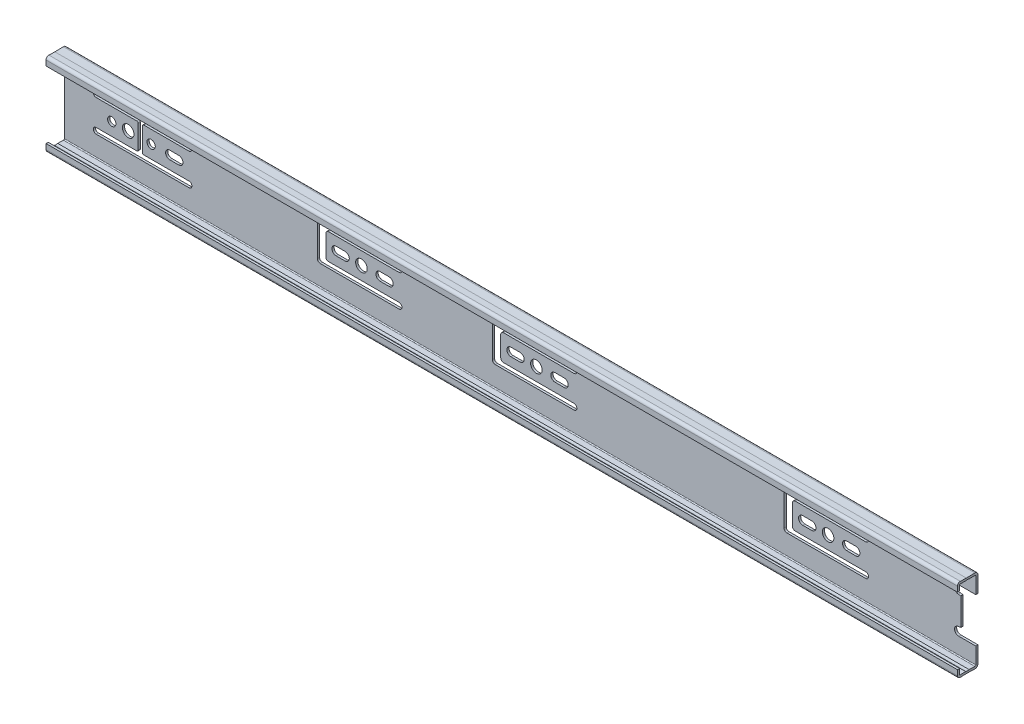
ISO-10303-21;
HEADER;
FILE_DESCRIPTION(('STEP AP214'),'2;1');
FILE_NAME('part.step','',(''),(''),'','','');
FILE_SCHEMA(('AUTOMOTIVE_DESIGN { 1 0 10303 214 1 1 1 1 }'));
ENDSEC;
DATA;
#1=APPLICATION_CONTEXT('core data for automotive mechanical design processes');
#2=APPLICATION_PROTOCOL_DEFINITION('international standard','automotive_design',2000,#1);
#3=PRODUCT_CONTEXT('',#1,'mechanical');
#4=PRODUCT('Part','Part','',(#3));
#5=PRODUCT_RELATED_PRODUCT_CATEGORY('part','',(#4));
#6=PRODUCT_DEFINITION_FORMATION('','',#4);
#7=PRODUCT_DEFINITION_CONTEXT('part definition',#1,'design');
#8=PRODUCT_DEFINITION('design','',#6,#7);
#9=PRODUCT_DEFINITION_SHAPE('','',#8);
#10=(LENGTH_UNIT() NAMED_UNIT(*) SI_UNIT(.MILLI.,.METRE.));
#11=(NAMED_UNIT(*) PLANE_ANGLE_UNIT() SI_UNIT($,.RADIAN.));
#12=(NAMED_UNIT(*) SI_UNIT($,.STERADIAN.) SOLID_ANGLE_UNIT());
#13=UNCERTAINTY_MEASURE_WITH_UNIT(LENGTH_MEASURE(1.E-05),#10,'distance_accuracy_value','');
#14=(GEOMETRIC_REPRESENTATION_CONTEXT(3) GLOBAL_UNCERTAINTY_ASSIGNED_CONTEXT((#13)) GLOBAL_UNIT_ASSIGNED_CONTEXT((#10,
#11,#12)) REPRESENTATION_CONTEXT('',''));
#15=CARTESIAN_POINT('',(0.,0.,0.));
#16=DIRECTION('',(0.,0.,1.));
#17=DIRECTION('',(1.,0.,0.));
#18=AXIS2_PLACEMENT_3D('',#15,#16,#17);
#19=CARTESIAN_POINT('',(250.063,21.1190956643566,-4.445));
#20=DIRECTION('',(0.,0.,-1.));
#21=DIRECTION('',(0.,1.,0.));
#22=AXIS2_PLACEMENT_3D('',#19,#20,#21);
#23=PLANE('',#22);
#24=CARTESIAN_POINT('',(168.985,0.,-4.445));
#25=DIRECTION('',(0.,0.,1.));
#26=DIRECTION('',(1.,0.,0.));
#27=AXIS2_PLACEMENT_3D('',#24,#25,#26);
#28=CIRCLE('',#27,3.17499999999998);
#29=CARTESIAN_POINT('',(172.16,0.,-4.445));
#30=VERTEX_POINT('',#29);
#31=EDGE_CURVE('E3995',#30,#30,#28,.T.);
#32=ORIENTED_EDGE('',*,*,#31,.F.);
#33=EDGE_LOOP('',(#32));
#34=FACE_BOUND('',#33,.T.);
#35=CARTESIAN_POINT('',(8.93699999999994,0.,-4.445));
#36=DIRECTION('',(0.,0.,1.));
#37=DIRECTION('',(1.,0.,0.));
#38=AXIS2_PLACEMENT_3D('',#35,#36,#37);
#39=CIRCLE('',#38,3.175);
#40=CARTESIAN_POINT('',(12.1119999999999,0.,-4.445));
#41=VERTEX_POINT('',#40);
#42=EDGE_CURVE('E3989',#41,#41,#39,.T.);
#43=ORIENTED_EDGE('',*,*,#42,.F.);
#44=EDGE_LOOP('',(#43));
#45=FACE_BOUND('',#44,.T.);
#46=CARTESIAN_POINT('',(-87.063,0.,-4.445));
#47=DIRECTION('',(0.,0.,1.));
#48=DIRECTION('',(1.,0.,0.));
#49=AXIS2_PLACEMENT_3D('',#46,#47,#48);
#50=CIRCLE('',#49,3.175);
#51=CARTESIAN_POINT('',(-83.888,0.,-4.445));
#52=VERTEX_POINT('',#51);
#53=EDGE_CURVE('E3983',#52,#52,#50,.T.);
#54=ORIENTED_EDGE('',*,*,#53,.F.);
#55=EDGE_LOOP('',(#54));
#56=FACE_BOUND('',#55,.T.);
#57=CARTESIAN_POINT('',(-215.063,0.,-4.445));
#58=DIRECTION('',(0.,0.,1.));
#59=DIRECTION('',(1.,0.,0.));
#60=AXIS2_PLACEMENT_3D('',#57,#58,#59);
#61=CIRCLE('',#60,3.17499999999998);
#62=CARTESIAN_POINT('',(-211.888,0.,-4.445));
#63=VERTEX_POINT('',#62);
#64=EDGE_CURVE('E3977',#63,#63,#61,.T.);
#65=ORIENTED_EDGE('',*,*,#64,.F.);
#66=EDGE_LOOP('',(#65));
#67=FACE_BOUND('',#66,.T.);
#68=CARTESIAN_POINT('',(-224.054599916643,0.,-4.445));
#69=DIRECTION('',(0.,0.,1.));
#70=DIRECTION('',(1.,0.,0.));
#71=AXIS2_PLACEMENT_3D('',#68,#69,#70);
#72=CIRCLE('',#71,2.28600000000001);
#73=CARTESIAN_POINT('',(-221.768599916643,0.,-4.445));
#74=VERTEX_POINT('',#73);
#75=EDGE_CURVE('E3971',#74,#74,#72,.T.);
#76=ORIENTED_EDGE('',*,*,#75,.F.);
#77=EDGE_LOOP('',(#76));
#78=FACE_BOUND('',#77,.T.);
#79=DIRECTION('',(0.,1.,0.));
#80=VECTOR('',#79,1.);
#81=CARTESIAN_POINT('',(-250.063,21.1190956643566,-4.445));
#82=LINE('',#81,#80);
#83=CARTESIAN_POINT('',(-250.063,-21.1190956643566,-4.445));
#84=VERTEX_POINT('',#83);
#85=CARTESIAN_POINT('',(-250.063,21.1190956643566,-4.445));
#86=VERTEX_POINT('',#85);
#87=EDGE_CURVE('E1398',#84,#86,#82,.T.);
#88=ORIENTED_EDGE('',*,*,#87,.F.);
#89=DIRECTION('',(-1.,0.,0.));
#90=VECTOR('',#89,1.);
#91=CARTESIAN_POINT('',(250.063,-21.1190956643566,-4.44500000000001));
#92=LINE('',#91,#90);
#93=CARTESIAN_POINT('',(250.063,-21.1190956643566,-4.44500000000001));
#94=VERTEX_POINT('',#93);
#95=EDGE_CURVE('E1125',#84,#94,#92,.F.);
#96=ORIENTED_EDGE('',*,*,#95,.T.);
#97=DIRECTION('',(0.,-1.,0.));
#98=VECTOR('',#97,1.);
#99=CARTESIAN_POINT('',(250.063,-21.6405722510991,-4.44500000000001));
#100=LINE('',#99,#98);
#101=CARTESIAN_POINT('',(250.063,-12.2047523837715,-4.445));
#102=VERTEX_POINT('',#101);
#103=EDGE_CURVE('E2930',#102,#94,#100,.T.);
#104=ORIENTED_EDGE('',*,*,#103,.F.);
#105=DIRECTION('',(-1.,0.,0.));
#106=VECTOR('',#105,1.);
#107=CARTESIAN_POINT('',(250.063,-12.2047523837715,-4.445));
#108=LINE('',#107,#106);
#109=CARTESIAN_POINT('',(240.666356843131,-12.2047523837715,-4.445));
#110=VERTEX_POINT('',#109);
#111=EDGE_CURVE('E2918',#102,#110,#108,.T.);
#112=ORIENTED_EDGE('',*,*,#111,.T.);
#113=CARTESIAN_POINT('',(240.666356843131,-9.91875238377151,-4.445));
#114=DIRECTION('',(0.,0.,1.));
#115=DIRECTION('',(1.,0.,0.));
#116=AXIS2_PLACEMENT_3D('',#113,#114,#115);
#117=CIRCLE('',#116,2.28600000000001);
#118=CARTESIAN_POINT('',(240.424533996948,-7.64557889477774,-4.445));
#119=VERTEX_POINT('',#118);
#120=EDGE_CURVE('E1394',#119,#110,#117,.T.);
#121=ORIENTED_EDGE('',*,*,#120,.F.);
#122=DIRECTION('',(-0.994389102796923,-0.105784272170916,0.));
#123=VECTOR('',#122,1.);
#124=CARTESIAN_POINT('',(240.424533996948,-7.64557889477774,-4.445));
#125=LINE('',#124,#123);
#126=CARTESIAN_POINT('',(241.8588,-7.49300000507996,-4.445));
#127=VERTEX_POINT('',#126);
#128=EDGE_CURVE('E1399',#127,#119,#125,.T.);
#129=ORIENTED_EDGE('',*,*,#128,.F.);
#130=DIRECTION('',(0.,-1.,0.));
#131=VECTOR('',#130,1.);
#132=CARTESIAN_POINT('',(241.8588,7.49300000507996,-4.445));
#133=LINE('',#132,#131);
#134=CARTESIAN_POINT('',(241.8588,7.49300000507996,-4.445));
#135=VERTEX_POINT('',#134);
#136=EDGE_CURVE('E1429',#135,#127,#133,.T.);
#137=ORIENTED_EDGE('',*,*,#136,.F.);
#138=DIRECTION('',(0.994389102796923,-0.105784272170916,0.));
#139=VECTOR('',#138,1.);
#140=CARTESIAN_POINT('',(240.424533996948,7.64557889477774,-4.445));
#141=LINE('',#140,#139);
#142=CARTESIAN_POINT('',(240.424533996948,7.64557889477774,-4.445));
#143=VERTEX_POINT('',#142);
#144=EDGE_CURVE('E1433',#143,#135,#141,.T.);
#145=ORIENTED_EDGE('',*,*,#144,.F.);
#146=CARTESIAN_POINT('',(240.666356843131,9.91875238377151,-4.445));
#147=DIRECTION('',(0.,0.,1.));
#148=DIRECTION('',(1.,0.,0.));
#149=AXIS2_PLACEMENT_3D('',#146,#147,#148);
#150=CIRCLE('',#149,2.28600000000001);
#151=CARTESIAN_POINT('',(240.666356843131,12.2047523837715,-4.445));
#152=VERTEX_POINT('',#151);
#153=EDGE_CURVE('E1447',#152,#143,#150,.T.);
#154=ORIENTED_EDGE('',*,*,#153,.F.);
#155=DIRECTION('',(-1.,0.,0.));
#156=VECTOR('',#155,1.);
#157=CARTESIAN_POINT('',(250.063,12.2047523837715,-4.445));
#158=LINE('',#157,#156);
#159=CARTESIAN_POINT('',(250.063,12.2047523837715,-4.445));
#160=VERTEX_POINT('',#159);
#161=EDGE_CURVE('E1594',#160,#152,#158,.T.);
#162=ORIENTED_EDGE('',*,*,#161,.F.);
#163=DIRECTION('',(0.,-1.,0.));
#164=VECTOR('',#163,1.);
#165=CARTESIAN_POINT('',(250.063,12.2047523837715,-4.445));
#166=LINE('',#165,#164);
#167=CARTESIAN_POINT('',(250.063,21.1190956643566,-4.445));
#168=VERTEX_POINT('',#167);
#169=EDGE_CURVE('E3536',#168,#160,#166,.T.);
#170=ORIENTED_EDGE('',*,*,#169,.F.);
#171=DIRECTION('',(-1.,0.,0.));
#172=VECTOR('',#171,1.);
#173=CARTESIAN_POINT('',(-250.063,21.1190956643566,-4.445));
#174=LINE('',#173,#172);
#175=EDGE_CURVE('E1122',#168,#86,#174,.T.);
#176=ORIENTED_EDGE('',*,*,#175,.T.);
#177=EDGE_LOOP('',(#88,#96,#104,#112,#121,#129,#137,#145,#154,#162,#170,#176));
#178=FACE_BOUND('',#177,.T.);
#179=DIRECTION('',(0.,-1.,0.));
#180=VECTOR('',#179,1.);
#181=CARTESIAN_POINT('',(-207.2652,21.1190956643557,-4.445));
#182=LINE('',#181,#180);
#183=CARTESIAN_POINT('',(-207.2652,6.3499999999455,-4.445));
#184=VERTEX_POINT('',#183);
#185=CARTESIAN_POINT('',(-207.2652,-6.3499999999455,-4.445));
#186=VERTEX_POINT('',#185);
#187=EDGE_CURVE('E3738',#184,#186,#182,.T.);
#188=ORIENTED_EDGE('',*,*,#187,.T.);
#189=CARTESIAN_POINT('',(-206.503199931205,-6.3499999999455,-4.445));
#190=DIRECTION('',(0.,0.,-1.));
#191=DIRECTION('',(0.,1.,0.));
#192=AXIS2_PLACEMENT_3D('',#189,#190,#191);
#193=CIRCLE('',#192,0.762000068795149);
#194=CARTESIAN_POINT('',(-206.503199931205,-7.11200006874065,-4.445));
#195=VERTEX_POINT('',#194);
#196=EDGE_CURVE('E1159',#186,#195,#193,.F.);
#197=ORIENTED_EDGE('',*,*,#196,.T.);
#198=DIRECTION('',(1.,0.,0.));
#199=VECTOR('',#198,1.);
#200=CARTESIAN_POINT('',(250.063,-7.11200006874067,-4.445));
#201=LINE('',#200,#199);
#202=CARTESIAN_POINT('',(-181.674699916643,-7.11200006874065,-4.445));
#203=VERTEX_POINT('',#202);
#204=EDGE_CURVE('E2983',#195,#203,#201,.T.);
#205=ORIENTED_EDGE('',*,*,#204,.T.);
#206=CARTESIAN_POINT('',(-181.674699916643,-8.69950006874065,-4.445));
#207=DIRECTION('',(0.,0.,-1.));
#208=DIRECTION('',(0.,1.,0.));
#209=AXIS2_PLACEMENT_3D('',#206,#207,#208);
#210=CIRCLE('',#209,1.5875);
#211=CARTESIAN_POINT('',(-181.674699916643,-10.2870000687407,-4.445));
#212=VERTEX_POINT('',#211);
#213=EDGE_CURVE('E1427',#203,#212,#210,.T.);
#214=ORIENTED_EDGE('',*,*,#213,.T.);
#215=DIRECTION('',(-1.,0.,0.));
#216=VECTOR('',#215,1.);
#217=CARTESIAN_POINT('',(250.063,-10.2870000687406,-4.445));
#218=LINE('',#217,#216);
#219=CARTESIAN_POINT('',(-232.601699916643,-10.2870000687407,-4.445));
#220=VERTEX_POINT('',#219);
#221=EDGE_CURVE('E1422',#212,#220,#218,.T.);
#222=ORIENTED_EDGE('',*,*,#221,.T.);
#223=CARTESIAN_POINT('',(-232.601699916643,-8.69950006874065,-4.445));
#224=DIRECTION('',(0.,0.,-1.));
#225=DIRECTION('',(0.,1.,0.));
#226=AXIS2_PLACEMENT_3D('',#223,#224,#225);
#227=CIRCLE('',#226,1.5875);
#228=CARTESIAN_POINT('',(-232.601699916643,-7.11200006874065,-4.445));
#229=VERTEX_POINT('',#228);
#230=EDGE_CURVE('E1426',#220,#229,#227,.T.);
#231=ORIENTED_EDGE('',*,*,#230,.T.);
#232=DIRECTION('',(1.,0.,0.));
#233=VECTOR('',#232,1.);
#234=CARTESIAN_POINT('',(250.063,-7.11200006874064,-4.445));
#235=LINE('',#234,#233);
#236=CARTESIAN_POINT('',(-210.313200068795,-7.11200006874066,-4.445));
#237=VERTEX_POINT('',#236);
#238=EDGE_CURVE('E3758',#229,#237,#235,.T.);
#239=ORIENTED_EDGE('',*,*,#238,.T.);
#240=CARTESIAN_POINT('',(-210.313200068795,-6.3499999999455,-4.445));
#241=DIRECTION('',(0.,0.,-1.));
#242=DIRECTION('',(0.,1.,0.));
#243=AXIS2_PLACEMENT_3D('',#240,#241,#242);
#244=CIRCLE('',#243,0.762000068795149);
#245=CARTESIAN_POINT('',(-209.5512,-6.3499999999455,-4.445));
#246=VERTEX_POINT('',#245);
#247=EDGE_CURVE('E1157',#237,#246,#244,.F.);
#248=ORIENTED_EDGE('',*,*,#247,.T.);
#249=DIRECTION('',(0.,1.,0.));
#250=VECTOR('',#249,1.);
#251=CARTESIAN_POINT('',(-209.5512,21.1190956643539,-4.445));
#252=LINE('',#251,#250);
#253=CARTESIAN_POINT('',(-209.5512,6.34999999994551,-4.445));
#254=VERTEX_POINT('',#253);
#255=EDGE_CURVE('E3755',#246,#254,#252,.T.);
#256=ORIENTED_EDGE('',*,*,#255,.T.);
#257=CARTESIAN_POINT('',(-210.313200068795,6.3499999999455,-4.445));
#258=DIRECTION('',(0.,0.,-1.));
#259=DIRECTION('',(0.,1.,0.));
#260=AXIS2_PLACEMENT_3D('',#257,#258,#259);
#261=CIRCLE('',#260,0.762000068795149);
#262=CARTESIAN_POINT('',(-210.313200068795,7.11200006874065,-4.445));
#263=VERTEX_POINT('',#262);
#264=EDGE_CURVE('E1153',#254,#263,#261,.F.);
#265=ORIENTED_EDGE('',*,*,#264,.T.);
#266=DIRECTION('',(-1.,0.,0.));
#267=VECTOR('',#266,1.);
#268=CARTESIAN_POINT('',(250.063,7.11200006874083,-4.445));
#269=LINE('',#268,#267);
#270=CARTESIAN_POINT('',(-232.601699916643,7.11200006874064,-4.445));
#271=VERTEX_POINT('',#270);
#272=EDGE_CURVE('E3753',#263,#271,#269,.T.);
#273=ORIENTED_EDGE('',*,*,#272,.T.);
#274=CARTESIAN_POINT('',(-232.601699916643,8.69950006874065,-4.445));
#275=DIRECTION('',(0.,0.,-1.));
#276=DIRECTION('',(0.,1.,0.));
#277=AXIS2_PLACEMENT_3D('',#274,#275,#276);
#278=CIRCLE('',#277,1.5875);
#279=CARTESIAN_POINT('',(-232.601699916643,10.2870000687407,-4.445));
#280=VERTEX_POINT('',#279);
#281=EDGE_CURVE('E3750',#271,#280,#278,.T.);
#282=ORIENTED_EDGE('',*,*,#281,.T.);
#283=DIRECTION('',(1.,0.,0.));
#284=VECTOR('',#283,1.);
#285=CARTESIAN_POINT('',(250.063,10.2870000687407,-4.445));
#286=LINE('',#285,#284);
#287=CARTESIAN_POINT('',(-181.674699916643,10.2870000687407,-4.445));
#288=VERTEX_POINT('',#287);
#289=EDGE_CURVE('E3747',#280,#288,#286,.T.);
#290=ORIENTED_EDGE('',*,*,#289,.T.);
#291=CARTESIAN_POINT('',(-181.674699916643,8.69950006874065,-4.445));
#292=DIRECTION('',(0.,0.,-1.));
#293=DIRECTION('',(0.,1.,0.));
#294=AXIS2_PLACEMENT_3D('',#291,#292,#293);
#295=CIRCLE('',#294,1.5875);
#296=CARTESIAN_POINT('',(-181.674699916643,7.11200006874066,-4.445));
#297=VERTEX_POINT('',#296);
#298=EDGE_CURVE('E3744',#288,#297,#295,.T.);
#299=ORIENTED_EDGE('',*,*,#298,.T.);
#300=DIRECTION('',(-1.,0.,0.));
#301=VECTOR('',#300,1.);
#302=CARTESIAN_POINT('',(250.063,7.11200006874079,-4.445));
#303=LINE('',#302,#301);
#304=CARTESIAN_POINT('',(-206.503199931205,7.11200006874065,-4.445));
#305=VERTEX_POINT('',#304);
#306=EDGE_CURVE('E3741',#297,#305,#303,.T.);
#307=ORIENTED_EDGE('',*,*,#306,.T.);
#308=CARTESIAN_POINT('',(-206.503199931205,6.3499999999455,-4.445));
#309=DIRECTION('',(0.,0.,-1.));
#310=DIRECTION('',(0.,1.,0.));
#311=AXIS2_PLACEMENT_3D('',#308,#309,#310);
#312=CIRCLE('',#311,0.762000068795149);
#313=EDGE_CURVE('E1155',#305,#184,#312,.F.);
#314=ORIENTED_EDGE('',*,*,#313,.T.);
#315=EDGE_LOOP('',(#188,#197,#205,#214,#222,#231,#239,#248,#256,#265,#273,#282,#290,#299,#307,#314));
#316=FACE_BOUND('',#315,.T.);
#317=DIRECTION('',(0.,-1.,0.));
#318=VECTOR('',#317,1.);
#319=CARTESIAN_POINT('',(-106.621,21.1190956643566,-4.445));
#320=LINE('',#319,#318);
#321=CARTESIAN_POINT('',(-106.621,5.58800006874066,-4.445));
#322=VERTEX_POINT('',#321);
#323=CARTESIAN_POINT('',(-106.621,-5.58800006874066,-4.445));
#324=VERTEX_POINT('',#323);
#325=EDGE_CURVE('E3721',#322,#324,#320,.T.);
#326=ORIENTED_EDGE('',*,*,#325,.T.);
#327=CARTESIAN_POINT('',(-105.097,-5.58800006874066,-4.445));
#328=DIRECTION('',(0.,0.,-1.));
#329=DIRECTION('',(0.,1.,0.));
#330=AXIS2_PLACEMENT_3D('',#327,#328,#329);
#331=CIRCLE('',#330,1.52399999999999);
#332=CARTESIAN_POINT('',(-105.097,-7.11200006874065,-4.445));
#333=VERTEX_POINT('',#332);
#334=EDGE_CURVE('E1200',#324,#333,#331,.F.);
#335=ORIENTED_EDGE('',*,*,#334,.T.);
#336=DIRECTION('',(1.,0.,0.));
#337=VECTOR('',#336,1.);
#338=CARTESIAN_POINT('',(250.063,-7.11200006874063,-4.445));
#339=LINE('',#338,#337);
#340=CARTESIAN_POINT('',(-66.4255,-7.11200006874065,-4.445));
#341=VERTEX_POINT('',#340);
#342=EDGE_CURVE('E3736',#333,#341,#339,.T.);
#343=ORIENTED_EDGE('',*,*,#342,.T.);
#344=CARTESIAN_POINT('',(-66.4255,-8.69950006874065,-4.445));
#345=DIRECTION('',(0.,0.,-1.));
#346=DIRECTION('',(0.,1.,0.));
#347=AXIS2_PLACEMENT_3D('',#344,#345,#346);
#348=CIRCLE('',#347,1.5875);
#349=CARTESIAN_POINT('',(-66.4255,-10.2870000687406,-4.445));
#350=VERTEX_POINT('',#349);
#351=EDGE_CURVE('E3733',#341,#350,#348,.T.);
#352=ORIENTED_EDGE('',*,*,#351,.T.);
#353=DIRECTION('',(-1.,0.,0.));
#354=VECTOR('',#353,1.);
#355=CARTESIAN_POINT('',(250.063,-10.2870000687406,-4.445));
#356=LINE('',#355,#354);
#357=CARTESIAN_POINT('',(-109.669,-10.2870000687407,-4.445));
#358=VERTEX_POINT('',#357);
#359=EDGE_CURVE('E3730',#350,#358,#356,.T.);
#360=ORIENTED_EDGE('',*,*,#359,.T.);
#361=CARTESIAN_POINT('',(-109.669,-8.76300006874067,-4.445));
#362=DIRECTION('',(0.,0.,-1.));
#363=DIRECTION('',(0.,1.,0.));
#364=AXIS2_PLACEMENT_3D('',#361,#362,#363);
#365=CIRCLE('',#364,1.52399999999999);
#366=CARTESIAN_POINT('',(-111.193,-8.76300006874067,-4.445));
#367=VERTEX_POINT('',#366);
#368=EDGE_CURVE('E1291',#358,#367,#365,.T.);
#369=ORIENTED_EDGE('',*,*,#368,.T.);
#370=DIRECTION('',(0.,1.,0.));
#371=VECTOR('',#370,1.);
#372=CARTESIAN_POINT('',(-111.193,21.1190956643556,-4.445));
#373=LINE('',#372,#371);
#374=CARTESIAN_POINT('',(-111.193,8.76300006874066,-4.445));
#375=VERTEX_POINT('',#374);
#376=EDGE_CURVE('E3727',#367,#375,#373,.T.);
#377=ORIENTED_EDGE('',*,*,#376,.T.);
#378=CARTESIAN_POINT('',(-109.669,8.76300006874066,-4.445));
#379=DIRECTION('',(0.,0.,-1.));
#380=DIRECTION('',(0.,1.,0.));
#381=AXIS2_PLACEMENT_3D('',#378,#379,#380);
#382=CIRCLE('',#381,1.52399999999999);
#383=CARTESIAN_POINT('',(-109.669,10.2870000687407,-4.445));
#384=VERTEX_POINT('',#383);
#385=EDGE_CURVE('E1283',#375,#384,#382,.T.);
#386=ORIENTED_EDGE('',*,*,#385,.T.);
#387=DIRECTION('',(1.,0.,0.));
#388=VECTOR('',#387,1.);
#389=CARTESIAN_POINT('',(250.063,10.2870000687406,-4.445));
#390=LINE('',#389,#388);
#391=CARTESIAN_POINT('',(-66.4255,10.2870000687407,-4.445));
#392=VERTEX_POINT('',#391);
#393=EDGE_CURVE('E1377',#384,#392,#390,.T.);
#394=ORIENTED_EDGE('',*,*,#393,.T.);
#395=CARTESIAN_POINT('',(-66.4255,8.69950006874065,-4.445));
#396=DIRECTION('',(0.,0.,-1.));
#397=DIRECTION('',(0.,1.,0.));
#398=AXIS2_PLACEMENT_3D('',#395,#396,#397);
#399=CIRCLE('',#398,1.5875);
#400=CARTESIAN_POINT('',(-66.4255,7.11200006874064,-4.445));
#401=VERTEX_POINT('',#400);
#402=EDGE_CURVE('E1372',#392,#401,#399,.T.);
#403=ORIENTED_EDGE('',*,*,#402,.T.);
#404=DIRECTION('',(-1.,0.,0.));
#405=VECTOR('',#404,1.);
#406=CARTESIAN_POINT('',(250.063,7.11200006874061,-4.445));
#407=LINE('',#406,#405);
#408=CARTESIAN_POINT('',(-105.097,7.11200006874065,-4.445));
#409=VERTEX_POINT('',#408);
#410=EDGE_CURVE('E1376',#401,#409,#407,.T.);
#411=ORIENTED_EDGE('',*,*,#410,.T.);
#412=CARTESIAN_POINT('',(-105.097,5.58800006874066,-4.445));
#413=DIRECTION('',(0.,0.,-1.));
#414=DIRECTION('',(0.,1.,0.));
#415=AXIS2_PLACEMENT_3D('',#412,#413,#414);
#416=CIRCLE('',#415,1.52399999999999);
#417=EDGE_CURVE('E1194',#409,#322,#416,.F.);
#418=ORIENTED_EDGE('',*,*,#417,.T.);
#419=EDGE_LOOP('',(#326,#335,#343,#352,#360,#369,#377,#386,#394,#403,#411,#418));
#420=FACE_BOUND('',#419,.T.);
#421=DIRECTION('',(1.,0.,0.));
#422=VECTOR('',#421,1.);
#423=CARTESIAN_POINT('',(250.063,2.28599999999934,-4.445));
#424=LINE('',#423,#422);
#425=CARTESIAN_POINT('',(-192.241099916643,2.286,-4.445));
#426=VERTEX_POINT('',#425);
#427=CARTESIAN_POINT('',(-187.288099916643,2.286,-4.445));
#428=VERTEX_POINT('',#427);
#429=EDGE_CURVE('E3712',#426,#428,#424,.T.);
#430=ORIENTED_EDGE('',*,*,#429,.T.);
#431=CARTESIAN_POINT('',(-187.288099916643,0.,-4.445));
#432=DIRECTION('',(0.,0.,-1.));
#433=DIRECTION('',(0.,1.,0.));
#434=AXIS2_PLACEMENT_3D('',#431,#432,#433);
#435=CIRCLE('',#434,2.286);
#436=CARTESIAN_POINT('',(-187.288099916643,-2.286,-4.445));
#437=VERTEX_POINT('',#436);
#438=EDGE_CURVE('E3709',#428,#437,#435,.T.);
#439=ORIENTED_EDGE('',*,*,#438,.T.);
#440=DIRECTION('',(-1.,0.,0.));
#441=VECTOR('',#440,1.);
#442=CARTESIAN_POINT('',(250.063,-2.28600000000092,-4.445));
#443=LINE('',#442,#441);
#444=CARTESIAN_POINT('',(-192.241099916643,-2.28599999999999,-4.445));
#445=VERTEX_POINT('',#444);
#446=EDGE_CURVE('E3718',#437,#445,#443,.T.);
#447=ORIENTED_EDGE('',*,*,#446,.T.);
#448=CARTESIAN_POINT('',(-192.241099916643,0.,-4.445));
#449=DIRECTION('',(0.,0.,-1.));
#450=DIRECTION('',(0.,1.,0.));
#451=AXIS2_PLACEMENT_3D('',#448,#449,#450);
#452=CIRCLE('',#451,2.286);
#453=EDGE_CURVE('E3715',#445,#426,#452,.T.);
#454=ORIENTED_EDGE('',*,*,#453,.T.);
#455=EDGE_LOOP('',(#430,#439,#447,#454));
#456=FACE_BOUND('',#455,.T.);
#457=DIRECTION('',(-1.,0.,0.));
#458=VECTOR('',#457,1.);
#459=CARTESIAN_POINT('',(250.063,7.11200006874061,-4.445));
#460=LINE('',#459,#458);
#461=CARTESIAN_POINT('',(29.5744999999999,7.11200006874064,-4.445));
#462=VERTEX_POINT('',#461);
#463=CARTESIAN_POINT('',(-9.09700000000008,7.11200006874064,-4.445));
#464=VERTEX_POINT('',#463);
#465=EDGE_CURVE('E3690',#462,#464,#460,.T.);
#466=ORIENTED_EDGE('',*,*,#465,.T.);
#467=CARTESIAN_POINT('',(-9.09700000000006,5.58800006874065,-4.445));
#468=DIRECTION('',(0.,0.,-1.));
#469=DIRECTION('',(0.,1.,0.));
#470=AXIS2_PLACEMENT_3D('',#467,#468,#469);
#471=CIRCLE('',#470,1.52399999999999);
#472=CARTESIAN_POINT('',(-10.621,5.58800006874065,-4.445));
#473=VERTEX_POINT('',#472);
#474=EDGE_CURVE('E1202',#464,#473,#471,.F.);
#475=ORIENTED_EDGE('',*,*,#474,.T.);
#476=DIRECTION('',(0.,-1.,0.));
#477=VECTOR('',#476,1.);
#478=CARTESIAN_POINT('',(-10.621,21.1190956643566,-4.445));
#479=LINE('',#478,#477);
#480=CARTESIAN_POINT('',(-10.621,-5.58800006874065,-4.445));
#481=VERTEX_POINT('',#480);
#482=EDGE_CURVE('E3687',#473,#481,#479,.T.);
#483=ORIENTED_EDGE('',*,*,#482,.T.);
#484=CARTESIAN_POINT('',(-9.09700000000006,-5.58800006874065,-4.445));
#485=DIRECTION('',(0.,0.,-1.));
#486=DIRECTION('',(0.,1.,0.));
#487=AXIS2_PLACEMENT_3D('',#484,#485,#486);
#488=CIRCLE('',#487,1.52399999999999);
#489=CARTESIAN_POINT('',(-9.09700000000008,-7.11200006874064,-4.445));
#490=VERTEX_POINT('',#489);
#491=EDGE_CURVE('E1196',#481,#490,#488,.F.);
#492=ORIENTED_EDGE('',*,*,#491,.T.);
#493=DIRECTION('',(1.,0.,0.));
#494=VECTOR('',#493,1.);
#495=CARTESIAN_POINT('',(250.063,-7.11200006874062,-4.445));
#496=LINE('',#495,#494);
#497=CARTESIAN_POINT('',(29.5744999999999,-7.11200006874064,-4.445));
#498=VERTEX_POINT('',#497);
#499=EDGE_CURVE('E3707',#490,#498,#496,.T.);
#500=ORIENTED_EDGE('',*,*,#499,.T.);
#501=CARTESIAN_POINT('',(29.5744999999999,-8.69950006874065,-4.445));
#502=DIRECTION('',(0.,0.,-1.));
#503=DIRECTION('',(0.,1.,0.));
#504=AXIS2_PLACEMENT_3D('',#501,#502,#503);
#505=CIRCLE('',#504,1.58750000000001);
#506=CARTESIAN_POINT('',(29.5744999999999,-10.2870000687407,-4.445));
#507=VERTEX_POINT('',#506);
#508=EDGE_CURVE('E3704',#498,#507,#505,.T.);
#509=ORIENTED_EDGE('',*,*,#508,.T.);
#510=DIRECTION('',(-1.,0.,0.));
#511=VECTOR('',#510,1.);
#512=CARTESIAN_POINT('',(250.063,-10.2870000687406,-4.445));
#513=LINE('',#512,#511);
#514=CARTESIAN_POINT('',(-13.6690000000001,-10.2870000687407,-4.445));
#515=VERTEX_POINT('',#514);
#516=EDGE_CURVE('E3701',#507,#515,#513,.T.);
#517=ORIENTED_EDGE('',*,*,#516,.T.);
#518=CARTESIAN_POINT('',(-13.6690000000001,-8.76300006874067,-4.445));
#519=DIRECTION('',(0.,0.,-1.));
#520=DIRECTION('',(0.,1.,0.));
#521=AXIS2_PLACEMENT_3D('',#518,#519,#520);
#522=CIRCLE('',#521,1.52399999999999);
#523=CARTESIAN_POINT('',(-15.1930000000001,-8.76300006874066,-4.445));
#524=VERTEX_POINT('',#523);
#525=EDGE_CURVE('E1287',#515,#524,#522,.T.);
#526=ORIENTED_EDGE('',*,*,#525,.T.);
#527=DIRECTION('',(0.,1.,0.));
#528=VECTOR('',#527,1.);
#529=CARTESIAN_POINT('',(-15.193,21.1190956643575,-4.445));
#530=LINE('',#529,#528);
#531=CARTESIAN_POINT('',(-15.193,8.76300006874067,-4.445));
#532=VERTEX_POINT('',#531);
#533=EDGE_CURVE('E3698',#524,#532,#530,.T.);
#534=ORIENTED_EDGE('',*,*,#533,.T.);
#535=CARTESIAN_POINT('',(-13.669,8.76300006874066,-4.445));
#536=DIRECTION('',(0.,0.,-1.));
#537=DIRECTION('',(0.,1.,0.));
#538=AXIS2_PLACEMENT_3D('',#535,#536,#537);
#539=CIRCLE('',#538,1.52399999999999);
#540=CARTESIAN_POINT('',(-13.669,10.2870000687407,-4.445));
#541=VERTEX_POINT('',#540);
#542=EDGE_CURVE('E1304',#532,#541,#539,.T.);
#543=ORIENTED_EDGE('',*,*,#542,.T.);
#544=DIRECTION('',(1.,0.,0.));
#545=VECTOR('',#544,1.);
#546=CARTESIAN_POINT('',(250.063,10.2870000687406,-4.445));
#547=LINE('',#546,#545);
#548=CARTESIAN_POINT('',(29.5744999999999,10.2870000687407,-4.445));
#549=VERTEX_POINT('',#548);
#550=EDGE_CURVE('E3696',#541,#549,#547,.T.);
#551=ORIENTED_EDGE('',*,*,#550,.T.);
#552=CARTESIAN_POINT('',(29.5744999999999,8.69950006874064,-4.445));
#553=DIRECTION('',(0.,0.,-1.));
#554=DIRECTION('',(0.,1.,0.));
#555=AXIS2_PLACEMENT_3D('',#552,#553,#554);
#556=CIRCLE('',#555,1.58750000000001);
#557=EDGE_CURVE('E3693',#549,#462,#556,.T.);
#558=ORIENTED_EDGE('',*,*,#557,.T.);
#559=EDGE_LOOP('',(#466,#475,#483,#492,#500,#509,#517,#526,#534,#543,#551,#558));
#560=FACE_BOUND('',#559,.T.);
#561=DIRECTION('',(1.,0.,0.));
#562=VECTOR('',#561,1.);
#563=CARTESIAN_POINT('',(250.063,2.28599999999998,-4.445));
#564=LINE('',#563,#562);
#565=CARTESIAN_POINT('',(-100.9695,2.28600000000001,-4.445));
#566=VERTEX_POINT('',#565);
#567=CARTESIAN_POINT('',(-96.0165000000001,2.28600000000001,-4.445));
#568=VERTEX_POINT('',#567);
#569=EDGE_CURVE('E3678',#566,#568,#564,.T.);
#570=ORIENTED_EDGE('',*,*,#569,.T.);
#571=CARTESIAN_POINT('',(-96.0165000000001,0.,-4.445));
#572=DIRECTION('',(0.,0.,-1.));
#573=DIRECTION('',(0.,1.,0.));
#574=AXIS2_PLACEMENT_3D('',#571,#572,#573);
#575=CIRCLE('',#574,2.28600000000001);
#576=CARTESIAN_POINT('',(-96.0165000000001,-2.28600000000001,-4.445));
#577=VERTEX_POINT('',#576);
#578=EDGE_CURVE('E3675',#568,#577,#575,.T.);
#579=ORIENTED_EDGE('',*,*,#578,.T.);
#580=DIRECTION('',(-1.,0.,0.));
#581=VECTOR('',#580,1.);
#582=CARTESIAN_POINT('',(250.063,-2.28600000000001,-4.445));
#583=LINE('',#582,#581);
#584=CARTESIAN_POINT('',(-100.9695,-2.28600000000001,-4.445));
#585=VERTEX_POINT('',#584);
#586=EDGE_CURVE('E3684',#577,#585,#583,.T.);
#587=ORIENTED_EDGE('',*,*,#586,.T.);
#588=CARTESIAN_POINT('',(-100.9695,0.,-4.445));
#589=DIRECTION('',(0.,0.,-1.));
#590=DIRECTION('',(0.,1.,0.));
#591=AXIS2_PLACEMENT_3D('',#588,#589,#590);
#592=CIRCLE('',#591,2.28600000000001);
#593=EDGE_CURVE('E3681',#585,#566,#592,.T.);
#594=ORIENTED_EDGE('',*,*,#593,.T.);
#595=EDGE_LOOP('',(#570,#579,#587,#594));
#596=FACE_BOUND('',#595,.T.);
#597=DIRECTION('',(1.,0.,0.));
#598=VECTOR('',#597,1.);
#599=CARTESIAN_POINT('',(250.063,2.28600000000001,-4.445));
#600=LINE('',#599,#598);
#601=CARTESIAN_POINT('',(-76.8395,2.28600000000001,-4.445));
#602=VERTEX_POINT('',#601);
#603=CARTESIAN_POINT('',(-71.8865,2.28600000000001,-4.445));
#604=VERTEX_POINT('',#603);
#605=EDGE_CURVE('E3666',#602,#604,#600,.T.);
#606=ORIENTED_EDGE('',*,*,#605,.T.);
#607=CARTESIAN_POINT('',(-71.8865,0.,-4.445));
#608=DIRECTION('',(0.,0.,-1.));
#609=DIRECTION('',(0.,1.,0.));
#610=AXIS2_PLACEMENT_3D('',#607,#608,#609);
#611=CIRCLE('',#610,2.28600000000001);
#612=CARTESIAN_POINT('',(-71.8865,-2.28600000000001,-4.445));
#613=VERTEX_POINT('',#612);
#614=EDGE_CURVE('E3663',#604,#613,#611,.T.);
#615=ORIENTED_EDGE('',*,*,#614,.T.);
#616=DIRECTION('',(-1.,0.,0.));
#617=VECTOR('',#616,1.);
#618=CARTESIAN_POINT('',(250.063,-2.28600000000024,-4.445));
#619=LINE('',#618,#617);
#620=CARTESIAN_POINT('',(-76.8395,-2.28600000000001,-4.445));
#621=VERTEX_POINT('',#620);
#622=EDGE_CURVE('E3672',#613,#621,#619,.T.);
#623=ORIENTED_EDGE('',*,*,#622,.T.);
#624=CARTESIAN_POINT('',(-76.8395,0.,-4.445));
#625=DIRECTION('',(0.,0.,-1.));
#626=DIRECTION('',(0.,1.,0.));
#627=AXIS2_PLACEMENT_3D('',#624,#625,#626);
#628=CIRCLE('',#627,2.28600000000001);
#629=EDGE_CURVE('E3669',#621,#602,#628,.T.);
#630=ORIENTED_EDGE('',*,*,#629,.T.);
#631=EDGE_LOOP('',(#606,#615,#623,#630));
#632=FACE_BOUND('',#631,.T.);
#633=DIRECTION('',(0.,-1.,0.));
#634=VECTOR('',#633,1.);
#635=CARTESIAN_POINT('',(149.427,21.1190956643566,-4.445));
#636=LINE('',#635,#634);
#637=CARTESIAN_POINT('',(149.427,5.58800006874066,-4.445));
#638=VERTEX_POINT('',#637);
#639=CARTESIAN_POINT('',(149.427,-5.58800006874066,-4.445));
#640=VERTEX_POINT('',#639);
#641=EDGE_CURVE('E3641',#638,#640,#636,.T.);
#642=ORIENTED_EDGE('',*,*,#641,.T.);
#643=CARTESIAN_POINT('',(150.951,-5.58800006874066,-4.445));
#644=DIRECTION('',(0.,0.,-1.));
#645=DIRECTION('',(0.,1.,0.));
#646=AXIS2_PLACEMENT_3D('',#643,#644,#645);
#647=CIRCLE('',#646,1.52399999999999);
#648=CARTESIAN_POINT('',(150.951,-7.11200006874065,-4.445));
#649=VERTEX_POINT('',#648);
#650=EDGE_CURVE('E1198',#640,#649,#647,.F.);
#651=ORIENTED_EDGE('',*,*,#650,.T.);
#652=DIRECTION('',(1.,0.,0.));
#653=VECTOR('',#652,1.);
#654=CARTESIAN_POINT('',(250.063,-7.11200006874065,-4.445));
#655=LINE('',#654,#653);
#656=CARTESIAN_POINT('',(189.6225,-7.11200006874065,-4.445));
#657=VERTEX_POINT('',#656);
#658=EDGE_CURVE('E3661',#649,#657,#655,.T.);
#659=ORIENTED_EDGE('',*,*,#658,.T.);
#660=CARTESIAN_POINT('',(189.6225,-8.69950006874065,-4.445));
#661=DIRECTION('',(0.,0.,-1.));
#662=DIRECTION('',(0.,1.,0.));
#663=AXIS2_PLACEMENT_3D('',#660,#661,#662);
#664=CIRCLE('',#663,1.5875);
#665=CARTESIAN_POINT('',(189.6225,-10.2870000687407,-4.445));
#666=VERTEX_POINT('',#665);
#667=EDGE_CURVE('E3658',#657,#666,#664,.T.);
#668=ORIENTED_EDGE('',*,*,#667,.T.);
#669=DIRECTION('',(-1.,0.,0.));
#670=VECTOR('',#669,1.);
#671=CARTESIAN_POINT('',(250.063,-10.2870000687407,-4.445));
#672=LINE('',#671,#670);
#673=CARTESIAN_POINT('',(146.379,-10.2870000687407,-4.445));
#674=VERTEX_POINT('',#673);
#675=EDGE_CURVE('E3655',#666,#674,#672,.T.);
#676=ORIENTED_EDGE('',*,*,#675,.T.);
#677=CARTESIAN_POINT('',(146.379,-8.76300006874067,-4.445));
#678=DIRECTION('',(0.,0.,-1.));
#679=DIRECTION('',(0.,1.,0.));
#680=AXIS2_PLACEMENT_3D('',#677,#678,#679);
#681=CIRCLE('',#680,1.52399999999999);
#682=CARTESIAN_POINT('',(144.855,-8.76300006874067,-4.445));
#683=VERTEX_POINT('',#682);
#684=EDGE_CURVE('E1300',#674,#683,#681,.T.);
#685=ORIENTED_EDGE('',*,*,#684,.T.);
#686=DIRECTION('',(0.,1.,0.));
#687=VECTOR('',#686,1.);
#688=CARTESIAN_POINT('',(144.855,21.1190956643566,-4.445));
#689=LINE('',#688,#687);
#690=CARTESIAN_POINT('',(144.855,8.76300006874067,-4.445));
#691=VERTEX_POINT('',#690);
#692=EDGE_CURVE('E3652',#683,#691,#689,.T.);
#693=ORIENTED_EDGE('',*,*,#692,.T.);
#694=CARTESIAN_POINT('',(146.379,8.76300006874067,-4.445));
#695=DIRECTION('',(0.,0.,-1.));
#696=DIRECTION('',(0.,1.,0.));
#697=AXIS2_PLACEMENT_3D('',#694,#695,#696);
#698=CIRCLE('',#697,1.52399999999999);
#699=CARTESIAN_POINT('',(146.379,10.2870000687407,-4.445));
#700=VERTEX_POINT('',#699);
#701=EDGE_CURVE('E1295',#691,#700,#698,.T.);
#702=ORIENTED_EDGE('',*,*,#701,.T.);
#703=DIRECTION('',(1.,0.,0.));
#704=VECTOR('',#703,1.);
#705=CARTESIAN_POINT('',(250.063,10.2870000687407,-4.445));
#706=LINE('',#705,#704);
#707=CARTESIAN_POINT('',(189.6225,10.2870000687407,-4.445));
#708=VERTEX_POINT('',#707);
#709=EDGE_CURVE('E3650',#700,#708,#706,.T.);
#710=ORIENTED_EDGE('',*,*,#709,.T.);
#711=CARTESIAN_POINT('',(189.6225,8.69950006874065,-4.445));
#712=DIRECTION('',(0.,0.,-1.));
#713=DIRECTION('',(0.,1.,0.));
#714=AXIS2_PLACEMENT_3D('',#711,#712,#713);
#715=CIRCLE('',#714,1.58750000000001);
#716=CARTESIAN_POINT('',(189.6225,7.11200006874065,-4.445));
#717=VERTEX_POINT('',#716);
#718=EDGE_CURVE('E3647',#708,#717,#715,.T.);
#719=ORIENTED_EDGE('',*,*,#718,.T.);
#720=DIRECTION('',(-1.,0.,0.));
#721=VECTOR('',#720,1.);
#722=CARTESIAN_POINT('',(250.063,7.11200006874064,-4.445));
#723=LINE('',#722,#721);
#724=CARTESIAN_POINT('',(150.951,7.11200006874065,-4.445));
#725=VERTEX_POINT('',#724);
#726=EDGE_CURVE('E3644',#717,#725,#723,.T.);
#727=ORIENTED_EDGE('',*,*,#726,.T.);
#728=CARTESIAN_POINT('',(150.951,5.58800006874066,-4.445));
#729=DIRECTION('',(0.,0.,-1.));
#730=DIRECTION('',(0.,1.,0.));
#731=AXIS2_PLACEMENT_3D('',#728,#729,#730);
#732=CIRCLE('',#731,1.52399999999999);
#733=EDGE_CURVE('E1192',#725,#638,#732,.F.);
#734=ORIENTED_EDGE('',*,*,#733,.T.);
#735=EDGE_LOOP('',(#642,#651,#659,#668,#676,#685,#693,#702,#710,#719,#727,#734));
#736=FACE_BOUND('',#735,.T.);
#737=DIRECTION('',(1.,0.,0.));
#738=VECTOR('',#737,1.);
#739=CARTESIAN_POINT('',(250.063,2.28599999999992,-4.445));
#740=LINE('',#739,#738);
#741=CARTESIAN_POINT('',(-4.96950000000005,2.28600000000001,-4.445));
#742=VERTEX_POINT('',#741);
#743=CARTESIAN_POINT('',(-0.0165000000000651,2.28600000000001,-4.445));
#744=VERTEX_POINT('',#743);
#745=EDGE_CURVE('E3632',#742,#744,#740,.T.);
#746=ORIENTED_EDGE('',*,*,#745,.T.);
#747=CARTESIAN_POINT('',(-0.0165000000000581,0.,-4.445));
#748=DIRECTION('',(0.,0.,-1.));
#749=DIRECTION('',(0.,1.,0.));
#750=AXIS2_PLACEMENT_3D('',#747,#748,#749);
#751=CIRCLE('',#750,2.28600000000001);
#752=CARTESIAN_POINT('',(-0.0165000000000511,-2.28600000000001,-4.445));
#753=VERTEX_POINT('',#752);
#754=EDGE_CURVE('E3629',#744,#753,#751,.T.);
#755=ORIENTED_EDGE('',*,*,#754,.T.);
#756=DIRECTION('',(-1.,0.,0.));
#757=VECTOR('',#756,1.);
#758=CARTESIAN_POINT('',(250.063,-2.28600000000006,-4.445));
#759=LINE('',#758,#757);
#760=CARTESIAN_POINT('',(-4.96950000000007,-2.28600000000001,-4.445));
#761=VERTEX_POINT('',#760);
#762=EDGE_CURVE('E3638',#753,#761,#759,.T.);
#763=ORIENTED_EDGE('',*,*,#762,.T.);
#764=CARTESIAN_POINT('',(-4.96950000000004,0.,-4.445));
#765=DIRECTION('',(0.,0.,-1.));
#766=DIRECTION('',(0.,1.,0.));
#767=AXIS2_PLACEMENT_3D('',#764,#765,#766);
#768=CIRCLE('',#767,2.28600000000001);
#769=EDGE_CURVE('E3635',#761,#742,#768,.T.);
#770=ORIENTED_EDGE('',*,*,#769,.T.);
#771=EDGE_LOOP('',(#746,#755,#763,#770));
#772=FACE_BOUND('',#771,.T.);
#773=DIRECTION('',(1.,0.,0.));
#774=VECTOR('',#773,1.);
#775=CARTESIAN_POINT('',(250.063,2.28599999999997,-4.445));
#776=LINE('',#775,#774);
#777=CARTESIAN_POINT('',(19.1605,2.28600000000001,-4.445));
#778=VERTEX_POINT('',#777);
#779=CARTESIAN_POINT('',(24.1134999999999,2.28600000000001,-4.445));
#780=VERTEX_POINT('',#779);
#781=EDGE_CURVE('E1363',#778,#780,#776,.T.);
#782=ORIENTED_EDGE('',*,*,#781,.T.);
#783=CARTESIAN_POINT('',(24.1134999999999,0.,-4.445));
#784=DIRECTION('',(0.,0.,-1.));
#785=DIRECTION('',(0.,1.,0.));
#786=AXIS2_PLACEMENT_3D('',#783,#784,#785);
#787=CIRCLE('',#786,2.28600000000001);
#788=CARTESIAN_POINT('',(24.1134999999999,-2.28600000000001,-4.445));
#789=VERTEX_POINT('',#788);
#790=EDGE_CURVE('E3622',#780,#789,#787,.T.);
#791=ORIENTED_EDGE('',*,*,#790,.T.);
#792=DIRECTION('',(-1.,0.,0.));
#793=VECTOR('',#792,1.);
#794=CARTESIAN_POINT('',(250.063,-2.28600000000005,-4.445));
#795=LINE('',#794,#793);
#796=CARTESIAN_POINT('',(19.1605,-2.28600000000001,-4.445));
#797=VERTEX_POINT('',#796);
#798=EDGE_CURVE('E1364',#789,#797,#795,.T.);
#799=ORIENTED_EDGE('',*,*,#798,.T.);
#800=CARTESIAN_POINT('',(19.1605,0.,-4.445));
#801=DIRECTION('',(0.,0.,-1.));
#802=DIRECTION('',(0.,1.,0.));
#803=AXIS2_PLACEMENT_3D('',#800,#801,#802);
#804=CIRCLE('',#803,2.28600000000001);
#805=EDGE_CURVE('E1360',#797,#778,#804,.T.);
#806=ORIENTED_EDGE('',*,*,#805,.T.);
#807=EDGE_LOOP('',(#782,#791,#799,#806));
#808=FACE_BOUND('',#807,.T.);
#809=DIRECTION('',(1.,0.,0.));
#810=VECTOR('',#809,1.);
#811=CARTESIAN_POINT('',(250.063,2.28599999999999,-4.445));
#812=LINE('',#811,#810);
#813=CARTESIAN_POINT('',(179.2085,2.286,-4.445));
#814=VERTEX_POINT('',#813);
#815=CARTESIAN_POINT('',(184.1615,2.286,-4.445));
#816=VERTEX_POINT('',#815);
#817=EDGE_CURVE('E3613',#814,#816,#812,.T.);
#818=ORIENTED_EDGE('',*,*,#817,.T.);
#819=CARTESIAN_POINT('',(184.1615,0.,-4.445));
#820=DIRECTION('',(0.,0.,-1.));
#821=DIRECTION('',(0.,1.,0.));
#822=AXIS2_PLACEMENT_3D('',#819,#820,#821);
#823=CIRCLE('',#822,2.286);
#824=CARTESIAN_POINT('',(184.1615,-2.286,-4.445));
#825=VERTEX_POINT('',#824);
#826=EDGE_CURVE('E3516',#816,#825,#823,.T.);
#827=ORIENTED_EDGE('',*,*,#826,.T.);
#828=DIRECTION('',(-1.,0.,0.));
#829=VECTOR('',#828,1.);
#830=CARTESIAN_POINT('',(250.063,-2.28600000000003,-4.445));
#831=LINE('',#830,#829);
#832=CARTESIAN_POINT('',(179.2085,-2.286,-4.445));
#833=VERTEX_POINT('',#832);
#834=EDGE_CURVE('E3619',#825,#833,#831,.T.);
#835=ORIENTED_EDGE('',*,*,#834,.T.);
#836=CARTESIAN_POINT('',(179.2085,0.,-4.445));
#837=DIRECTION('',(0.,0.,-1.));
#838=DIRECTION('',(0.,1.,0.));
#839=AXIS2_PLACEMENT_3D('',#836,#837,#838);
#840=CIRCLE('',#839,2.286);
#841=EDGE_CURVE('E3616',#833,#814,#840,.T.);
#842=ORIENTED_EDGE('',*,*,#841,.T.);
#843=EDGE_LOOP('',(#818,#827,#835,#842));
#844=FACE_BOUND('',#843,.T.);
#845=DIRECTION('',(-1.,0.,0.));
#846=VECTOR('',#845,1.);
#847=CARTESIAN_POINT('',(160.0315,2.28600000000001,-4.445));
#848=LINE('',#847,#846);
#849=CARTESIAN_POINT('',(160.0315,2.286,-4.445));
#850=VERTEX_POINT('',#849);
#851=CARTESIAN_POINT('',(155.0785,2.286,-4.445));
#852=VERTEX_POINT('',#851);
#853=EDGE_CURVE('E763',#850,#852,#848,.T.);
#854=ORIENTED_EDGE('',*,*,#853,.F.);
#855=CARTESIAN_POINT('',(160.0315,0.,-4.445));
#856=DIRECTION('',(0.,0.,1.));
#857=DIRECTION('',(1.,0.,0.));
#858=AXIS2_PLACEMENT_3D('',#855,#856,#857);
#859=CIRCLE('',#858,2.28600000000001);
#860=CARTESIAN_POINT('',(160.0315,-2.28600000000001,-4.445));
#861=VERTEX_POINT('',#860);
#862=EDGE_CURVE('E767',#861,#850,#859,.T.);
#863=ORIENTED_EDGE('',*,*,#862,.F.);
#864=DIRECTION('',(1.,0.,0.));
#865=VECTOR('',#864,1.);
#866=CARTESIAN_POINT('',(155.0785,-2.28600000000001,-4.445));
#867=LINE('',#866,#865);
#868=CARTESIAN_POINT('',(155.0785,-2.28600000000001,-4.445));
#869=VERTEX_POINT('',#868);
#870=EDGE_CURVE('E771',#869,#861,#867,.T.);
#871=ORIENTED_EDGE('',*,*,#870,.F.);
#872=CARTESIAN_POINT('',(155.0785,0.,-4.445));
#873=DIRECTION('',(0.,0.,1.));
#874=DIRECTION('',(1.,0.,0.));
#875=AXIS2_PLACEMENT_3D('',#872,#873,#874);
#876=CIRCLE('',#875,2.28600000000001);
#877=EDGE_CURVE('E751',#852,#869,#876,.T.);
#878=ORIENTED_EDGE('',*,*,#877,.F.);
#879=EDGE_LOOP('',(#854,#863,#871,#878));
#880=FACE_BOUND('',#879,.T.);
#881=CARTESIAN_POINT('',(-202.464599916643,0.,-4.445));
#882=DIRECTION('',(0.,0.,1.));
#883=DIRECTION('',(1.,0.,0.));
#884=AXIS2_PLACEMENT_3D('',#881,#882,#883);
#885=CIRCLE('',#884,2.28600000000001);
#886=CARTESIAN_POINT('',(-200.178599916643,0.,-4.445));
#887=VERTEX_POINT('',#886);
#888=EDGE_CURVE('E3963',#887,#887,#885,.T.);
#889=ORIENTED_EDGE('',*,*,#888,.F.);
#890=EDGE_LOOP('',(#889));
#891=FACE_BOUND('',#890,.T.);
#892=ADVANCED_FACE('F48',(#34,#45,#56,#67,#78,#178,#316,#420,#456,#560,#596,#632,#736,#772,#808,
#844,#880,#891),#23,.F.);
#893=CARTESIAN_POINT('',(250.063,-22.866042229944,-5.6388));
#894=DIRECTION('',(0.,-0.999657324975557,0.0261769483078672));
#895=DIRECTION('',(0.,-0.0261769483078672,-0.999657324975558));
#896=AXIS2_PLACEMENT_3D('',#893,#894,#895);
#897=PLANE('',#896);
#898=DIRECTION('',(0.,-0.0261769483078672,-0.999657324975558));
#899=VECTOR('',#898,1.);
#900=CARTESIAN_POINT('',(-250.063,-22.866042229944,-5.6388));
#901=LINE('',#900,#899);
#902=CARTESIAN_POINT('',(-250.063,-22.8203125,-3.89245206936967));
#903=VERTEX_POINT('',#902);
#904=CARTESIAN_POINT('',(-250.063,-22.6989204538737,0.74332314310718));
#905=VERTEX_POINT('',#904);
#906=EDGE_CURVE('E3475',#903,#905,#901,.F.);
#907=ORIENTED_EDGE('',*,*,#906,.F.);
#908=DIRECTION('',(1.,0.,0.));
#909=VECTOR('',#908,1.);
#910=CARTESIAN_POINT('',(250.063,-22.8203125,-3.89245206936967));
#911=LINE('',#910,#909);
#912=CARTESIAN_POINT('',(250.063,-22.8203125,-3.89245206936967));
#913=VERTEX_POINT('',#912);
#914=EDGE_CURVE('E1306',#903,#913,#911,.T.);
#915=ORIENTED_EDGE('',*,*,#914,.T.);
#916=DIRECTION('',(0.,0.0261769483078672,0.999657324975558));
#917=VECTOR('',#916,1.);
#918=CARTESIAN_POINT('',(250.063,-22.866042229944,-5.6388));
#919=LINE('',#918,#917);
#920=CARTESIAN_POINT('',(250.063,-22.6989204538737,0.743323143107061));
#921=VERTEX_POINT('',#920);
#922=EDGE_CURVE('E1371',#921,#913,#919,.F.);
#923=ORIENTED_EDGE('',*,*,#922,.F.);
#924=DIRECTION('',(1.,0.,0.));
#925=VECTOR('',#924,1.);
#926=CARTESIAN_POINT('',(250.063,-22.6989204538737,0.74332314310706));
#927=LINE('',#926,#925);
#928=EDGE_CURVE('E1582',#905,#921,#927,.T.);
#929=ORIENTED_EDGE('',*,*,#928,.F.);
#930=EDGE_LOOP('',(#907,#915,#923,#929));
#931=FACE_BOUND('',#930,.T.);
#932=ADVANCED_FACE('F1598',(#931),#897,.T.);
#933=CARTESIAN_POINT('',(250.063,-21.5182215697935,1.13115840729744));
#934=DIRECTION('',(0.,-0.999361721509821,-0.0357232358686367));
#935=DIRECTION('',(0.,0.0357232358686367,-0.999361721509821));
#936=AXIS2_PLACEMENT_3D('',#933,#934,#935);
#937=PLANE('',#936);
#938=DIRECTION('',(0.,0.0357232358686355,-0.999361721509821));
#939=VECTOR('',#938,1.);
#940=CARTESIAN_POINT('',(-250.063,-21.6272744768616,4.18192629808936));
#941=LINE('',#940,#939);
#942=CARTESIAN_POINT('',(-250.063,-21.6272744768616,4.18192629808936));
#943=VERTEX_POINT('',#942);
#944=CARTESIAN_POINT('',(-250.063,-21.5182215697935,1.13115840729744));
#945=VERTEX_POINT('',#944);
#946=EDGE_CURVE('E1495',#943,#945,#941,.T.);
#947=ORIENTED_EDGE('',*,*,#946,.F.);
#948=DIRECTION('',(-1.,0.,0.));
#949=VECTOR('',#948,1.);
#950=CARTESIAN_POINT('',(250.063,-21.6272744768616,4.18192629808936));
#951=LINE('',#950,#949);
#952=CARTESIAN_POINT('',(250.063,-21.6272744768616,4.18192629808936));
#953=VERTEX_POINT('',#952);
#954=EDGE_CURVE('E3515',#943,#953,#951,.F.);
#955=ORIENTED_EDGE('',*,*,#954,.T.);
#956=DIRECTION('',(0.,-0.0357232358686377,0.999361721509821));
#957=VECTOR('',#956,1.);
#958=CARTESIAN_POINT('',(250.063,-21.6366783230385,4.445));
#959=LINE('',#958,#957);
#960=CARTESIAN_POINT('',(250.063,-21.5182215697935,1.13115840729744));
#961=VERTEX_POINT('',#960);
#962=EDGE_CURVE('E2931',#961,#953,#959,.T.);
#963=ORIENTED_EDGE('',*,*,#962,.F.);
#964=DIRECTION('',(-1.,0.,0.));
#965=VECTOR('',#964,1.);
#966=CARTESIAN_POINT('',(250.063,-21.5182215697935,1.13115840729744));
#967=LINE('',#966,#965);
#968=EDGE_CURVE('E1586',#961,#945,#967,.T.);
#969=ORIENTED_EDGE('',*,*,#968,.T.);
#970=EDGE_LOOP('',(#947,#955,#963,#969));
#971=FACE_BOUND('',#970,.T.);
#972=ADVANCED_FACE('F1604',(#971),#937,.F.);
#973=CARTESIAN_POINT('',(250.063,-19.1743717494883,0.1524));
#974=DIRECTION('',(-1.,0.,0.));
#975=DIRECTION('',(0.,0.,1.));
#976=AXIS2_PLACEMENT_3D('',#973,#974,#975);
#977=CYLINDRICAL_SURFACE('',#976,2.54);
#978=ORIENTED_EDGE('',*,*,#968,.F.);
#979=CARTESIAN_POINT('',(250.063,-19.1743717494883,0.1524));
#980=DIRECTION('',(-1.,0.,0.));
#981=DIRECTION('',(0.,0.,-1.));
#982=AXIS2_PLACEMENT_3D('',#979,#980,#981);
#983=CIRCLE('',#982,2.54);
#984=CARTESIAN_POINT('',(250.063,-21.5441257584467,-0.761857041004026));
#985=VERTEX_POINT('',#984);
#986=EDGE_CURVE('E3571',#985,#961,#983,.T.);
#987=ORIENTED_EDGE('',*,*,#986,.F.);
#988=DIRECTION('',(1.,0.,0.));
#989=VECTOR('',#988,1.);
#990=CARTESIAN_POINT('',(250.063,-21.5441257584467,-0.761857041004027));
#991=LINE('',#990,#989);
#992=CARTESIAN_POINT('',(-250.063,-21.5441257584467,-0.761857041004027));
#993=VERTEX_POINT('',#992);
#994=EDGE_CURVE('E3226',#985,#993,#991,.F.);
#995=ORIENTED_EDGE('',*,*,#994,.T.);
#996=CARTESIAN_POINT('',(-250.063,-19.1743717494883,0.1524));
#997=DIRECTION('',(-1.,0.,0.));
#998=DIRECTION('',(0.,0.,1.));
#999=AXIS2_PLACEMENT_3D('',#996,#997,#998);
#1000=CIRCLE('',#999,2.54);
#1001=EDGE_CURVE('E1487',#945,#993,#1000,.F.);
#1002=ORIENTED_EDGE('',*,*,#1001,.F.);
#1003=EDGE_LOOP('',(#978,#987,#995,#1002));
#1004=FACE_BOUND('',#1003,.T.);
#1005=ADVANCED_FACE('F1620',(#1004),#977,.F.);
#1006=CARTESIAN_POINT('',(250.063,-21.6269215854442,-3.9237021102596));
#1007=DIRECTION('',(0.,-0.999657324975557,0.0261769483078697));
#1008=DIRECTION('',(0.,-0.0261769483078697,-0.999657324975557));
#1009=AXIS2_PLACEMENT_3D('',#1006,#1007,#1008);
#1010=PLANE('',#1009);
#1011=DIRECTION('',(0.,0.0261769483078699,0.999657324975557));
#1012=VECTOR('',#1011,1.);
#1013=CARTESIAN_POINT('',(250.063,-21.5441257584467,-0.761857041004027));
#1014=LINE('',#1013,#1012);
#1015=CARTESIAN_POINT('',(250.063,-21.6269215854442,-3.92370211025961));
#1016=VERTEX_POINT('',#1015);
#1017=EDGE_CURVE('E3567',#1016,#985,#1014,.T.);
#1018=ORIENTED_EDGE('',*,*,#1017,.F.);
#1019=DIRECTION('',(-1.,0.,0.));
#1020=VECTOR('',#1019,1.);
#1021=CARTESIAN_POINT('',(-250.063,-21.6269215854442,-3.92370211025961));
#1022=LINE('',#1021,#1020);
#1023=CARTESIAN_POINT('',(-250.063,-21.6269215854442,-3.92370211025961));
#1024=VERTEX_POINT('',#1023);
#1025=EDGE_CURVE('E1119',#1016,#1024,#1022,.T.);
#1026=ORIENTED_EDGE('',*,*,#1025,.T.);
#1027=DIRECTION('',(0.,-0.0261769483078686,-0.999657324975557));
#1028=VECTOR('',#1027,1.);
#1029=CARTESIAN_POINT('',(-250.063,-21.5441257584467,-0.761857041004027));
#1030=LINE('',#1029,#1028);
#1031=EDGE_CURVE('E1483',#993,#1024,#1030,.T.);
#1032=ORIENTED_EDGE('',*,*,#1031,.F.);
#1033=ORIENTED_EDGE('',*,*,#994,.F.);
#1034=EDGE_LOOP('',(#1018,#1026,#1032,#1033));
#1035=FACE_BOUND('',#1034,.T.);
#1036=ADVANCED_FACE('F1634',(#1035),#1010,.F.);
#1037=CARTESIAN_POINT('',(250.063,21.6269215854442,-3.9237021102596));
#1038=DIRECTION('',(0.,0.999657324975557,0.0261769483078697));
#1039=DIRECTION('',(0.,-0.0261769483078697,0.999657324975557));
#1040=AXIS2_PLACEMENT_3D('',#1037,#1038,#1039);
#1041=PLANE('',#1040);
#1042=DIRECTION('',(0.,-0.0261769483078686,0.999657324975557));
#1043=VECTOR('',#1042,1.);
#1044=CARTESIAN_POINT('',(-250.063,21.6269215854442,-3.9237021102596));
#1045=LINE('',#1044,#1043);
#1046=CARTESIAN_POINT('',(-250.063,21.6269215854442,-3.9237021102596));
#1047=VERTEX_POINT('',#1046);
#1048=CARTESIAN_POINT('',(-250.063,21.5441257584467,-0.761857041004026));
#1049=VERTEX_POINT('',#1048);
#1050=EDGE_CURVE('E1478',#1047,#1049,#1045,.T.);
#1051=ORIENTED_EDGE('',*,*,#1050,.F.);
#1052=DIRECTION('',(-1.,0.,0.));
#1053=VECTOR('',#1052,1.);
#1054=CARTESIAN_POINT('',(250.063,21.6269215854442,-3.9237021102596));
#1055=LINE('',#1054,#1053);
#1056=CARTESIAN_POINT('',(250.063,21.6269215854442,-3.9237021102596));
#1057=VERTEX_POINT('',#1056);
#1058=EDGE_CURVE('E1127',#1047,#1057,#1055,.F.);
#1059=ORIENTED_EDGE('',*,*,#1058,.T.);
#1060=DIRECTION('',(0.,0.0261769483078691,-0.999657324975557));
#1061=VECTOR('',#1060,1.);
#1062=CARTESIAN_POINT('',(250.063,21.6405722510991,-4.445));
#1063=LINE('',#1062,#1061);
#1064=CARTESIAN_POINT('',(250.063,21.5441257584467,-0.761857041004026));
#1065=VERTEX_POINT('',#1064);
#1066=EDGE_CURVE('E3534',#1065,#1057,#1063,.T.);
#1067=ORIENTED_EDGE('',*,*,#1066,.F.);
#1068=DIRECTION('',(-1.,0.,0.));
#1069=VECTOR('',#1068,1.);
#1070=CARTESIAN_POINT('',(250.063,21.5441257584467,-0.761857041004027));
#1071=LINE('',#1070,#1069);
#1072=EDGE_CURVE('E1337',#1065,#1049,#1071,.T.);
#1073=ORIENTED_EDGE('',*,*,#1072,.T.);
#1074=EDGE_LOOP('',(#1051,#1059,#1067,#1073));
#1075=FACE_BOUND('',#1074,.T.);
#1076=ADVANCED_FACE('F1647',(#1075),#1041,.F.);
#1077=CARTESIAN_POINT('',(250.063,19.1743717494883,0.1524));
#1078=DIRECTION('',(-1.,0.,0.));
#1079=DIRECTION('',(0.,0.,1.));
#1080=AXIS2_PLACEMENT_3D('',#1077,#1078,#1079);
#1081=CYLINDRICAL_SURFACE('',#1080,2.54);
#1082=ORIENTED_EDGE('',*,*,#1072,.F.);
#1083=CARTESIAN_POINT('',(250.063,19.1743717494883,0.1524));
#1084=DIRECTION('',(-1.,0.,0.));
#1085=DIRECTION('',(0.,0.,-1.));
#1086=AXIS2_PLACEMENT_3D('',#1083,#1084,#1085);
#1087=CIRCLE('',#1086,2.54);
#1088=CARTESIAN_POINT('',(250.063,21.5182215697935,1.13115840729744));
#1089=VERTEX_POINT('',#1088);
#1090=EDGE_CURVE('E3531',#1089,#1065,#1087,.T.);
#1091=ORIENTED_EDGE('',*,*,#1090,.F.);
#1092=DIRECTION('',(1.,0.,0.));
#1093=VECTOR('',#1092,1.);
#1094=CARTESIAN_POINT('',(250.063,21.5182215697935,1.13115840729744));
#1095=LINE('',#1094,#1093);
#1096=CARTESIAN_POINT('',(-250.063,21.5182215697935,1.13115840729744));
#1097=VERTEX_POINT('',#1096);
#1098=EDGE_CURVE('E1332',#1089,#1097,#1095,.F.);
#1099=ORIENTED_EDGE('',*,*,#1098,.T.);
#1100=CARTESIAN_POINT('',(-250.063,19.1743717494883,0.1524));
#1101=DIRECTION('',(-1.,0.,0.));
#1102=DIRECTION('',(0.,0.,1.));
#1103=AXIS2_PLACEMENT_3D('',#1100,#1101,#1102);
#1104=CIRCLE('',#1103,2.54);
#1105=EDGE_CURVE('E1470',#1049,#1097,#1104,.F.);
#1106=ORIENTED_EDGE('',*,*,#1105,.F.);
#1107=EDGE_LOOP('',(#1082,#1091,#1099,#1106));
#1108=FACE_BOUND('',#1107,.T.);
#1109=ADVANCED_FACE('F1660',(#1108),#1081,.F.);
#1110=CARTESIAN_POINT('',(250.063,21.5182215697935,1.13115840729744));
#1111=DIRECTION('',(0.,0.999361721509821,-0.0357232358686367));
#1112=DIRECTION('',(0.,0.0357232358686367,0.999361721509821));
#1113=AXIS2_PLACEMENT_3D('',#1110,#1111,#1112);
#1114=PLANE('',#1113);
#1115=DIRECTION('',(0.,-0.0357232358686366,-0.999361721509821));
#1116=VECTOR('',#1115,1.);
#1117=CARTESIAN_POINT('',(250.063,21.5182215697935,1.13115840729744));
#1118=LINE('',#1117,#1116);
#1119=CARTESIAN_POINT('',(250.063,21.6272744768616,4.18192629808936));
#1120=VERTEX_POINT('',#1119);
#1121=EDGE_CURVE('E1323',#1120,#1089,#1118,.T.);
#1122=ORIENTED_EDGE('',*,*,#1121,.F.);
#1123=DIRECTION('',(-1.,0.,0.));
#1124=VECTOR('',#1123,1.);
#1125=CARTESIAN_POINT('',(-250.063,21.6272744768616,4.18192629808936));
#1126=LINE('',#1125,#1124);
#1127=CARTESIAN_POINT('',(-250.063,21.6272744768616,4.18192629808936));
#1128=VERTEX_POINT('',#1127);
#1129=EDGE_CURVE('E1107',#1120,#1128,#1126,.T.);
#1130=ORIENTED_EDGE('',*,*,#1129,.T.);
#1131=DIRECTION('',(0.,0.0357232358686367,0.999361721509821));
#1132=VECTOR('',#1131,1.);
#1133=CARTESIAN_POINT('',(-250.063,21.5182215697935,1.13115840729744));
#1134=LINE('',#1133,#1132);
#1135=EDGE_CURVE('E1462',#1097,#1128,#1134,.T.);
#1136=ORIENTED_EDGE('',*,*,#1135,.F.);
#1137=ORIENTED_EDGE('',*,*,#1098,.F.);
#1138=EDGE_LOOP('',(#1122,#1130,#1136,#1137));
#1139=FACE_BOUND('',#1138,.T.);
#1140=ADVANCED_FACE('F1672',(#1139),#1114,.F.);
#1141=CARTESIAN_POINT('',(250.063,22.866042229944,-5.6388));
#1142=DIRECTION('',(0.,0.999657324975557,0.0261769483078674));
#1143=DIRECTION('',(0.,-0.0261769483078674,0.999657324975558));
#1144=AXIS2_PLACEMENT_3D('',#1141,#1142,#1143);
#1145=PLANE('',#1144);
#1146=DIRECTION('',(0.,0.0261769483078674,-0.999657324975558));
#1147=VECTOR('',#1146,1.);
#1148=CARTESIAN_POINT('',(250.063,22.866042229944,-5.6388));
#1149=LINE('',#1148,#1147);
#1150=CARTESIAN_POINT('',(250.063,22.8203125,-3.89245206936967));
#1151=VERTEX_POINT('',#1150);
#1152=CARTESIAN_POINT('',(250.063,22.6989204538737,0.743323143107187));
#1153=VERTEX_POINT('',#1152);
#1154=EDGE_CURVE('E1327',#1151,#1153,#1149,.F.);
#1155=ORIENTED_EDGE('',*,*,#1154,.F.);
#1156=DIRECTION('',(1.,0.,0.));
#1157=VECTOR('',#1156,1.);
#1158=CARTESIAN_POINT('',(250.063,22.8203125,-3.89245206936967));
#1159=LINE('',#1158,#1157);
#1160=CARTESIAN_POINT('',(-250.063,22.8203125,-3.89245206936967));
#1161=VERTEX_POINT('',#1160);
#1162=EDGE_CURVE('E13',#1151,#1161,#1159,.F.);
#1163=ORIENTED_EDGE('',*,*,#1162,.T.);
#1164=DIRECTION('',(0.,-0.0261769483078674,0.999657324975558));
#1165=VECTOR('',#1164,1.);
#1166=CARTESIAN_POINT('',(-250.063,22.866042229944,-5.6388));
#1167=LINE('',#1166,#1165);
#1168=CARTESIAN_POINT('',(-250.063,22.6989204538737,0.743323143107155));
#1169=VERTEX_POINT('',#1168);
#1170=EDGE_CURVE('E1455',#1169,#1161,#1167,.F.);
#1171=ORIENTED_EDGE('',*,*,#1170,.F.);
#1172=DIRECTION('',(-1.,0.,0.));
#1173=VECTOR('',#1172,1.);
#1174=CARTESIAN_POINT('',(250.063,22.6989204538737,0.743323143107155));
#1175=LINE('',#1174,#1173);
#1176=EDGE_CURVE('E1587',#1153,#1169,#1175,.T.);
#1177=ORIENTED_EDGE('',*,*,#1176,.F.);
#1178=EDGE_LOOP('',(#1155,#1163,#1171,#1177));
#1179=FACE_BOUND('',#1178,.T.);
#1180=ADVANCED_FACE('F1685',(#1179),#1145,.T.);
#1181=CARTESIAN_POINT('',(250.063,0.,-5.6388));
#1182=DIRECTION('',(0.,0.,1.));
#1183=DIRECTION('',(0.,-1.,0.));
#1184=AXIS2_PLACEMENT_3D('',#1181,#1182,#1183);
#1185=PLANE('',#1184);
#1186=CARTESIAN_POINT('',(168.985,0.,-5.6388));
#1187=DIRECTION('',(0.,0.,1.));
#1188=DIRECTION('',(1.,0.,0.));
#1189=AXIS2_PLACEMENT_3D('',#1186,#1187,#1188);
#1190=CIRCLE('',#1189,3.17499999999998);
#1191=CARTESIAN_POINT('',(172.16,0.,-5.6388));
#1192=VERTEX_POINT('',#1191);
#1193=EDGE_CURVE('E3992',#1192,#1192,#1190,.T.);
#1194=ORIENTED_EDGE('',*,*,#1193,.T.);
#1195=EDGE_LOOP('',(#1194));
#1196=FACE_BOUND('',#1195,.T.);
#1197=CARTESIAN_POINT('',(8.93699999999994,0.,-5.6388));
#1198=DIRECTION('',(0.,0.,1.));
#1199=DIRECTION('',(1.,0.,0.));
#1200=AXIS2_PLACEMENT_3D('',#1197,#1198,#1199);
#1201=CIRCLE('',#1200,3.175);
#1202=CARTESIAN_POINT('',(12.1119999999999,0.,-5.6388));
#1203=VERTEX_POINT('',#1202);
#1204=EDGE_CURVE('E3986',#1203,#1203,#1201,.T.);
#1205=ORIENTED_EDGE('',*,*,#1204,.T.);
#1206=EDGE_LOOP('',(#1205));
#1207=FACE_BOUND('',#1206,.T.);
#1208=CARTESIAN_POINT('',(-87.063,0.,-5.6388));
#1209=DIRECTION('',(0.,0.,1.));
#1210=DIRECTION('',(1.,0.,0.));
#1211=AXIS2_PLACEMENT_3D('',#1208,#1209,#1210);
#1212=CIRCLE('',#1211,3.175);
#1213=CARTESIAN_POINT('',(-83.888,0.,-5.6388));
#1214=VERTEX_POINT('',#1213);
#1215=EDGE_CURVE('E3980',#1214,#1214,#1212,.T.);
#1216=ORIENTED_EDGE('',*,*,#1215,.T.);
#1217=EDGE_LOOP('',(#1216));
#1218=FACE_BOUND('',#1217,.T.);
#1219=CARTESIAN_POINT('',(-215.063,0.,-5.6388));
#1220=DIRECTION('',(0.,0.,1.));
#1221=DIRECTION('',(1.,0.,0.));
#1222=AXIS2_PLACEMENT_3D('',#1219,#1220,#1221);
#1223=CIRCLE('',#1222,3.17499999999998);
#1224=CARTESIAN_POINT('',(-211.888,0.,-5.6388));
#1225=VERTEX_POINT('',#1224);
#1226=EDGE_CURVE('E3974',#1225,#1225,#1223,.T.);
#1227=ORIENTED_EDGE('',*,*,#1226,.T.);
#1228=EDGE_LOOP('',(#1227));
#1229=FACE_BOUND('',#1228,.T.);
#1230=CARTESIAN_POINT('',(-224.054599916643,0.,-5.6388));
#1231=DIRECTION('',(0.,0.,1.));
#1232=DIRECTION('',(1.,0.,0.));
#1233=AXIS2_PLACEMENT_3D('',#1230,#1231,#1232);
#1234=CIRCLE('',#1233,2.28600000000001);
#1235=CARTESIAN_POINT('',(-221.768599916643,0.,-5.6388));
#1236=VERTEX_POINT('',#1235);
#1237=EDGE_CURVE('E3968',#1236,#1236,#1234,.T.);
#1238=ORIENTED_EDGE('',*,*,#1237,.T.);
#1239=EDGE_LOOP('',(#1238));
#1240=FACE_BOUND('',#1239,.T.);
#1241=CARTESIAN_POINT('',(-202.464599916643,0.,-5.6388));
#1242=DIRECTION('',(0.,0.,1.));
#1243=DIRECTION('',(1.,0.,0.));
#1244=AXIS2_PLACEMENT_3D('',#1241,#1242,#1243);
#1245=CIRCLE('',#1244,2.28600000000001);
#1246=CARTESIAN_POINT('',(-200.178599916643,0.,-5.6388));
#1247=VERTEX_POINT('',#1246);
#1248=EDGE_CURVE('E3961',#1247,#1247,#1245,.T.);
#1249=ORIENTED_EDGE('',*,*,#1248,.T.);
#1250=EDGE_LOOP('',(#1249));
#1251=FACE_BOUND('',#1250,.T.);
#1252=DIRECTION('',(1.,0.,0.));
#1253=VECTOR('',#1252,1.);
#1254=CARTESIAN_POINT('',(250.063,-2.28600000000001,-5.6388));
#1255=LINE('',#1254,#1253);
#1256=CARTESIAN_POINT('',(155.0785,-2.28600000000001,-5.6388));
#1257=VERTEX_POINT('',#1256);
#1258=CARTESIAN_POINT('',(160.0315,-2.28600000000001,-5.6388));
#1259=VERTEX_POINT('',#1258);
#1260=EDGE_CURVE('E3606',#1257,#1259,#1255,.T.);
#1261=ORIENTED_EDGE('',*,*,#1260,.T.);
#1262=CARTESIAN_POINT('',(160.0315,0.,-5.6388));
#1263=DIRECTION('',(0.,0.,1.));
#1264=DIRECTION('',(1.,0.,0.));
#1265=AXIS2_PLACEMENT_3D('',#1262,#1263,#1264);
#1266=CIRCLE('',#1265,2.28600000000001);
#1267=CARTESIAN_POINT('',(160.0315,2.28600000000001,-5.6388));
#1268=VERTEX_POINT('',#1267);
#1269=EDGE_CURVE('E784',#1259,#1268,#1266,.T.);
#1270=ORIENTED_EDGE('',*,*,#1269,.T.);
#1271=DIRECTION('',(1.,0.,0.));
#1272=VECTOR('',#1271,1.);
#1273=CARTESIAN_POINT('',(250.063,2.28600000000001,-5.6388));
#1274=LINE('',#1273,#1272);
#1275=CARTESIAN_POINT('',(155.0785,2.28600000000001,-5.6388));
#1276=VERTEX_POINT('',#1275);
#1277=EDGE_CURVE('E780',#1268,#1276,#1274,.F.);
#1278=ORIENTED_EDGE('',*,*,#1277,.T.);
#1279=CARTESIAN_POINT('',(155.0785,0.,-5.6388));
#1280=DIRECTION('',(0.,0.,1.));
#1281=DIRECTION('',(1.,0.,0.));
#1282=AXIS2_PLACEMENT_3D('',#1279,#1280,#1281);
#1283=CIRCLE('',#1282,2.28600000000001);
#1284=EDGE_CURVE('E754',#1276,#1257,#1283,.T.);
#1285=ORIENTED_EDGE('',*,*,#1284,.T.);
#1286=EDGE_LOOP('',(#1261,#1270,#1278,#1285));
#1287=FACE_BOUND('',#1286,.T.);
#1288=DIRECTION('',(-1.,0.,0.));
#1289=VECTOR('',#1288,1.);
#1290=CARTESIAN_POINT('',(184.1615,-2.286,-5.6388));
#1291=LINE('',#1290,#1289);
#1292=CARTESIAN_POINT('',(184.1615,-2.286,-5.6388));
#1293=VERTEX_POINT('',#1292);
#1294=CARTESIAN_POINT('',(179.2085,-2.286,-5.6388));
#1295=VERTEX_POINT('',#1294);
#1296=EDGE_CURVE('E783',#1293,#1295,#1291,.T.);
#1297=ORIENTED_EDGE('',*,*,#1296,.F.);
#1298=CARTESIAN_POINT('',(184.1615,0.,-5.6388));
#1299=DIRECTION('',(0.,0.,-1.));
#1300=DIRECTION('',(0.,1.,0.));
#1301=AXIS2_PLACEMENT_3D('',#1298,#1299,#1300);
#1302=CIRCLE('',#1301,2.286);
#1303=CARTESIAN_POINT('',(184.1615,2.286,-5.6388));
#1304=VERTEX_POINT('',#1303);
#1305=EDGE_CURVE('E781',#1304,#1293,#1302,.T.);
#1306=ORIENTED_EDGE('',*,*,#1305,.F.);
#1307=DIRECTION('',(1.,0.,0.));
#1308=VECTOR('',#1307,1.);
#1309=CARTESIAN_POINT('',(179.2085,2.286,-5.6388));
#1310=LINE('',#1309,#1308);
#1311=CARTESIAN_POINT('',(179.2085,2.286,-5.6388));
#1312=VERTEX_POINT('',#1311);
#1313=EDGE_CURVE('E790',#1312,#1304,#1310,.T.);
#1314=ORIENTED_EDGE('',*,*,#1313,.F.);
#1315=CARTESIAN_POINT('',(179.2085,0.,-5.6388));
#1316=DIRECTION('',(0.,0.,-1.));
#1317=DIRECTION('',(0.,1.,0.));
#1318=AXIS2_PLACEMENT_3D('',#1315,#1316,#1317);
#1319=CIRCLE('',#1318,2.286);
#1320=EDGE_CURVE('E787',#1295,#1312,#1319,.T.);
#1321=ORIENTED_EDGE('',*,*,#1320,.F.);
#1322=EDGE_LOOP('',(#1297,#1306,#1314,#1321));
#1323=FACE_BOUND('',#1322,.T.);
#1324=DIRECTION('',(-1.,0.,0.));
#1325=VECTOR('',#1324,1.);
#1326=CARTESIAN_POINT('',(24.1134999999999,-2.28600000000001,-5.6388));
#1327=LINE('',#1326,#1325);
#1328=CARTESIAN_POINT('',(24.1134999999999,-2.28600000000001,-5.6388));
#1329=VERTEX_POINT('',#1328);
#1330=CARTESIAN_POINT('',(19.1605,-2.28600000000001,-5.6388));
#1331=VERTEX_POINT('',#1330);
#1332=EDGE_CURVE('E804',#1329,#1331,#1327,.T.);
#1333=ORIENTED_EDGE('',*,*,#1332,.F.);
#1334=CARTESIAN_POINT('',(24.1134999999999,0.,-5.6388));
#1335=DIRECTION('',(0.,0.,-1.));
#1336=DIRECTION('',(0.,1.,0.));
#1337=AXIS2_PLACEMENT_3D('',#1334,#1335,#1336);
#1338=CIRCLE('',#1337,2.28600000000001);
#1339=CARTESIAN_POINT('',(24.1134999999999,2.28600000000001,-5.6388));
#1340=VERTEX_POINT('',#1339);
#1341=EDGE_CURVE('E796',#1340,#1329,#1338,.T.);
#1342=ORIENTED_EDGE('',*,*,#1341,.F.);
#1343=DIRECTION('',(1.,0.,0.));
#1344=VECTOR('',#1343,1.);
#1345=CARTESIAN_POINT('',(19.1605,2.28600000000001,-5.6388));
#1346=LINE('',#1345,#1344);
#1347=CARTESIAN_POINT('',(19.1605,2.28600000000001,-5.6388));
#1348=VERTEX_POINT('',#1347);
#1349=EDGE_CURVE('E810',#1348,#1340,#1346,.T.);
#1350=ORIENTED_EDGE('',*,*,#1349,.F.);
#1351=CARTESIAN_POINT('',(19.1605,0.,-5.6388));
#1352=DIRECTION('',(0.,0.,-1.));
#1353=DIRECTION('',(0.,1.,0.));
#1354=AXIS2_PLACEMENT_3D('',#1351,#1352,#1353);
#1355=CIRCLE('',#1354,2.28600000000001);
#1356=EDGE_CURVE('E807',#1331,#1348,#1355,.T.);
#1357=ORIENTED_EDGE('',*,*,#1356,.F.);
#1358=EDGE_LOOP('',(#1333,#1342,#1350,#1357));
#1359=FACE_BOUND('',#1358,.T.);
#1360=DIRECTION('',(-1.,0.,0.));
#1361=VECTOR('',#1360,1.);
#1362=CARTESIAN_POINT('',(-0.0165000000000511,-2.28600000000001,-5.6388));
#1363=LINE('',#1362,#1361);
#1364=CARTESIAN_POINT('',(-0.0165000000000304,-2.28600000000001,-5.6388));
#1365=VERTEX_POINT('',#1364);
#1366=CARTESIAN_POINT('',(-4.96950000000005,-2.28600000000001,-5.6388));
#1367=VERTEX_POINT('',#1366);
#1368=EDGE_CURVE('E824',#1365,#1367,#1363,.T.);
#1369=ORIENTED_EDGE('',*,*,#1368,.F.);
#1370=CARTESIAN_POINT('',(-0.0165000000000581,0.,-5.6388));
#1371=DIRECTION('',(0.,0.,-1.));
#1372=DIRECTION('',(0.,1.,0.));
#1373=AXIS2_PLACEMENT_3D('',#1370,#1371,#1372);
#1374=CIRCLE('',#1373,2.28600000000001);
#1375=CARTESIAN_POINT('',(-0.0165000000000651,2.28600000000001,-5.6388));
#1376=VERTEX_POINT('',#1375);
#1377=EDGE_CURVE('E816',#1376,#1365,#1374,.T.);
#1378=ORIENTED_EDGE('',*,*,#1377,.F.);
#1379=DIRECTION('',(1.,0.,0.));
#1380=VECTOR('',#1379,1.);
#1381=CARTESIAN_POINT('',(-4.96950000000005,2.28600000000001,-5.6388));
#1382=LINE('',#1381,#1380);
#1383=CARTESIAN_POINT('',(-4.96950000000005,2.28600000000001,-5.6388));
#1384=VERTEX_POINT('',#1383);
#1385=EDGE_CURVE('E830',#1384,#1376,#1382,.T.);
#1386=ORIENTED_EDGE('',*,*,#1385,.F.);
#1387=CARTESIAN_POINT('',(-4.96950000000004,0.,-5.6388));
#1388=DIRECTION('',(0.,0.,-1.));
#1389=DIRECTION('',(0.,1.,0.));
#1390=AXIS2_PLACEMENT_3D('',#1387,#1388,#1389);
#1391=CIRCLE('',#1390,2.28600000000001);
#1392=EDGE_CURVE('E827',#1367,#1384,#1391,.T.);
#1393=ORIENTED_EDGE('',*,*,#1392,.F.);
#1394=EDGE_LOOP('',(#1369,#1378,#1386,#1393));
#1395=FACE_BOUND('',#1394,.T.);
#1396=DIRECTION('',(1.,0.,0.));
#1397=VECTOR('',#1396,1.);
#1398=CARTESIAN_POINT('',(149.427,-7.11200006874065,-5.6388));
#1399=LINE('',#1398,#1397);
#1400=CARTESIAN_POINT('',(150.951,-7.11200006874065,-5.6388));
#1401=VERTEX_POINT('',#1400);
#1402=CARTESIAN_POINT('',(189.6225,-7.11200006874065,-5.6388));
#1403=VERTEX_POINT('',#1402);
#1404=EDGE_CURVE('E847',#1401,#1403,#1399,.T.);
#1405=ORIENTED_EDGE('',*,*,#1404,.F.);
#1406=CARTESIAN_POINT('',(150.951,-5.58800006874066,-5.6388));
#1407=DIRECTION('',(0.,0.,1.));
#1408=DIRECTION('',(0.,-1.,0.));
#1409=AXIS2_PLACEMENT_3D('',#1406,#1407,#1408);
#1410=CIRCLE('',#1409,1.52399999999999);
#1411=CARTESIAN_POINT('',(149.427,-5.58800006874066,-5.6388));
#1412=VERTEX_POINT('',#1411);
#1413=EDGE_CURVE('E1184',#1401,#1412,#1410,.F.);
#1414=ORIENTED_EDGE('',*,*,#1413,.T.);
#1415=DIRECTION('',(0.,-1.,0.));
#1416=VECTOR('',#1415,1.);
#1417=CARTESIAN_POINT('',(149.427,7.11200006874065,-5.6388));
#1418=LINE('',#1417,#1416);
#1419=CARTESIAN_POINT('',(149.427,5.58800006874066,-5.6388));
#1420=VERTEX_POINT('',#1419);
#1421=EDGE_CURVE('E837',#1420,#1412,#1418,.T.);
#1422=ORIENTED_EDGE('',*,*,#1421,.F.);
#1423=CARTESIAN_POINT('',(150.951,5.58800006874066,-5.6388));
#1424=DIRECTION('',(0.,0.,1.));
#1425=DIRECTION('',(0.,-1.,0.));
#1426=AXIS2_PLACEMENT_3D('',#1423,#1424,#1425);
#1427=CIRCLE('',#1426,1.52399999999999);
#1428=CARTESIAN_POINT('',(150.951,7.11200006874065,-5.6388));
#1429=VERTEX_POINT('',#1428);
#1430=EDGE_CURVE('E1178',#1420,#1429,#1427,.F.);
#1431=ORIENTED_EDGE('',*,*,#1430,.T.);
#1432=DIRECTION('',(-1.,0.,0.));
#1433=VECTOR('',#1432,1.);
#1434=CARTESIAN_POINT('',(189.6225,7.11200006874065,-5.6388));
#1435=LINE('',#1434,#1433);
#1436=CARTESIAN_POINT('',(189.6225,7.11200006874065,-5.6388));
#1437=VERTEX_POINT('',#1436);
#1438=EDGE_CURVE('E863',#1437,#1429,#1435,.T.);
#1439=ORIENTED_EDGE('',*,*,#1438,.F.);
#1440=CARTESIAN_POINT('',(189.6225,8.69950006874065,-5.6388));
#1441=DIRECTION('',(0.,0.,-1.));
#1442=DIRECTION('',(0.,1.,0.));
#1443=AXIS2_PLACEMENT_3D('',#1440,#1441,#1442);
#1444=CIRCLE('',#1443,1.58750000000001);
#1445=CARTESIAN_POINT('',(189.6225,10.2870000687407,-5.6388));
#1446=VERTEX_POINT('',#1445);
#1447=EDGE_CURVE('E860',#1446,#1437,#1444,.T.);
#1448=ORIENTED_EDGE('',*,*,#1447,.F.);
#1449=DIRECTION('',(1.,0.,0.));
#1450=VECTOR('',#1449,1.);
#1451=CARTESIAN_POINT('',(144.855,10.2870000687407,-5.6388));
#1452=LINE('',#1451,#1450);
#1453=CARTESIAN_POINT('',(146.379,10.2870000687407,-5.6388));
#1454=VERTEX_POINT('',#1453);
#1455=EDGE_CURVE('E858',#1454,#1446,#1452,.T.);
#1456=ORIENTED_EDGE('',*,*,#1455,.F.);
#1457=CARTESIAN_POINT('',(146.379,8.76300006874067,-5.6388));
#1458=DIRECTION('',(0.,0.,1.));
#1459=DIRECTION('',(0.,-1.,0.));
#1460=AXIS2_PLACEMENT_3D('',#1457,#1458,#1459);
#1461=CIRCLE('',#1460,1.52399999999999);
#1462=CARTESIAN_POINT('',(144.855,8.76300006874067,-5.6388));
#1463=VERTEX_POINT('',#1462);
#1464=EDGE_CURVE('E1293',#1454,#1463,#1461,.T.);
#1465=ORIENTED_EDGE('',*,*,#1464,.T.);
#1466=DIRECTION('',(0.,1.,0.));
#1467=VECTOR('',#1466,1.);
#1468=CARTESIAN_POINT('',(144.855,-10.2870000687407,-5.6388));
#1469=LINE('',#1468,#1467);
#1470=CARTESIAN_POINT('',(144.855,-8.76300006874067,-5.6388));
#1471=VERTEX_POINT('',#1470);
#1472=EDGE_CURVE('E855',#1471,#1463,#1469,.T.);
#1473=ORIENTED_EDGE('',*,*,#1472,.F.);
#1474=CARTESIAN_POINT('',(146.379,-8.76300006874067,-5.6388));
#1475=DIRECTION('',(0.,0.,1.));
#1476=DIRECTION('',(0.,-1.,0.));
#1477=AXIS2_PLACEMENT_3D('',#1474,#1475,#1476);
#1478=CIRCLE('',#1477,1.52399999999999);
#1479=CARTESIAN_POINT('',(146.379,-10.2870000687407,-5.6388));
#1480=VERTEX_POINT('',#1479);
#1481=EDGE_CURVE('E1298',#1471,#1480,#1478,.T.);
#1482=ORIENTED_EDGE('',*,*,#1481,.T.);
#1483=DIRECTION('',(-1.,0.,0.));
#1484=VECTOR('',#1483,1.);
#1485=CARTESIAN_POINT('',(189.6225,-10.2870000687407,-5.6388));
#1486=LINE('',#1485,#1484);
#1487=CARTESIAN_POINT('',(189.6225,-10.2870000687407,-5.6388));
#1488=VERTEX_POINT('',#1487);
#1489=EDGE_CURVE('E852',#1488,#1480,#1486,.T.);
#1490=ORIENTED_EDGE('',*,*,#1489,.F.);
#1491=CARTESIAN_POINT('',(189.6225,-8.69950006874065,-5.6388));
#1492=DIRECTION('',(0.,0.,-1.));
#1493=DIRECTION('',(0.,1.,0.));
#1494=AXIS2_PLACEMENT_3D('',#1491,#1492,#1493);
#1495=CIRCLE('',#1494,1.5875);
#1496=EDGE_CURVE('E849',#1403,#1488,#1495,.T.);
#1497=ORIENTED_EDGE('',*,*,#1496,.F.);
#1498=EDGE_LOOP('',(#1405,#1414,#1422,#1431,#1439,#1448,#1456,#1465,#1473,#1482,#1490,#1497));
#1499=FACE_BOUND('',#1498,.T.);
#1500=DIRECTION('',(-1.,0.,0.));
#1501=VECTOR('',#1500,1.);
#1502=CARTESIAN_POINT('',(-71.8865,-2.28600000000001,-5.6388));
#1503=LINE('',#1502,#1501);
#1504=CARTESIAN_POINT('',(-71.8865,-2.28600000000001,-5.6388));
#1505=VERTEX_POINT('',#1504);
#1506=CARTESIAN_POINT('',(-76.8395,-2.28600000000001,-5.6388));
#1507=VERTEX_POINT('',#1506);
#1508=EDGE_CURVE('E878',#1505,#1507,#1503,.T.);
#1509=ORIENTED_EDGE('',*,*,#1508,.F.);
#1510=CARTESIAN_POINT('',(-71.8865,0.,-5.6388));
#1511=DIRECTION('',(0.,0.,-1.));
#1512=DIRECTION('',(0.,1.,0.));
#1513=AXIS2_PLACEMENT_3D('',#1510,#1511,#1512);
#1514=CIRCLE('',#1513,2.28600000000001);
#1515=CARTESIAN_POINT('',(-71.8865,2.28600000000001,-5.6388));
#1516=VERTEX_POINT('',#1515);
#1517=EDGE_CURVE('E869',#1516,#1505,#1514,.T.);
#1518=ORIENTED_EDGE('',*,*,#1517,.F.);
#1519=DIRECTION('',(1.,0.,0.));
#1520=VECTOR('',#1519,1.);
#1521=CARTESIAN_POINT('',(-76.8395,2.28600000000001,-5.6388));
#1522=LINE('',#1521,#1520);
#1523=CARTESIAN_POINT('',(-76.8395,2.28600000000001,-5.6388));
#1524=VERTEX_POINT('',#1523);
#1525=EDGE_CURVE('E884',#1524,#1516,#1522,.T.);
#1526=ORIENTED_EDGE('',*,*,#1525,.F.);
#1527=CARTESIAN_POINT('',(-76.8395,0.,-5.6388));
#1528=DIRECTION('',(0.,0.,-1.));
#1529=DIRECTION('',(0.,1.,0.));
#1530=AXIS2_PLACEMENT_3D('',#1527,#1528,#1529);
#1531=CIRCLE('',#1530,2.28600000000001);
#1532=EDGE_CURVE('E881',#1507,#1524,#1531,.T.);
#1533=ORIENTED_EDGE('',*,*,#1532,.F.);
#1534=EDGE_LOOP('',(#1509,#1518,#1526,#1533));
#1535=FACE_BOUND('',#1534,.T.);
#1536=DIRECTION('',(-1.,0.,0.));
#1537=VECTOR('',#1536,1.);
#1538=CARTESIAN_POINT('',(-96.0165000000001,-2.28600000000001,-5.6388));
#1539=LINE('',#1538,#1537);
#1540=CARTESIAN_POINT('',(-96.0165,-2.28600000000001,-5.6388));
#1541=VERTEX_POINT('',#1540);
#1542=CARTESIAN_POINT('',(-100.9695,-2.28600000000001,-5.6388));
#1543=VERTEX_POINT('',#1542);
#1544=EDGE_CURVE('E898',#1541,#1543,#1539,.T.);
#1545=ORIENTED_EDGE('',*,*,#1544,.F.);
#1546=CARTESIAN_POINT('',(-96.0165000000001,0.,-5.6388));
#1547=DIRECTION('',(0.,0.,-1.));
#1548=DIRECTION('',(0.,1.,0.));
#1549=AXIS2_PLACEMENT_3D('',#1546,#1547,#1548);
#1550=CIRCLE('',#1549,2.28600000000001);
#1551=CARTESIAN_POINT('',(-96.0165000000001,2.28600000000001,-5.6388));
#1552=VERTEX_POINT('',#1551);
#1553=EDGE_CURVE('E890',#1552,#1541,#1550,.T.);
#1554=ORIENTED_EDGE('',*,*,#1553,.F.);
#1555=DIRECTION('',(1.,0.,0.));
#1556=VECTOR('',#1555,1.);
#1557=CARTESIAN_POINT('',(-100.9695,2.28600000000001,-5.6388));
#1558=LINE('',#1557,#1556);
#1559=CARTESIAN_POINT('',(-100.9695,2.28600000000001,-5.6388));
#1560=VERTEX_POINT('',#1559);
#1561=EDGE_CURVE('E904',#1560,#1552,#1558,.T.);
#1562=ORIENTED_EDGE('',*,*,#1561,.F.);
#1563=CARTESIAN_POINT('',(-100.9695,0.,-5.6388));
#1564=DIRECTION('',(0.,0.,-1.));
#1565=DIRECTION('',(0.,1.,0.));
#1566=AXIS2_PLACEMENT_3D('',#1563,#1564,#1565);
#1567=CIRCLE('',#1566,2.28600000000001);
#1568=EDGE_CURVE('E901',#1543,#1560,#1567,.T.);
#1569=ORIENTED_EDGE('',*,*,#1568,.F.);
#1570=EDGE_LOOP('',(#1545,#1554,#1562,#1569));
#1571=FACE_BOUND('',#1570,.T.);
#1572=DIRECTION('',(0.,-1.,0.));
#1573=VECTOR('',#1572,1.);
#1574=CARTESIAN_POINT('',(-10.621,7.11200006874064,-5.6388));
#1575=LINE('',#1574,#1573);
#1576=CARTESIAN_POINT('',(-10.621,5.58800006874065,-5.6388));
#1577=VERTEX_POINT('',#1576);
#1578=CARTESIAN_POINT('',(-10.621,-5.58800006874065,-5.6388));
#1579=VERTEX_POINT('',#1578);
#1580=EDGE_CURVE('E910',#1577,#1579,#1575,.T.);
#1581=ORIENTED_EDGE('',*,*,#1580,.F.);
#1582=CARTESIAN_POINT('',(-9.09700000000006,5.58800006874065,-5.6388));
#1583=DIRECTION('',(0.,0.,1.));
#1584=DIRECTION('',(0.,-1.,0.));
#1585=AXIS2_PLACEMENT_3D('',#1582,#1583,#1584);
#1586=CIRCLE('',#1585,1.52399999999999);
#1587=CARTESIAN_POINT('',(-9.09700000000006,7.11200006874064,-5.6388));
#1588=VERTEX_POINT('',#1587);
#1589=EDGE_CURVE('E1188',#1577,#1588,#1586,.F.);
#1590=ORIENTED_EDGE('',*,*,#1589,.T.);
#1591=DIRECTION('',(-1.,0.,0.));
#1592=VECTOR('',#1591,1.);
#1593=CARTESIAN_POINT('',(29.5744999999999,7.11200006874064,-5.6388));
#1594=LINE('',#1593,#1592);
#1595=CARTESIAN_POINT('',(29.5744999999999,7.11200006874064,-5.6388));
#1596=VERTEX_POINT('',#1595);
#1597=EDGE_CURVE('E935',#1596,#1588,#1594,.T.);
#1598=ORIENTED_EDGE('',*,*,#1597,.F.);
#1599=CARTESIAN_POINT('',(29.5744999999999,8.69950006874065,-5.6388));
#1600=DIRECTION('',(0.,0.,-1.));
#1601=DIRECTION('',(0.,1.,0.));
#1602=AXIS2_PLACEMENT_3D('',#1599,#1600,#1601);
#1603=CIRCLE('',#1602,1.58750000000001);
#1604=CARTESIAN_POINT('',(29.5744999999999,10.2870000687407,-5.6388));
#1605=VERTEX_POINT('',#1604);
#1606=EDGE_CURVE('E932',#1605,#1596,#1603,.T.);
#1607=ORIENTED_EDGE('',*,*,#1606,.F.);
#1608=DIRECTION('',(1.,0.,0.));
#1609=VECTOR('',#1608,1.);
#1610=CARTESIAN_POINT('',(-15.193,10.2870000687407,-5.6388));
#1611=LINE('',#1610,#1609);
#1612=CARTESIAN_POINT('',(-13.669,10.2870000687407,-5.6388));
#1613=VERTEX_POINT('',#1612);
#1614=EDGE_CURVE('E930',#1613,#1605,#1611,.T.);
#1615=ORIENTED_EDGE('',*,*,#1614,.F.);
#1616=CARTESIAN_POINT('',(-13.669,8.76300006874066,-5.6388));
#1617=DIRECTION('',(0.,0.,1.));
#1618=DIRECTION('',(0.,-1.,0.));
#1619=AXIS2_PLACEMENT_3D('',#1616,#1617,#1618);
#1620=CIRCLE('',#1619,1.52399999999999);
#1621=CARTESIAN_POINT('',(-15.193,8.76300006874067,-5.6388));
#1622=VERTEX_POINT('',#1621);
#1623=EDGE_CURVE('E1302',#1613,#1622,#1620,.T.);
#1624=ORIENTED_EDGE('',*,*,#1623,.T.);
#1625=DIRECTION('',(0.,1.,0.));
#1626=VECTOR('',#1625,1.);
#1627=CARTESIAN_POINT('',(-15.1930000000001,-10.2870000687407,-5.6388));
#1628=LINE('',#1627,#1626);
#1629=CARTESIAN_POINT('',(-15.1930000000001,-8.76300006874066,-5.6388));
#1630=VERTEX_POINT('',#1629);
#1631=EDGE_CURVE('E927',#1630,#1622,#1628,.T.);
#1632=ORIENTED_EDGE('',*,*,#1631,.F.);
#1633=CARTESIAN_POINT('',(-13.6690000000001,-8.76300006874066,-5.6388));
#1634=DIRECTION('',(0.,0.,1.));
#1635=DIRECTION('',(0.,-1.,0.));
#1636=AXIS2_PLACEMENT_3D('',#1633,#1634,#1635);
#1637=CIRCLE('',#1636,1.52399999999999);
#1638=CARTESIAN_POINT('',(-13.6690000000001,-10.2870000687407,-5.6388));
#1639=VERTEX_POINT('',#1638);
#1640=EDGE_CURVE('E1285',#1630,#1639,#1637,.T.);
#1641=ORIENTED_EDGE('',*,*,#1640,.T.);
#1642=DIRECTION('',(-1.,0.,0.));
#1643=VECTOR('',#1642,1.);
#1644=CARTESIAN_POINT('',(29.5744999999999,-10.2870000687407,-5.6388));
#1645=LINE('',#1644,#1643);
#1646=CARTESIAN_POINT('',(29.5744999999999,-10.2870000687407,-5.6388));
#1647=VERTEX_POINT('',#1646);
#1648=EDGE_CURVE('E924',#1647,#1639,#1645,.T.);
#1649=ORIENTED_EDGE('',*,*,#1648,.F.);
#1650=CARTESIAN_POINT('',(29.5744999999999,-8.69950006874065,-5.6388));
#1651=DIRECTION('',(0.,0.,-1.));
#1652=DIRECTION('',(0.,1.,0.));
#1653=AXIS2_PLACEMENT_3D('',#1650,#1651,#1652);
#1654=CIRCLE('',#1653,1.58750000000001);
#1655=CARTESIAN_POINT('',(29.5744999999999,-7.11200006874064,-5.6388));
#1656=VERTEX_POINT('',#1655);
#1657=EDGE_CURVE('E921',#1656,#1647,#1654,.T.);
#1658=ORIENTED_EDGE('',*,*,#1657,.F.);
#1659=DIRECTION('',(1.,0.,0.));
#1660=VECTOR('',#1659,1.);
#1661=CARTESIAN_POINT('',(-10.621,-7.11200006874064,-5.6388));
#1662=LINE('',#1661,#1660);
#1663=CARTESIAN_POINT('',(-9.09700000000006,-7.11200006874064,-5.6388));
#1664=VERTEX_POINT('',#1663);
#1665=EDGE_CURVE('E919',#1664,#1656,#1662,.T.);
#1666=ORIENTED_EDGE('',*,*,#1665,.F.);
#1667=CARTESIAN_POINT('',(-9.09700000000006,-5.58800006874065,-5.6388));
#1668=DIRECTION('',(0.,0.,1.));
#1669=DIRECTION('',(0.,-1.,0.));
#1670=AXIS2_PLACEMENT_3D('',#1667,#1668,#1669);
#1671=CIRCLE('',#1670,1.52399999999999);
#1672=EDGE_CURVE('E1182',#1664,#1579,#1671,.F.);
#1673=ORIENTED_EDGE('',*,*,#1672,.T.);
#1674=EDGE_LOOP('',(#1581,#1590,#1598,#1607,#1615,#1624,#1632,#1641,#1649,#1658,#1666,#1673));
#1675=FACE_BOUND('',#1674,.T.);
#1676=DIRECTION('',(-1.,0.,0.));
#1677=VECTOR('',#1676,1.);
#1678=CARTESIAN_POINT('',(-187.288099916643,-2.286,-5.6388));
#1679=LINE('',#1678,#1677);
#1680=CARTESIAN_POINT('',(-187.288099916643,-2.286,-5.6388));
#1681=VERTEX_POINT('',#1680);
#1682=CARTESIAN_POINT('',(-192.241099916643,-2.28599999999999,-5.6388));
#1683=VERTEX_POINT('',#1682);
#1684=EDGE_CURVE('E950',#1681,#1683,#1679,.T.);
#1685=ORIENTED_EDGE('',*,*,#1684,.F.);
#1686=CARTESIAN_POINT('',(-187.288099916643,0.,-5.6388));
#1687=DIRECTION('',(0.,0.,-1.));
#1688=DIRECTION('',(0.,1.,0.));
#1689=AXIS2_PLACEMENT_3D('',#1686,#1687,#1688);
#1690=CIRCLE('',#1689,2.286);
#1691=CARTESIAN_POINT('',(-187.288099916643,2.286,-5.6388));
#1692=VERTEX_POINT('',#1691);
#1693=EDGE_CURVE('E941',#1692,#1681,#1690,.T.);
#1694=ORIENTED_EDGE('',*,*,#1693,.F.);
#1695=DIRECTION('',(1.,0.,0.));
#1696=VECTOR('',#1695,1.);
#1697=CARTESIAN_POINT('',(-192.241099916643,2.286,-5.6388));
#1698=LINE('',#1697,#1696);
#1699=CARTESIAN_POINT('',(-192.241099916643,2.286,-5.6388));
#1700=VERTEX_POINT('',#1699);
#1701=EDGE_CURVE('E956',#1700,#1692,#1698,.T.);
#1702=ORIENTED_EDGE('',*,*,#1701,.F.);
#1703=CARTESIAN_POINT('',(-192.241099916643,0.,-5.6388));
#1704=DIRECTION('',(0.,0.,-1.));
#1705=DIRECTION('',(0.,1.,0.));
#1706=AXIS2_PLACEMENT_3D('',#1703,#1704,#1705);
#1707=CIRCLE('',#1706,2.286);
#1708=EDGE_CURVE('E953',#1683,#1700,#1707,.T.);
#1709=ORIENTED_EDGE('',*,*,#1708,.F.);
#1710=EDGE_LOOP('',(#1685,#1694,#1702,#1709));
#1711=FACE_BOUND('',#1710,.T.);
#1712=DIRECTION('',(1.,0.,0.));
#1713=VECTOR('',#1712,1.);
#1714=CARTESIAN_POINT('',(-106.621,-7.11200006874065,-5.6388));
#1715=LINE('',#1714,#1713);
#1716=CARTESIAN_POINT('',(-105.097,-7.11200006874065,-5.6388));
#1717=VERTEX_POINT('',#1716);
#1718=CARTESIAN_POINT('',(-66.4255,-7.11200006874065,-5.6388));
#1719=VERTEX_POINT('',#1718);
#1720=EDGE_CURVE('E971',#1717,#1719,#1715,.T.);
#1721=ORIENTED_EDGE('',*,*,#1720,.F.);
#1722=CARTESIAN_POINT('',(-105.097,-5.58800006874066,-5.6388));
#1723=DIRECTION('',(0.,0.,1.));
#1724=DIRECTION('',(0.,-1.,0.));
#1725=AXIS2_PLACEMENT_3D('',#1722,#1723,#1724);
#1726=CIRCLE('',#1725,1.52399999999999);
#1727=CARTESIAN_POINT('',(-106.621,-5.58800006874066,-5.6388));
#1728=VERTEX_POINT('',#1727);
#1729=EDGE_CURVE('E1186',#1717,#1728,#1726,.F.);
#1730=ORIENTED_EDGE('',*,*,#1729,.T.);
#1731=DIRECTION('',(0.,-1.,0.));
#1732=VECTOR('',#1731,1.);
#1733=CARTESIAN_POINT('',(-106.621,7.11200006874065,-5.6388));
#1734=LINE('',#1733,#1732);
#1735=CARTESIAN_POINT('',(-106.621,5.58800006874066,-5.6388));
#1736=VERTEX_POINT('',#1735);
#1737=EDGE_CURVE('E962',#1736,#1728,#1734,.T.);
#1738=ORIENTED_EDGE('',*,*,#1737,.F.);
#1739=CARTESIAN_POINT('',(-105.097,5.58800006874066,-5.6388));
#1740=DIRECTION('',(0.,0.,1.));
#1741=DIRECTION('',(0.,-1.,0.));
#1742=AXIS2_PLACEMENT_3D('',#1739,#1740,#1741);
#1743=CIRCLE('',#1742,1.52399999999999);
#1744=CARTESIAN_POINT('',(-105.097,7.11200006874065,-5.6388));
#1745=VERTEX_POINT('',#1744);
#1746=EDGE_CURVE('E1180',#1736,#1745,#1743,.F.);
#1747=ORIENTED_EDGE('',*,*,#1746,.T.);
#1748=DIRECTION('',(-1.,0.,0.));
#1749=VECTOR('',#1748,1.);
#1750=CARTESIAN_POINT('',(-66.4255,7.11200006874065,-5.6388));
#1751=LINE('',#1750,#1749);
#1752=CARTESIAN_POINT('',(-66.4255,7.11200006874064,-5.6388));
#1753=VERTEX_POINT('',#1752);
#1754=EDGE_CURVE('E987',#1753,#1745,#1751,.T.);
#1755=ORIENTED_EDGE('',*,*,#1754,.F.);
#1756=CARTESIAN_POINT('',(-66.4255,8.69950006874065,-5.6388));
#1757=DIRECTION('',(0.,0.,-1.));
#1758=DIRECTION('',(0.,1.,0.));
#1759=AXIS2_PLACEMENT_3D('',#1756,#1757,#1758);
#1760=CIRCLE('',#1759,1.5875);
#1761=CARTESIAN_POINT('',(-66.4255,10.2870000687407,-5.6388));
#1762=VERTEX_POINT('',#1761);
#1763=EDGE_CURVE('E984',#1762,#1753,#1760,.T.);
#1764=ORIENTED_EDGE('',*,*,#1763,.F.);
#1765=DIRECTION('',(1.,0.,0.));
#1766=VECTOR('',#1765,1.);
#1767=CARTESIAN_POINT('',(-111.193,10.2870000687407,-5.6388));
#1768=LINE('',#1767,#1766);
#1769=CARTESIAN_POINT('',(-109.669,10.2870000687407,-5.6388));
#1770=VERTEX_POINT('',#1769);
#1771=EDGE_CURVE('E982',#1770,#1762,#1768,.T.);
#1772=ORIENTED_EDGE('',*,*,#1771,.F.);
#1773=CARTESIAN_POINT('',(-109.669,8.76300006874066,-5.6388));
#1774=DIRECTION('',(0.,0.,1.));
#1775=DIRECTION('',(0.,-1.,0.));
#1776=AXIS2_PLACEMENT_3D('',#1773,#1774,#1775);
#1777=CIRCLE('',#1776,1.52399999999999);
#1778=CARTESIAN_POINT('',(-111.193,8.76300006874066,-5.6388));
#1779=VERTEX_POINT('',#1778);
#1780=EDGE_CURVE('E1281',#1770,#1779,#1777,.T.);
#1781=ORIENTED_EDGE('',*,*,#1780,.T.);
#1782=DIRECTION('',(0.,1.,0.));
#1783=VECTOR('',#1782,1.);
#1784=CARTESIAN_POINT('',(-111.193,-10.2870000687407,-5.6388));
#1785=LINE('',#1784,#1783);
#1786=CARTESIAN_POINT('',(-111.193,-8.76300006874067,-5.6388));
#1787=VERTEX_POINT('',#1786);
#1788=EDGE_CURVE('E979',#1787,#1779,#1785,.T.);
#1789=ORIENTED_EDGE('',*,*,#1788,.F.);
#1790=CARTESIAN_POINT('',(-109.669,-8.76300006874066,-5.6388));
#1791=DIRECTION('',(0.,0.,1.));
#1792=DIRECTION('',(0.,-1.,0.));
#1793=AXIS2_PLACEMENT_3D('',#1790,#1791,#1792);
#1794=CIRCLE('',#1793,1.52399999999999);
#1795=CARTESIAN_POINT('',(-109.669,-10.2870000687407,-5.6388));
#1796=VERTEX_POINT('',#1795);
#1797=EDGE_CURVE('E1289',#1787,#1796,#1794,.T.);
#1798=ORIENTED_EDGE('',*,*,#1797,.T.);
#1799=DIRECTION('',(-1.,0.,0.));
#1800=VECTOR('',#1799,1.);
#1801=CARTESIAN_POINT('',(-66.4255,-10.2870000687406,-5.6388));
#1802=LINE('',#1801,#1800);
#1803=CARTESIAN_POINT('',(-66.4255,-10.2870000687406,-5.6388));
#1804=VERTEX_POINT('',#1803);
#1805=EDGE_CURVE('E976',#1804,#1796,#1802,.T.);
#1806=ORIENTED_EDGE('',*,*,#1805,.F.);
#1807=CARTESIAN_POINT('',(-66.4255,-8.69950006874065,-5.6388));
#1808=DIRECTION('',(0.,0.,-1.));
#1809=DIRECTION('',(0.,1.,0.));
#1810=AXIS2_PLACEMENT_3D('',#1807,#1808,#1809);
#1811=CIRCLE('',#1810,1.5875);
#1812=EDGE_CURVE('E973',#1719,#1804,#1811,.T.);
#1813=ORIENTED_EDGE('',*,*,#1812,.F.);
#1814=EDGE_LOOP('',(#1721,#1730,#1738,#1747,#1755,#1764,#1772,#1781,#1789,#1798,#1806,#1813));
#1815=FACE_BOUND('',#1814,.T.);
#1816=DIRECTION('',(1.,0.,0.));
#1817=VECTOR('',#1816,1.);
#1818=CARTESIAN_POINT('',(-207.2652,-7.11200006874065,-5.6388));
#1819=LINE('',#1818,#1817);
#1820=CARTESIAN_POINT('',(-206.503199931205,-7.11200006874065,-5.6388));
#1821=VERTEX_POINT('',#1820);
#1822=CARTESIAN_POINT('',(-181.674699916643,-7.11200006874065,-5.6388));
#1823=VERTEX_POINT('',#1822);
#1824=EDGE_CURVE('E1003',#1821,#1823,#1819,.T.);
#1825=ORIENTED_EDGE('',*,*,#1824,.F.);
#1826=CARTESIAN_POINT('',(-206.503199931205,-6.3499999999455,-5.6388));
#1827=DIRECTION('',(0.,0.,1.));
#1828=DIRECTION('',(0.,-1.,0.));
#1829=AXIS2_PLACEMENT_3D('',#1826,#1827,#1828);
#1830=CIRCLE('',#1829,0.762000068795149);
#1831=CARTESIAN_POINT('',(-207.2652,-6.3499999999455,-5.6388));
#1832=VERTEX_POINT('',#1831);
#1833=EDGE_CURVE('E1146',#1821,#1832,#1830,.F.);
#1834=ORIENTED_EDGE('',*,*,#1833,.T.);
#1835=DIRECTION('',(0.,-1.,0.));
#1836=VECTOR('',#1835,1.);
#1837=CARTESIAN_POINT('',(-207.2652,7.11200006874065,-5.6388));
#1838=LINE('',#1837,#1836);
#1839=CARTESIAN_POINT('',(-207.2652,6.3499999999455,-5.6388));
#1840=VERTEX_POINT('',#1839);
#1841=EDGE_CURVE('E993',#1840,#1832,#1838,.T.);
#1842=ORIENTED_EDGE('',*,*,#1841,.F.);
#1843=CARTESIAN_POINT('',(-206.503199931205,6.3499999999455,-5.6388));
#1844=DIRECTION('',(0.,0.,1.));
#1845=DIRECTION('',(0.,-1.,0.));
#1846=AXIS2_PLACEMENT_3D('',#1843,#1844,#1845);
#1847=CIRCLE('',#1846,0.762000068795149);
#1848=CARTESIAN_POINT('',(-206.503199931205,7.11200006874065,-5.6388));
#1849=VERTEX_POINT('',#1848);
#1850=EDGE_CURVE('E1142',#1840,#1849,#1847,.F.);
#1851=ORIENTED_EDGE('',*,*,#1850,.T.);
#1852=DIRECTION('',(-1.,0.,0.));
#1853=VECTOR('',#1852,1.);
#1854=CARTESIAN_POINT('',(-181.674699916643,7.11200006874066,-5.6388));
#1855=LINE('',#1854,#1853);
#1856=CARTESIAN_POINT('',(-181.674699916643,7.11200006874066,-5.6388));
#1857=VERTEX_POINT('',#1856);
#1858=EDGE_CURVE('E1032',#1857,#1849,#1855,.T.);
#1859=ORIENTED_EDGE('',*,*,#1858,.F.);
#1860=CARTESIAN_POINT('',(-181.674699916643,8.69950006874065,-5.6388));
#1861=DIRECTION('',(0.,0.,-1.));
#1862=DIRECTION('',(0.,1.,0.));
#1863=AXIS2_PLACEMENT_3D('',#1860,#1861,#1862);
#1864=CIRCLE('',#1863,1.5875);
#1865=CARTESIAN_POINT('',(-181.674699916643,10.2870000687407,-5.6388));
#1866=VERTEX_POINT('',#1865);
#1867=EDGE_CURVE('E1029',#1866,#1857,#1864,.T.);
#1868=ORIENTED_EDGE('',*,*,#1867,.F.);
#1869=DIRECTION('',(1.,0.,0.));
#1870=VECTOR('',#1869,1.);
#1871=CARTESIAN_POINT('',(-232.601699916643,10.2870000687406,-5.6388));
#1872=LINE('',#1871,#1870);
#1873=CARTESIAN_POINT('',(-232.601699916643,10.2870000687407,-5.6388));
#1874=VERTEX_POINT('',#1873);
#1875=EDGE_CURVE('E1026',#1874,#1866,#1872,.T.);
#1876=ORIENTED_EDGE('',*,*,#1875,.F.);
#1877=CARTESIAN_POINT('',(-232.601699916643,8.69950006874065,-5.6388));
#1878=DIRECTION('',(0.,0.,-1.));
#1879=DIRECTION('',(0.,1.,0.));
#1880=AXIS2_PLACEMENT_3D('',#1877,#1878,#1879);
#1881=CIRCLE('',#1880,1.5875);
#1882=CARTESIAN_POINT('',(-232.601699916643,7.11200006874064,-5.6388));
#1883=VERTEX_POINT('',#1882);
#1884=EDGE_CURVE('E1023',#1883,#1874,#1881,.T.);
#1885=ORIENTED_EDGE('',*,*,#1884,.F.);
#1886=DIRECTION('',(-1.,0.,0.));
#1887=VECTOR('',#1886,1.);
#1888=CARTESIAN_POINT('',(-209.5512,7.11200006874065,-5.6388));
#1889=LINE('',#1888,#1887);
#1890=CARTESIAN_POINT('',(-210.313200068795,7.11200006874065,-5.6388));
#1891=VERTEX_POINT('',#1890);
#1892=EDGE_CURVE('E1021',#1891,#1883,#1889,.T.);
#1893=ORIENTED_EDGE('',*,*,#1892,.F.);
#1894=CARTESIAN_POINT('',(-210.313200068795,6.3499999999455,-5.6388));
#1895=DIRECTION('',(0.,0.,1.));
#1896=DIRECTION('',(0.,-1.,0.));
#1897=AXIS2_PLACEMENT_3D('',#1894,#1895,#1896);
#1898=CIRCLE('',#1897,0.762000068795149);
#1899=CARTESIAN_POINT('',(-209.5512,6.34999999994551,-5.6388));
#1900=VERTEX_POINT('',#1899);
#1901=EDGE_CURVE('E1140',#1891,#1900,#1898,.F.);
#1902=ORIENTED_EDGE('',*,*,#1901,.T.);
#1903=DIRECTION('',(0.,1.,0.));
#1904=VECTOR('',#1903,1.);
#1905=CARTESIAN_POINT('',(-209.5512,-7.11200006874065,-5.6388));
#1906=LINE('',#1905,#1904);
#1907=CARTESIAN_POINT('',(-209.5512,-6.3499999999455,-5.6388));
#1908=VERTEX_POINT('',#1907);
#1909=EDGE_CURVE('E1018',#1908,#1900,#1906,.T.);
#1910=ORIENTED_EDGE('',*,*,#1909,.F.);
#1911=CARTESIAN_POINT('',(-210.313200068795,-6.3499999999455,-5.6388));
#1912=DIRECTION('',(0.,0.,1.));
#1913=DIRECTION('',(0.,-1.,0.));
#1914=AXIS2_PLACEMENT_3D('',#1911,#1912,#1913);
#1915=CIRCLE('',#1914,0.762000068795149);
#1916=CARTESIAN_POINT('',(-210.313200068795,-7.11200006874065,-5.6388));
#1917=VERTEX_POINT('',#1916);
#1918=EDGE_CURVE('E1144',#1908,#1917,#1915,.F.);
#1919=ORIENTED_EDGE('',*,*,#1918,.T.);
#1920=DIRECTION('',(1.,0.,0.));
#1921=VECTOR('',#1920,1.);
#1922=CARTESIAN_POINT('',(-232.601699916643,-7.11200006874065,-5.6388));
#1923=LINE('',#1922,#1921);
#1924=CARTESIAN_POINT('',(-232.601699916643,-7.11200006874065,-5.6388));
#1925=VERTEX_POINT('',#1924);
#1926=EDGE_CURVE('E1015',#1925,#1917,#1923,.T.);
#1927=ORIENTED_EDGE('',*,*,#1926,.F.);
#1928=CARTESIAN_POINT('',(-232.601699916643,-8.69950006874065,-5.6388));
#1929=DIRECTION('',(0.,0.,-1.));
#1930=DIRECTION('',(0.,1.,0.));
#1931=AXIS2_PLACEMENT_3D('',#1928,#1929,#1930);
#1932=CIRCLE('',#1931,1.5875);
#1933=CARTESIAN_POINT('',(-232.601699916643,-10.2870000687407,-5.6388));
#1934=VERTEX_POINT('',#1933);
#1935=EDGE_CURVE('E1012',#1934,#1925,#1932,.T.);
#1936=ORIENTED_EDGE('',*,*,#1935,.F.);
#1937=DIRECTION('',(-1.,0.,0.));
#1938=VECTOR('',#1937,1.);
#1939=CARTESIAN_POINT('',(-181.674699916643,-10.2870000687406,-5.6388));
#1940=LINE('',#1939,#1938);
#1941=CARTESIAN_POINT('',(-181.674699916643,-10.2870000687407,-5.6388));
#1942=VERTEX_POINT('',#1941);
#1943=EDGE_CURVE('E1008',#1942,#1934,#1940,.T.);
#1944=ORIENTED_EDGE('',*,*,#1943,.F.);
#1945=CARTESIAN_POINT('',(-181.674699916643,-8.69950006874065,-5.6388));
#1946=DIRECTION('',(0.,0.,-1.));
#1947=DIRECTION('',(0.,1.,0.));
#1948=AXIS2_PLACEMENT_3D('',#1945,#1946,#1947);
#1949=CIRCLE('',#1948,1.5875);
#1950=EDGE_CURVE('E1005',#1823,#1942,#1949,.T.);
#1951=ORIENTED_EDGE('',*,*,#1950,.F.);
#1952=EDGE_LOOP('',(#1825,#1834,#1842,#1851,#1859,#1868,#1876,#1885,#1893,#1902,#1910,#1919,
#1927,#1936,#1944,#1951));
#1953=FACE_BOUND('',#1952,.T.);
#1954=DIRECTION('',(0.,1.,0.));
#1955=VECTOR('',#1954,1.);
#1956=CARTESIAN_POINT('',(250.063,-12.2047523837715,-5.6388));
#1957=LINE('',#1956,#1955);
#1958=CARTESIAN_POINT('',(250.063,-21.1190956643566,-5.6388));
#1959=VERTEX_POINT('',#1958);
#1960=CARTESIAN_POINT('',(250.063,-12.2047523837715,-5.6388));
#1961=VERTEX_POINT('',#1960);
#1962=EDGE_CURVE('E1102',#1959,#1961,#1957,.T.);
#1963=ORIENTED_EDGE('',*,*,#1962,.F.);
#1964=DIRECTION('',(-1.,0.,0.));
#1965=VECTOR('',#1964,1.);
#1966=CARTESIAN_POINT('',(250.063,-21.1190956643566,-5.6388));
#1967=LINE('',#1966,#1965);
#1968=CARTESIAN_POINT('',(-250.063,-21.1190956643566,-5.6388));
#1969=VERTEX_POINT('',#1968);
#1970=EDGE_CURVE('E1314',#1959,#1969,#1967,.T.);
#1971=ORIENTED_EDGE('',*,*,#1970,.T.);
#1972=DIRECTION('',(0.,1.,0.));
#1973=VECTOR('',#1972,1.);
#1974=CARTESIAN_POINT('',(-250.063,21.1190956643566,-5.6388));
#1975=LINE('',#1974,#1973);
#1976=CARTESIAN_POINT('',(-250.063,21.1190956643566,-5.6388));
#1977=VERTEX_POINT('',#1976);
#1978=EDGE_CURVE('E1504',#1977,#1969,#1975,.F.);
#1979=ORIENTED_EDGE('',*,*,#1978,.F.);
#1980=DIRECTION('',(-1.,0.,0.));
#1981=VECTOR('',#1980,1.);
#1982=CARTESIAN_POINT('',(250.063,21.1190956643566,-5.6388));
#1983=LINE('',#1982,#1981);
#1984=CARTESIAN_POINT('',(250.063,21.1190956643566,-5.6388));
#1985=VERTEX_POINT('',#1984);
#1986=EDGE_CURVE('E1311',#1977,#1985,#1983,.F.);
#1987=ORIENTED_EDGE('',*,*,#1986,.T.);
#1988=DIRECTION('',(0.,1.,0.));
#1989=VECTOR('',#1988,1.);
#1990=CARTESIAN_POINT('',(250.063,22.866042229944,-5.6388));
#1991=LINE('',#1990,#1989);
#1992=CARTESIAN_POINT('',(250.063,12.2047523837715,-5.6388));
#1993=VERTEX_POINT('',#1992);
#1994=EDGE_CURVE('E1325',#1993,#1985,#1991,.T.);
#1995=ORIENTED_EDGE('',*,*,#1994,.F.);
#1996=DIRECTION('',(-1.,0.,0.));
#1997=VECTOR('',#1996,1.);
#1998=CARTESIAN_POINT('',(250.063,12.2047523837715,-5.6388));
#1999=LINE('',#1998,#1997);
#2000=CARTESIAN_POINT('',(240.666356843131,12.2047523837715,-5.6388));
#2001=VERTEX_POINT('',#2000);
#2002=EDGE_CURVE('E3512',#1993,#2001,#1999,.T.);
#2003=ORIENTED_EDGE('',*,*,#2002,.T.);
#2004=CARTESIAN_POINT('',(240.666356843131,9.91875238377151,-5.6388));
#2005=DIRECTION('',(0.,0.,1.));
#2006=DIRECTION('',(1.,0.,0.));
#2007=AXIS2_PLACEMENT_3D('',#2004,#2005,#2006);
#2008=CIRCLE('',#2007,2.28600000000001);
#2009=CARTESIAN_POINT('',(240.424533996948,7.64557889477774,-5.6388));
#2010=VERTEX_POINT('',#2009);
#2011=EDGE_CURVE('E1384',#2001,#2010,#2008,.T.);
#2012=ORIENTED_EDGE('',*,*,#2011,.T.);
#2013=DIRECTION('',(-0.994389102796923,0.105784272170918,0.));
#2014=VECTOR('',#2013,1.);
#2015=CARTESIAN_POINT('',(241.8588,7.49300000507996,-5.6388));
#2016=LINE('',#2015,#2014);
#2017=CARTESIAN_POINT('',(241.8588,7.49300000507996,-5.6388));
#2018=VERTEX_POINT('',#2017);
#2019=EDGE_CURVE('E1383',#2010,#2018,#2016,.F.);
#2020=ORIENTED_EDGE('',*,*,#2019,.T.);
#2021=DIRECTION('',(0.,-1.,0.));
#2022=VECTOR('',#2021,1.);
#2023=CARTESIAN_POINT('',(241.8588,0.,-5.6388));
#2024=LINE('',#2023,#2022);
#2025=CARTESIAN_POINT('',(241.8588,-7.49300000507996,-5.6388));
#2026=VERTEX_POINT('',#2025);
#2027=EDGE_CURVE('E1536',#2018,#2026,#2024,.T.);
#2028=ORIENTED_EDGE('',*,*,#2027,.T.);
#2029=DIRECTION('',(0.994389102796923,0.105784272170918,0.));
#2030=VECTOR('',#2029,1.);
#2031=CARTESIAN_POINT('',(240.424533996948,-7.64557889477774,-5.6388));
#2032=LINE('',#2031,#2030);
#2033=CARTESIAN_POINT('',(240.424533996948,-7.64557889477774,-5.6388));
#2034=VERTEX_POINT('',#2033);
#2035=EDGE_CURVE('E1521',#2026,#2034,#2032,.F.);
#2036=ORIENTED_EDGE('',*,*,#2035,.T.);
#2037=CARTESIAN_POINT('',(240.666356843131,-9.91875238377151,-5.6388));
#2038=DIRECTION('',(0.,0.,1.));
#2039=DIRECTION('',(1.,0.,0.));
#2040=AXIS2_PLACEMENT_3D('',#2037,#2038,#2039);
#2041=CIRCLE('',#2040,2.28600000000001);
#2042=CARTESIAN_POINT('',(240.666356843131,-12.2047523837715,-5.6388));
#2043=VERTEX_POINT('',#2042);
#2044=EDGE_CURVE('E1505',#2034,#2043,#2041,.T.);
#2045=ORIENTED_EDGE('',*,*,#2044,.T.);
#2046=DIRECTION('',(-1.,0.,0.));
#2047=VECTOR('',#2046,1.);
#2048=CARTESIAN_POINT('',(250.063,-12.2047523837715,-5.6388));
#2049=LINE('',#2048,#2047);
#2050=EDGE_CURVE('E2921',#1961,#2043,#2049,.T.);
#2051=ORIENTED_EDGE('',*,*,#2050,.F.);
#2052=EDGE_LOOP('',(#1963,#1971,#1979,#1987,#1995,#2003,#2012,#2020,#2028,#2036,#2045,#2051));
#2053=FACE_BOUND('',#2052,.T.);
#2054=ADVANCED_FACE('F1698',(#1196,#1207,#1218,#1229,#1240,#1251,#1287,#1323,#1359,#1395,#1499,
#1535,#1571,#1675,#1711,#1815,#1953,#2053),#1185,.F.);
#2055=CARTESIAN_POINT('',(240.666356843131,9.91875238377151,-5.6398));
#2056=DIRECTION('',(0.,0.,1.));
#2057=DIRECTION('',(1.,0.,0.));
#2058=AXIS2_PLACEMENT_3D('',#2055,#2056,#2057);
#2059=CYLINDRICAL_SURFACE('',#2058,2.28600000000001);
#2060=DIRECTION('',(0.,0.,1.));
#2061=VECTOR('',#2060,1.);
#2062=CARTESIAN_POINT('',(240.666356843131,12.2047523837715,-5.6398));
#2063=LINE('',#2062,#2061);
#2064=EDGE_CURVE('E1336',#152,#2001,#2063,.F.);
#2065=ORIENTED_EDGE('',*,*,#2064,.F.);
#2066=ORIENTED_EDGE('',*,*,#153,.T.);
#2067=DIRECTION('',(0.,0.,1.));
#2068=VECTOR('',#2067,1.);
#2069=CARTESIAN_POINT('',(240.424533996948,7.64557889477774,-5.6398));
#2070=LINE('',#2069,#2068);
#2071=EDGE_CURVE('E1379',#143,#2010,#2070,.F.);
#2072=ORIENTED_EDGE('',*,*,#2071,.T.);
#2073=ORIENTED_EDGE('',*,*,#2011,.F.);
#2074=EDGE_LOOP('',(#2065,#2066,#2072,#2073));
#2075=FACE_BOUND('',#2074,.T.);
#2076=ADVANCED_FACE('F1710',(#2075),#2059,.F.);
#2077=CARTESIAN_POINT('',(240.424533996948,7.64557889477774,-5.6398));
#2078=DIRECTION('',(-0.105784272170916,-0.994389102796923,0.));
#2079=DIRECTION('',(0.994389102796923,-0.105784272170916,0.));
#2080=AXIS2_PLACEMENT_3D('',#2077,#2078,#2079);
#2081=PLANE('',#2080);
#2082=ORIENTED_EDGE('',*,*,#2071,.F.);
#2083=ORIENTED_EDGE('',*,*,#144,.T.);
#2084=DIRECTION('',(0.,0.,1.));
#2085=VECTOR('',#2084,1.);
#2086=CARTESIAN_POINT('',(241.8588,7.49300000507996,-5.6398));
#2087=LINE('',#2086,#2085);
#2088=EDGE_CURVE('E1543',#135,#2018,#2087,.F.);
#2089=ORIENTED_EDGE('',*,*,#2088,.T.);
#2090=ORIENTED_EDGE('',*,*,#2019,.F.);
#2091=EDGE_LOOP('',(#2082,#2083,#2089,#2090));
#2092=FACE_BOUND('',#2091,.T.);
#2093=ADVANCED_FACE('F1721',(#2092),#2081,.F.);
#2094=CARTESIAN_POINT('',(241.8588,7.49300000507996,-5.6398));
#2095=DIRECTION('',(-1.,0.,0.));
#2096=DIRECTION('',(0.,-1.,0.));
#2097=AXIS2_PLACEMENT_3D('',#2094,#2095,#2096);
#2098=PLANE('',#2097);
#2099=ORIENTED_EDGE('',*,*,#2088,.F.);
#2100=ORIENTED_EDGE('',*,*,#136,.T.);
#2101=DIRECTION('',(0.,0.,1.));
#2102=VECTOR('',#2101,1.);
#2103=CARTESIAN_POINT('',(241.8588,-7.49300000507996,-5.6398));
#2104=LINE('',#2103,#2102);
#2105=EDGE_CURVE('E1528',#127,#2026,#2104,.F.);
#2106=ORIENTED_EDGE('',*,*,#2105,.T.);
#2107=ORIENTED_EDGE('',*,*,#2027,.F.);
#2108=EDGE_LOOP('',(#2099,#2100,#2106,#2107));
#2109=FACE_BOUND('',#2108,.T.);
#2110=ADVANCED_FACE('F1734',(#2109),#2098,.F.);
#2111=CARTESIAN_POINT('',(240.424533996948,-7.64557889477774,-5.6398));
#2112=DIRECTION('',(-0.105784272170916,0.994389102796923,0.));
#2113=DIRECTION('',(-0.994389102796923,-0.105784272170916,0.));
#2114=AXIS2_PLACEMENT_3D('',#2111,#2112,#2113);
#2115=PLANE('',#2114);
#2116=ORIENTED_EDGE('',*,*,#2105,.F.);
#2117=ORIENTED_EDGE('',*,*,#128,.T.);
#2118=DIRECTION('',(0.,0.,1.));
#2119=VECTOR('',#2118,1.);
#2120=CARTESIAN_POINT('',(240.424533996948,-7.64557889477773,-5.6398));
#2121=LINE('',#2120,#2119);
#2122=EDGE_CURVE('E1513',#119,#2034,#2121,.F.);
#2123=ORIENTED_EDGE('',*,*,#2122,.T.);
#2124=ORIENTED_EDGE('',*,*,#2035,.F.);
#2125=EDGE_LOOP('',(#2116,#2117,#2123,#2124));
#2126=FACE_BOUND('',#2125,.T.);
#2127=ADVANCED_FACE('F1747',(#2126),#2115,.F.);
#2128=CARTESIAN_POINT('',(240.666356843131,-9.91875238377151,-5.6398));
#2129=DIRECTION('',(0.,0.,1.));
#2130=DIRECTION('',(1.,0.,0.));
#2131=AXIS2_PLACEMENT_3D('',#2128,#2129,#2130);
#2132=CYLINDRICAL_SURFACE('',#2131,2.28600000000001);
#2133=ORIENTED_EDGE('',*,*,#2122,.F.);
#2134=ORIENTED_EDGE('',*,*,#120,.T.);
#2135=DIRECTION('',(0.,0.,1.));
#2136=VECTOR('',#2135,1.);
#2137=CARTESIAN_POINT('',(240.666356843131,-12.2047523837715,-5.6398));
#2138=LINE('',#2137,#2136);
#2139=EDGE_CURVE('E1500',#110,#2043,#2138,.F.);
#2140=ORIENTED_EDGE('',*,*,#2139,.T.);
#2141=ORIENTED_EDGE('',*,*,#2044,.F.);
#2142=EDGE_LOOP('',(#2133,#2134,#2140,#2141));
#2143=FACE_BOUND('',#2142,.T.);
#2144=ADVANCED_FACE('F1760',(#2143),#2132,.F.);
#2145=CARTESIAN_POINT('',(-250.063,21.1190956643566,-3.937));
#2146=DIRECTION('',(-1.,0.,0.));
#2147=DIRECTION('',(0.,0.,1.));
#2148=AXIS2_PLACEMENT_3D('',#2145,#2146,#2147);
#2149=PLANE('',#2148);
#2150=ORIENTED_EDGE('',*,*,#1978,.T.);
#2151=CARTESIAN_POINT('',(-250.063,-21.1190956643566,-3.937));
#2152=DIRECTION('',(-1.,0.,0.));
#2153=DIRECTION('',(0.,0.,1.));
#2154=AXIS2_PLACEMENT_3D('',#2151,#2152,#2153);
#2155=CIRCLE('',#2154,1.7018);
#2156=EDGE_CURVE('E1318',#1969,#903,#2155,.T.);
#2157=ORIENTED_EDGE('',*,*,#2156,.T.);
#2158=ORIENTED_EDGE('',*,*,#906,.T.);
#2159=DIRECTION('',(0.,-0.0357232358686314,0.999361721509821));
#2160=VECTOR('',#2159,1.);
#2161=CARTESIAN_POINT('',(-250.063,-22.4759125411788,-5.49534942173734));
#2162=LINE('',#2161,#2160);
#2163=CARTESIAN_POINT('',(-250.063,-22.8174913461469,4.06035778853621));
#2164=VERTEX_POINT('',#2163);
#2165=EDGE_CURVE('E1077',#2164,#905,#2162,.F.);
#2166=ORIENTED_EDGE('',*,*,#2165,.F.);
#2167=CARTESIAN_POINT('',(-250.063,-21.294464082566,4.11480000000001));
#2168=DIRECTION('',(-1.,0.,0.));
#2169=DIRECTION('',(0.,0.,1.));
#2170=AXIS2_PLACEMENT_3D('',#2167,#2168,#2169);
#2171=CIRCLE('',#2170,1.52399999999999);
#2172=CARTESIAN_POINT('',(-250.063,-21.294464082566,5.6388));
#2173=VERTEX_POINT('',#2172);
#2174=EDGE_CURVE('E1225',#2164,#2173,#2171,.T.);
#2175=ORIENTED_EDGE('',*,*,#2174,.T.);
#2176=DIRECTION('',(0.,-1.,0.));
#2177=VECTOR('',#2176,1.);
#2178=CARTESIAN_POINT('',(-250.063,-22.8739144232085,5.6388));
#2179=LINE('',#2178,#2177);
#2180=CARTESIAN_POINT('',(-250.063,-18.415,5.6388));
#2181=VERTEX_POINT('',#2180);
#2182=EDGE_CURVE('E1067',#2181,#2173,#2179,.T.);
#2183=ORIENTED_EDGE('',*,*,#2182,.F.);
#2184=DIRECTION('',(0.,0.,-1.));
#2185=VECTOR('',#2184,1.);
#2186=CARTESIAN_POINT('',(-250.063,-18.415,5.41857446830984));
#2187=LINE('',#2186,#2185);
#2188=CARTESIAN_POINT('',(-250.063,-18.415,4.445));
#2189=VERTEX_POINT('',#2188);
#2190=EDGE_CURVE('E1078',#2181,#2189,#2187,.T.);
#2191=ORIENTED_EDGE('',*,*,#2190,.T.);
#2192=DIRECTION('',(0.,-1.,0.));
#2193=VECTOR('',#2192,1.);
#2194=CARTESIAN_POINT('',(-250.063,-22.8739144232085,4.445));
#2195=LINE('',#2194,#2193);
#2196=CARTESIAN_POINT('',(-250.063,-21.3734365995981,4.445));
#2197=VERTEX_POINT('',#2196);
#2198=EDGE_CURVE('E1074',#2189,#2197,#2195,.T.);
#2199=ORIENTED_EDGE('',*,*,#2198,.T.);
#2200=CARTESIAN_POINT('',(-250.063,-21.3734365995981,4.19099999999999));
#2201=DIRECTION('',(-1.,0.,0.));
#2202=DIRECTION('',(0.,0.,1.));
#2203=AXIS2_PLACEMENT_3D('',#2200,#2201,#2202);
#2204=CIRCLE('',#2203,0.254000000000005);
#2205=EDGE_CURVE('E1111',#2197,#943,#2204,.F.);
#2206=ORIENTED_EDGE('',*,*,#2205,.T.);
#2207=ORIENTED_EDGE('',*,*,#946,.T.);
#2208=ORIENTED_EDGE('',*,*,#1001,.T.);
#2209=ORIENTED_EDGE('',*,*,#1031,.T.);
#2210=CARTESIAN_POINT('',(-250.063,-21.1190956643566,-3.93700000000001));
#2211=DIRECTION('',(-1.,0.,0.));
#2212=DIRECTION('',(0.,0.,1.));
#2213=AXIS2_PLACEMENT_3D('',#2210,#2211,#2212);
#2214=CIRCLE('',#2213,0.508);
#2215=EDGE_CURVE('E1129',#1024,#84,#2214,.F.);
#2216=ORIENTED_EDGE('',*,*,#2215,.T.);
#2217=ORIENTED_EDGE('',*,*,#87,.T.);
#2218=CARTESIAN_POINT('',(-250.063,21.1190956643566,-3.937));
#2219=DIRECTION('',(-1.,0.,0.));
#2220=DIRECTION('',(0.,0.,1.));
#2221=AXIS2_PLACEMENT_3D('',#2218,#2219,#2220);
#2222=CIRCLE('',#2221,0.508);
#2223=EDGE_CURVE('E1133',#86,#1047,#2222,.F.);
#2224=ORIENTED_EDGE('',*,*,#2223,.T.);
#2225=ORIENTED_EDGE('',*,*,#1050,.T.);
#2226=ORIENTED_EDGE('',*,*,#1105,.T.);
#2227=ORIENTED_EDGE('',*,*,#1135,.T.);
#2228=CARTESIAN_POINT('',(-250.063,21.3734365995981,4.19099999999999));
#2229=DIRECTION('',(-1.,0.,0.));
#2230=DIRECTION('',(0.,0.,1.));
#2231=AXIS2_PLACEMENT_3D('',#2228,#2229,#2230);
#2232=CIRCLE('',#2231,0.254000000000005);
#2233=CARTESIAN_POINT('',(-250.063,21.3734365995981,4.44499999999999));
#2234=VERTEX_POINT('',#2233);
#2235=EDGE_CURVE('E1115',#1128,#2234,#2232,.F.);
#2236=ORIENTED_EDGE('',*,*,#2235,.T.);
#2237=DIRECTION('',(0.,-1.,0.));
#2238=VECTOR('',#2237,1.);
#2239=CARTESIAN_POINT('',(-250.063,18.415,4.44499999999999));
#2240=LINE('',#2239,#2238);
#2241=CARTESIAN_POINT('',(-250.063,18.415,4.44499999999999));
#2242=VERTEX_POINT('',#2241);
#2243=EDGE_CURVE('E1089',#2234,#2242,#2240,.T.);
#2244=ORIENTED_EDGE('',*,*,#2243,.T.);
#2245=DIRECTION('',(0.,0.,-1.));
#2246=VECTOR('',#2245,1.);
#2247=CARTESIAN_POINT('',(-250.063,18.415,5.41857446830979));
#2248=LINE('',#2247,#2246);
#2249=CARTESIAN_POINT('',(-250.063,18.415,5.6388));
#2250=VERTEX_POINT('',#2249);
#2251=EDGE_CURVE('E1096',#2250,#2242,#2248,.T.);
#2252=ORIENTED_EDGE('',*,*,#2251,.F.);
#2253=DIRECTION('',(0.,-1.,0.));
#2254=VECTOR('',#2253,1.);
#2255=CARTESIAN_POINT('',(-250.063,18.415,5.6388));
#2256=LINE('',#2255,#2254);
#2257=CARTESIAN_POINT('',(-250.063,21.294464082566,5.6388));
#2258=VERTEX_POINT('',#2257);
#2259=EDGE_CURVE('E1057',#2258,#2250,#2256,.T.);
#2260=ORIENTED_EDGE('',*,*,#2259,.F.);
#2261=CARTESIAN_POINT('',(-250.063,21.294464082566,4.1148));
#2262=DIRECTION('',(-1.,0.,0.));
#2263=DIRECTION('',(0.,0.,1.));
#2264=AXIS2_PLACEMENT_3D('',#2261,#2262,#2263);
#2265=CIRCLE('',#2264,1.52399999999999);
#2266=CARTESIAN_POINT('',(-250.063,22.8174913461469,4.06035778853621));
#2267=VERTEX_POINT('',#2266);
#2268=EDGE_CURVE('E1227',#2258,#2267,#2265,.T.);
#2269=ORIENTED_EDGE('',*,*,#2268,.T.);
#2270=DIRECTION('',(0.,0.0357232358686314,0.999361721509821));
#2271=VECTOR('',#2270,1.);
#2272=CARTESIAN_POINT('',(-250.063,22.8739144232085,5.6388));
#2273=LINE('',#2272,#2271);
#2274=EDGE_CURVE('E1099',#2267,#1169,#2273,.F.);
#2275=ORIENTED_EDGE('',*,*,#2274,.T.);
#2276=ORIENTED_EDGE('',*,*,#1170,.T.);
#2277=CARTESIAN_POINT('',(-250.063,21.1190956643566,-3.937));
#2278=DIRECTION('',(-1.,0.,0.));
#2279=DIRECTION('',(0.,0.,1.));
#2280=AXIS2_PLACEMENT_3D('',#2277,#2278,#2279);
#2281=CIRCLE('',#2280,1.7018);
#2282=EDGE_CURVE('E1316',#1161,#1977,#2281,.T.);
#2283=ORIENTED_EDGE('',*,*,#2282,.T.);
#2284=EDGE_LOOP('',(#2150,#2157,#2158,#2166,#2175,#2183,#2191,#2199,#2206,#2207,#2208,#2209,
#2216,#2217,#2224,#2225,#2226,#2227,#2236,#2244,#2252,#2260,#2269,#2275,#2276,#2283));
#2285=FACE_BOUND('',#2284,.T.);
#2286=ADVANCED_FACE('F1772',(#2285),#2149,.T.);
#2287=CARTESIAN_POINT('',(250.063,12.2047523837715,-5.6388));
#2288=DIRECTION('',(0.,1.,0.));
#2289=DIRECTION('',(0.,0.,1.));
#2290=AXIS2_PLACEMENT_3D('',#2287,#2288,#2289);
#2291=PLANE('',#2290);
#2292=ORIENTED_EDGE('',*,*,#2064,.T.);
#2293=ORIENTED_EDGE('',*,*,#2002,.F.);
#2294=DIRECTION('',(0.,0.,-1.));
#2295=VECTOR('',#2294,1.);
#2296=CARTESIAN_POINT('',(250.063,12.2047523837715,-5.6388));
#2297=LINE('',#2296,#2295);
#2298=EDGE_CURVE('E1328',#160,#1993,#2297,.T.);
#2299=ORIENTED_EDGE('',*,*,#2298,.F.);
#2300=ORIENTED_EDGE('',*,*,#161,.T.);
#2301=EDGE_LOOP('',(#2292,#2293,#2299,#2300));
#2302=FACE_BOUND('',#2301,.T.);
#2303=ADVANCED_FACE('F1348',(#2302),#2291,.F.);
#2304=CARTESIAN_POINT('',(250.063,19.1743717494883,0.1524));
#2305=DIRECTION('',(1.,0.,0.));
#2306=DIRECTION('',(0.,0.,-1.));
#2307=AXIS2_PLACEMENT_3D('',#2304,#2305,#2306);
#2308=PLANE('',#2307);
#2309=ORIENTED_EDGE('',*,*,#1994,.T.);
#2310=CARTESIAN_POINT('',(250.063,21.1190956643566,-3.937));
#2311=DIRECTION('',(1.,0.,0.));
#2312=DIRECTION('',(0.,0.,-1.));
#2313=AXIS2_PLACEMENT_3D('',#2310,#2311,#2312);
#2314=CIRCLE('',#2313,1.7018);
#2315=EDGE_CURVE('E56',#1985,#1151,#2314,.T.);
#2316=ORIENTED_EDGE('',*,*,#2315,.T.);
#2317=ORIENTED_EDGE('',*,*,#1154,.T.);
#2318=DIRECTION('',(0.,0.0357232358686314,0.999361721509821));
#2319=VECTOR('',#2318,1.);
#2320=CARTESIAN_POINT('',(250.063,22.6733263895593,0.0273261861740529));
#2321=LINE('',#2320,#2319);
#2322=CARTESIAN_POINT('',(250.063,22.8174913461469,4.06035778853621));
#2323=VERTEX_POINT('',#2322);
#2324=EDGE_CURVE('E3509',#2323,#1153,#2321,.F.);
#2325=ORIENTED_EDGE('',*,*,#2324,.F.);
#2326=CARTESIAN_POINT('',(250.063,21.294464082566,4.1148));
#2327=DIRECTION('',(1.,0.,0.));
#2328=DIRECTION('',(0.,0.,-1.));
#2329=AXIS2_PLACEMENT_3D('',#2326,#2327,#2328);
#2330=CIRCLE('',#2329,1.52399999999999);
#2331=CARTESIAN_POINT('',(250.063,21.294464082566,5.6388));
#2332=VERTEX_POINT('',#2331);
#2333=EDGE_CURVE('E1233',#2323,#2332,#2330,.T.);
#2334=ORIENTED_EDGE('',*,*,#2333,.T.);
#2335=DIRECTION('',(0.,1.,0.));
#2336=VECTOR('',#2335,1.);
#2337=CARTESIAN_POINT('',(250.063,22.8739144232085,5.6388));
#2338=LINE('',#2337,#2336);
#2339=CARTESIAN_POINT('',(250.063,18.415,5.6388));
#2340=VERTEX_POINT('',#2339);
#2341=EDGE_CURVE('E1038',#2340,#2332,#2338,.T.);
#2342=ORIENTED_EDGE('',*,*,#2341,.F.);
#2343=DIRECTION('',(0.,0.,-1.));
#2344=VECTOR('',#2343,1.);
#2345=CARTESIAN_POINT('',(250.063,18.415,5.41857446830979));
#2346=LINE('',#2345,#2344);
#2347=CARTESIAN_POINT('',(250.063,18.415,4.44499999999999));
#2348=VERTEX_POINT('',#2347);
#2349=EDGE_CURVE('E1093',#2340,#2348,#2346,.T.);
#2350=ORIENTED_EDGE('',*,*,#2349,.T.);
#2351=DIRECTION('',(0.,1.,0.));
#2352=VECTOR('',#2351,1.);
#2353=CARTESIAN_POINT('',(250.063,22.8739144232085,4.44499999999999));
#2354=LINE('',#2353,#2352);
#2355=CARTESIAN_POINT('',(250.063,21.3734365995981,4.44499999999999));
#2356=VERTEX_POINT('',#2355);
#2357=EDGE_CURVE('E1085',#2348,#2356,#2354,.T.);
#2358=ORIENTED_EDGE('',*,*,#2357,.T.);
#2359=CARTESIAN_POINT('',(250.063,21.3734365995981,4.19099999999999));
#2360=DIRECTION('',(1.,0.,0.));
#2361=DIRECTION('',(0.,0.,-1.));
#2362=AXIS2_PLACEMENT_3D('',#2359,#2360,#2361);
#2363=CIRCLE('',#2362,0.254000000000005);
#2364=EDGE_CURVE('E1117',#2356,#1120,#2363,.F.);
#2365=ORIENTED_EDGE('',*,*,#2364,.T.);
#2366=ORIENTED_EDGE('',*,*,#1121,.T.);
#2367=ORIENTED_EDGE('',*,*,#1090,.T.);
#2368=ORIENTED_EDGE('',*,*,#1066,.T.);
#2369=CARTESIAN_POINT('',(250.063,21.1190956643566,-3.937));
#2370=DIRECTION('',(1.,0.,0.));
#2371=DIRECTION('',(0.,0.,-1.));
#2372=AXIS2_PLACEMENT_3D('',#2369,#2370,#2371);
#2373=CIRCLE('',#2372,0.508);
#2374=EDGE_CURVE('E1135',#1057,#168,#2373,.F.);
#2375=ORIENTED_EDGE('',*,*,#2374,.T.);
#2376=ORIENTED_EDGE('',*,*,#169,.T.);
#2377=ORIENTED_EDGE('',*,*,#2298,.T.);
#2378=EDGE_LOOP('',(#2309,#2316,#2317,#2325,#2334,#2342,#2350,#2358,#2365,#2366,#2367,#2368,
#2375,#2376,#2377));
#2379=FACE_BOUND('',#2378,.T.);
#2380=ADVANCED_FACE('F1343',(#2379),#2308,.T.);
#2381=CARTESIAN_POINT('',(250.063,-12.2047523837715,-4.445));
#2382=DIRECTION('',(0.,-1.,0.));
#2383=DIRECTION('',(0.,0.,-1.));
#2384=AXIS2_PLACEMENT_3D('',#2381,#2382,#2383);
#2385=PLANE('',#2384);
#2386=ORIENTED_EDGE('',*,*,#2139,.F.);
#2387=ORIENTED_EDGE('',*,*,#111,.F.);
#2388=DIRECTION('',(0.,0.,1.));
#2389=VECTOR('',#2388,1.);
#2390=CARTESIAN_POINT('',(250.063,-12.2047523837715,-4.445));
#2391=LINE('',#2390,#2389);
#2392=EDGE_CURVE('E1370',#1961,#102,#2391,.T.);
#2393=ORIENTED_EDGE('',*,*,#2392,.F.);
#2394=ORIENTED_EDGE('',*,*,#2050,.T.);
#2395=EDGE_LOOP('',(#2386,#2387,#2393,#2394));
#2396=FACE_BOUND('',#2395,.T.);
#2397=ADVANCED_FACE('F1347',(#2396),#2385,.F.);
#2398=CARTESIAN_POINT('',(250.063,-19.1743717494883,0.1524));
#2399=DIRECTION('',(1.,0.,0.));
#2400=DIRECTION('',(0.,0.,-1.));
#2401=AXIS2_PLACEMENT_3D('',#2398,#2399,#2400);
#2402=PLANE('',#2401);
#2403=ORIENTED_EDGE('',*,*,#922,.T.);
#2404=CARTESIAN_POINT('',(250.063,-21.1190956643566,-3.937));
#2405=DIRECTION('',(1.,0.,0.));
#2406=DIRECTION('',(0.,0.,-1.));
#2407=AXIS2_PLACEMENT_3D('',#2404,#2405,#2406);
#2408=CIRCLE('',#2407,1.7018);
#2409=EDGE_CURVE('E1309',#913,#1959,#2408,.T.);
#2410=ORIENTED_EDGE('',*,*,#2409,.T.);
#2411=ORIENTED_EDGE('',*,*,#1962,.T.);
#2412=ORIENTED_EDGE('',*,*,#2392,.T.);
#2413=ORIENTED_EDGE('',*,*,#103,.T.);
#2414=CARTESIAN_POINT('',(250.063,-21.1190956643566,-3.93700000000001));
#2415=DIRECTION('',(1.,0.,0.));
#2416=DIRECTION('',(0.,0.,-1.));
#2417=AXIS2_PLACEMENT_3D('',#2414,#2415,#2416);
#2418=CIRCLE('',#2417,0.508);
#2419=EDGE_CURVE('E1131',#94,#1016,#2418,.F.);
#2420=ORIENTED_EDGE('',*,*,#2419,.T.);
#2421=ORIENTED_EDGE('',*,*,#1017,.T.);
#2422=ORIENTED_EDGE('',*,*,#986,.T.);
#2423=ORIENTED_EDGE('',*,*,#962,.T.);
#2424=CARTESIAN_POINT('',(250.063,-21.3734365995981,4.19099999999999));
#2425=DIRECTION('',(1.,0.,0.));
#2426=DIRECTION('',(0.,0.,-1.));
#2427=AXIS2_PLACEMENT_3D('',#2424,#2425,#2426);
#2428=CIRCLE('',#2427,0.254000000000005);
#2429=CARTESIAN_POINT('',(250.063,-21.3734365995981,4.445));
#2430=VERTEX_POINT('',#2429);
#2431=EDGE_CURVE('E1113',#953,#2430,#2428,.F.);
#2432=ORIENTED_EDGE('',*,*,#2431,.T.);
#2433=DIRECTION('',(0.,1.,0.));
#2434=VECTOR('',#2433,1.);
#2435=CARTESIAN_POINT('',(250.063,-18.415,4.445));
#2436=LINE('',#2435,#2434);
#2437=CARTESIAN_POINT('',(250.063,-18.415,4.445));
#2438=VERTEX_POINT('',#2437);
#2439=EDGE_CURVE('E1070',#2430,#2438,#2436,.T.);
#2440=ORIENTED_EDGE('',*,*,#2439,.T.);
#2441=DIRECTION('',(0.,0.,-1.));
#2442=VECTOR('',#2441,1.);
#2443=CARTESIAN_POINT('',(250.063,-18.415,5.41857446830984));
#2444=LINE('',#2443,#2442);
#2445=CARTESIAN_POINT('',(250.063,-18.415,5.6388));
#2446=VERTEX_POINT('',#2445);
#2447=EDGE_CURVE('E1081',#2446,#2438,#2444,.T.);
#2448=ORIENTED_EDGE('',*,*,#2447,.F.);
#2449=DIRECTION('',(0.,1.,0.));
#2450=VECTOR('',#2449,1.);
#2451=CARTESIAN_POINT('',(250.063,-18.415,5.6388));
#2452=LINE('',#2451,#2450);
#2453=CARTESIAN_POINT('',(250.063,-21.294464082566,5.6388));
#2454=VERTEX_POINT('',#2453);
#2455=EDGE_CURVE('E1062',#2454,#2446,#2452,.T.);
#2456=ORIENTED_EDGE('',*,*,#2455,.F.);
#2457=CARTESIAN_POINT('',(250.063,-21.294464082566,4.11480000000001));
#2458=DIRECTION('',(1.,0.,0.));
#2459=DIRECTION('',(0.,0.,-1.));
#2460=AXIS2_PLACEMENT_3D('',#2457,#2458,#2459);
#2461=CIRCLE('',#2460,1.52399999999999);
#2462=CARTESIAN_POINT('',(250.063,-22.8174913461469,4.06035778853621));
#2463=VERTEX_POINT('',#2462);
#2464=EDGE_CURVE('E1254',#2454,#2463,#2461,.T.);
#2465=ORIENTED_EDGE('',*,*,#2464,.T.);
#2466=DIRECTION('',(0.,-0.0357232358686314,0.999361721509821));
#2467=VECTOR('',#2466,1.);
#2468=CARTESIAN_POINT('',(250.063,-22.8739144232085,5.6388));
#2469=LINE('',#2468,#2467);
#2470=EDGE_CURVE('E1084',#2463,#921,#2469,.F.);
#2471=ORIENTED_EDGE('',*,*,#2470,.T.);
#2472=EDGE_LOOP('',(#2403,#2410,#2411,#2412,#2413,#2420,#2421,#2422,#2423,#2432,#2440,#2448,
#2456,#2465,#2471));
#2473=FACE_BOUND('',#2472,.T.);
#2474=ADVANCED_FACE('F1409',(#2473),#2402,.T.);
#2475=CARTESIAN_POINT('',(250.063,22.8739144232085,4.44499999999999));
#2476=DIRECTION('',(0.,0.,1.));
#2477=DIRECTION('',(1.,0.,0.));
#2478=AXIS2_PLACEMENT_3D('',#2475,#2476,#2477);
#2479=PLANE('',#2478);
#2480=ORIENTED_EDGE('',*,*,#2243,.F.);
#2481=DIRECTION('',(-1.,0.,0.));
#2482=VECTOR('',#2481,1.);
#2483=CARTESIAN_POINT('',(250.063,21.3734365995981,4.44499999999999));
#2484=LINE('',#2483,#2482);
#2485=EDGE_CURVE('E1109',#2234,#2356,#2484,.F.);
#2486=ORIENTED_EDGE('',*,*,#2485,.T.);
#2487=ORIENTED_EDGE('',*,*,#2357,.F.);
#2488=DIRECTION('',(1.,0.,0.));
#2489=VECTOR('',#2488,1.);
#2490=CARTESIAN_POINT('',(250.063,18.415,4.44499999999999));
#2491=LINE('',#2490,#2489);
#2492=EDGE_CURVE('E1090',#2242,#2348,#2491,.T.);
#2493=ORIENTED_EDGE('',*,*,#2492,.F.);
#2494=EDGE_LOOP('',(#2480,#2486,#2487,#2493));
#2495=FACE_BOUND('',#2494,.T.);
#2496=ADVANCED_FACE('F1412',(#2495),#2479,.F.);
#2497=CARTESIAN_POINT('',(-250.063,22.8739144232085,5.6388));
#2498=DIRECTION('',(0.,0.999361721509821,-0.0357232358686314));
#2499=DIRECTION('',(0.,0.0357232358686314,0.999361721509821));
#2500=AXIS2_PLACEMENT_3D('',#2497,#2498,#2499);
#2501=PLANE('',#2500);
#2502=ORIENTED_EDGE('',*,*,#2274,.F.);
#2503=DIRECTION('',(-1.,0.,0.));
#2504=VECTOR('',#2503,1.);
#2505=CARTESIAN_POINT('',(-250.063,22.8174913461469,4.06035778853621));
#2506=LINE('',#2505,#2504);
#2507=EDGE_CURVE('E1230',#2267,#2323,#2506,.F.);
#2508=ORIENTED_EDGE('',*,*,#2507,.T.);
#2509=ORIENTED_EDGE('',*,*,#2324,.T.);
#2510=ORIENTED_EDGE('',*,*,#1176,.T.);
#2511=EDGE_LOOP('',(#2502,#2508,#2509,#2510));
#2512=FACE_BOUND('',#2511,.T.);
#2513=ADVANCED_FACE('F1818',(#2512),#2501,.T.);
#2514=CARTESIAN_POINT('',(250.063,18.415,5.41857446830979));
#2515=DIRECTION('',(0.,1.,0.));
#2516=DIRECTION('',(0.,0.,1.));
#2517=AXIS2_PLACEMENT_3D('',#2514,#2515,#2516);
#2518=PLANE('',#2517);
#2519=ORIENTED_EDGE('',*,*,#2492,.T.);
#2520=ORIENTED_EDGE('',*,*,#2349,.F.);
#2521=DIRECTION('',(1.,0.,0.));
#2522=VECTOR('',#2521,1.);
#2523=CARTESIAN_POINT('',(250.063,18.415,5.6388));
#2524=LINE('',#2523,#2522);
#2525=EDGE_CURVE('E1059',#2250,#2340,#2524,.T.);
#2526=ORIENTED_EDGE('',*,*,#2525,.F.);
#2527=ORIENTED_EDGE('',*,*,#2251,.T.);
#2528=EDGE_LOOP('',(#2519,#2520,#2526,#2527));
#2529=FACE_BOUND('',#2528,.T.);
#2530=ADVANCED_FACE('F1827',(#2529),#2518,.F.);
#2531=CARTESIAN_POINT('',(0.,-22.8739144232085,4.445));
#2532=DIRECTION('',(0.,0.,1.));
#2533=DIRECTION('',(1.,0.,0.));
#2534=AXIS2_PLACEMENT_3D('',#2531,#2532,#2533);
#2535=PLANE('',#2534);
#2536=ORIENTED_EDGE('',*,*,#2439,.F.);
#2537=DIRECTION('',(-1.,0.,0.));
#2538=VECTOR('',#2537,1.);
#2539=CARTESIAN_POINT('',(-250.063,-21.3734365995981,4.445));
#2540=LINE('',#2539,#2538);
#2541=EDGE_CURVE('E3513',#2430,#2197,#2540,.T.);
#2542=ORIENTED_EDGE('',*,*,#2541,.T.);
#2543=ORIENTED_EDGE('',*,*,#2198,.F.);
#2544=DIRECTION('',(-1.,0.,0.));
#2545=VECTOR('',#2544,1.);
#2546=CARTESIAN_POINT('',(-250.063,-18.415,4.445));
#2547=LINE('',#2546,#2545);
#2548=EDGE_CURVE('E1072',#2438,#2189,#2547,.T.);
#2549=ORIENTED_EDGE('',*,*,#2548,.F.);
#2550=EDGE_LOOP('',(#2536,#2542,#2543,#2549));
#2551=FACE_BOUND('',#2550,.T.);
#2552=ADVANCED_FACE('F1837',(#2551),#2535,.F.);
#2553=CARTESIAN_POINT('',(250.063,-22.8739144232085,5.6388));
#2554=DIRECTION('',(0.,-0.999361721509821,-0.0357232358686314));
#2555=DIRECTION('',(0.,0.0357232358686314,-0.999361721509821));
#2556=AXIS2_PLACEMENT_3D('',#2553,#2554,#2555);
#2557=PLANE('',#2556);
#2558=ORIENTED_EDGE('',*,*,#2470,.F.);
#2559=DIRECTION('',(1.,0.,0.));
#2560=VECTOR('',#2559,1.);
#2561=CARTESIAN_POINT('',(250.063,-22.8174913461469,4.06035778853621));
#2562=LINE('',#2561,#2560);
#2563=EDGE_CURVE('E1256',#2463,#2164,#2562,.F.);
#2564=ORIENTED_EDGE('',*,*,#2563,.T.);
#2565=ORIENTED_EDGE('',*,*,#2165,.T.);
#2566=ORIENTED_EDGE('',*,*,#928,.T.);
#2567=EDGE_LOOP('',(#2558,#2564,#2565,#2566));
#2568=FACE_BOUND('',#2567,.T.);
#2569=ADVANCED_FACE('F2824',(#2568),#2557,.T.);
#2570=CARTESIAN_POINT('',(-250.063,-18.415,5.41857446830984));
#2571=DIRECTION('',(0.,-1.,0.));
#2572=DIRECTION('',(0.,0.,-1.));
#2573=AXIS2_PLACEMENT_3D('',#2570,#2571,#2572);
#2574=PLANE('',#2573);
#2575=ORIENTED_EDGE('',*,*,#2548,.T.);
#2576=ORIENTED_EDGE('',*,*,#2190,.F.);
#2577=DIRECTION('',(-1.,0.,0.));
#2578=VECTOR('',#2577,1.);
#2579=CARTESIAN_POINT('',(-250.063,-18.415,5.6388));
#2580=LINE('',#2579,#2578);
#2581=EDGE_CURVE('E1064',#2446,#2181,#2580,.T.);
#2582=ORIENTED_EDGE('',*,*,#2581,.F.);
#2583=ORIENTED_EDGE('',*,*,#2447,.T.);
#2584=EDGE_LOOP('',(#2575,#2576,#2582,#2583));
#2585=FACE_BOUND('',#2584,.T.);
#2586=ADVANCED_FACE('F2816',(#2585),#2574,.F.);
#2587=CARTESIAN_POINT('',(0.,0.,5.6388));
#2588=DIRECTION('',(0.,0.,-1.));
#2589=DIRECTION('',(-1.,0.,0.));
#2590=AXIS2_PLACEMENT_3D('',#2587,#2588,#2589);
#2591=PLANE('',#2590);
#2592=ORIENTED_EDGE('',*,*,#2182,.T.);
#2593=DIRECTION('',(-1.,0.,0.));
#2594=VECTOR('',#2593,1.);
#2595=CARTESIAN_POINT('',(0.,-21.294464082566,5.6388));
#2596=LINE('',#2595,#2594);
#2597=EDGE_CURVE('E1251',#2173,#2454,#2596,.F.);
#2598=ORIENTED_EDGE('',*,*,#2597,.T.);
#2599=ORIENTED_EDGE('',*,*,#2455,.T.);
#2600=ORIENTED_EDGE('',*,*,#2581,.T.);
#2601=EDGE_LOOP('',(#2592,#2598,#2599,#2600));
#2602=FACE_BOUND('',#2601,.T.);
#2603=ADVANCED_FACE('F1854',(#2602),#2591,.F.);
#2604=CARTESIAN_POINT('',(0.,0.,5.6388));
#2605=DIRECTION('',(0.,0.,-1.));
#2606=DIRECTION('',(-1.,0.,0.));
#2607=AXIS2_PLACEMENT_3D('',#2604,#2605,#2606);
#2608=PLANE('',#2607);
#2609=ORIENTED_EDGE('',*,*,#2341,.T.);
#2610=DIRECTION('',(1.,0.,0.));
#2611=VECTOR('',#2610,1.);
#2612=CARTESIAN_POINT('',(0.,21.294464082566,5.6388));
#2613=LINE('',#2612,#2611);
#2614=EDGE_CURVE('E1222',#2332,#2258,#2613,.F.);
#2615=ORIENTED_EDGE('',*,*,#2614,.T.);
#2616=ORIENTED_EDGE('',*,*,#2259,.T.);
#2617=ORIENTED_EDGE('',*,*,#2525,.T.);
#2618=EDGE_LOOP('',(#2609,#2615,#2616,#2617));
#2619=FACE_BOUND('',#2618,.T.);
#2620=ADVANCED_FACE('F1847',(#2619),#2608,.F.);
#2621=CARTESIAN_POINT('',(-207.2652,7.11200006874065,5.6388));
#2622=DIRECTION('',(1.,0.,0.));
#2623=DIRECTION('',(0.,1.,0.));
#2624=AXIS2_PLACEMENT_3D('',#2621,#2622,#2623);
#2625=PLANE('',#2624);
#2626=ORIENTED_EDGE('',*,*,#1841,.T.);
#2627=DIRECTION('',(0.,0.,-1.));
#2628=VECTOR('',#2627,1.);
#2629=CARTESIAN_POINT('',(-207.2652,-6.34999999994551,5.6388));
#2630=LINE('',#2629,#2628);
#2631=EDGE_CURVE('E1151',#1832,#186,#2630,.F.);
#2632=ORIENTED_EDGE('',*,*,#2631,.T.);
#2633=ORIENTED_EDGE('',*,*,#187,.F.);
#2634=DIRECTION('',(0.,0.,-1.));
#2635=VECTOR('',#2634,1.);
#2636=CARTESIAN_POINT('',(-207.2652,6.3499999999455,5.6388));
#2637=LINE('',#2636,#2635);
#2638=EDGE_CURVE('E1148',#184,#1840,#2637,.T.);
#2639=ORIENTED_EDGE('',*,*,#2638,.T.);
#2640=EDGE_LOOP('',(#2626,#2632,#2633,#2639));
#2641=FACE_BOUND('',#2640,.T.);
#2642=ADVANCED_FACE('F1853',(#2641),#2625,.F.);
#2643=CARTESIAN_POINT('',(-181.674699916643,7.11200006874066,5.6388));
#2644=DIRECTION('',(0.,-1.,0.));
#2645=DIRECTION('',(1.,0.,0.));
#2646=AXIS2_PLACEMENT_3D('',#2643,#2644,#2645);
#2647=PLANE('',#2646);
#2648=ORIENTED_EDGE('',*,*,#1858,.T.);
#2649=DIRECTION('',(0.,0.,-1.));
#2650=VECTOR('',#2649,1.);
#2651=CARTESIAN_POINT('',(-206.503199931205,7.11200006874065,5.6388));
#2652=LINE('',#2651,#2650);
#2653=EDGE_CURVE('E1168',#1849,#305,#2652,.F.);
#2654=ORIENTED_EDGE('',*,*,#2653,.T.);
#2655=ORIENTED_EDGE('',*,*,#306,.F.);
#2656=DIRECTION('',(0.,0.,-1.));
#2657=VECTOR('',#2656,1.);
#2658=CARTESIAN_POINT('',(-181.674699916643,7.11200006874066,5.6388));
#2659=LINE('',#2658,#2657);
#2660=EDGE_CURVE('E1036',#297,#1857,#2659,.T.);
#2661=ORIENTED_EDGE('',*,*,#2660,.T.);
#2662=EDGE_LOOP('',(#2648,#2654,#2655,#2661));
#2663=FACE_BOUND('',#2662,.T.);
#2664=ADVANCED_FACE('F1866',(#2663),#2647,.F.);
#2665=CARTESIAN_POINT('',(-181.674699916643,8.69950006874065,5.6388));
#2666=DIRECTION('',(0.,0.,-1.));
#2667=DIRECTION('',(0.,1.,0.));
#2668=AXIS2_PLACEMENT_3D('',#2665,#2666,#2667);
#2669=CYLINDRICAL_SURFACE('',#2668,1.5875);
#2670=DIRECTION('',(0.,0.,-1.));
#2671=VECTOR('',#2670,1.);
#2672=CARTESIAN_POINT('',(-181.674699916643,10.2870000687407,5.6388));
#2673=LINE('',#2672,#2671);
#2674=EDGE_CURVE('E1039',#288,#1866,#2673,.T.);
#2675=ORIENTED_EDGE('',*,*,#2674,.T.);
#2676=ORIENTED_EDGE('',*,*,#1867,.T.);
#2677=ORIENTED_EDGE('',*,*,#2660,.F.);
#2678=ORIENTED_EDGE('',*,*,#298,.F.);
#2679=EDGE_LOOP('',(#2675,#2676,#2677,#2678));
#2680=FACE_BOUND('',#2679,.T.);
#2681=ADVANCED_FACE('F1876',(#2680),#2669,.F.);
#2682=CARTESIAN_POINT('',(-232.601699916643,10.2870000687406,5.6388));
#2683=DIRECTION('',(0.,1.,0.));
#2684=DIRECTION('',(-1.,0.,0.));
#2685=AXIS2_PLACEMENT_3D('',#2682,#2683,#2684);
#2686=PLANE('',#2685);
#2687=DIRECTION('',(0.,0.,-1.));
#2688=VECTOR('',#2687,1.);
#2689=CARTESIAN_POINT('',(-232.601699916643,10.2870000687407,5.6388));
#2690=LINE('',#2689,#2688);
#2691=EDGE_CURVE('E1042',#280,#1874,#2690,.T.);
#2692=ORIENTED_EDGE('',*,*,#2691,.T.);
#2693=ORIENTED_EDGE('',*,*,#1875,.T.);
#2694=ORIENTED_EDGE('',*,*,#2674,.F.);
#2695=ORIENTED_EDGE('',*,*,#289,.F.);
#2696=EDGE_LOOP('',(#2692,#2693,#2694,#2695));
#2697=FACE_BOUND('',#2696,.T.);
#2698=ADVANCED_FACE('F1885',(#2697),#2686,.F.);
#2699=CARTESIAN_POINT('',(-232.601699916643,8.69950006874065,5.6388));
#2700=DIRECTION('',(0.,0.,-1.));
#2701=DIRECTION('',(0.,1.,0.));
#2702=AXIS2_PLACEMENT_3D('',#2699,#2700,#2701);
#2703=CYLINDRICAL_SURFACE('',#2702,1.5875);
#2704=DIRECTION('',(0.,0.,-1.));
#2705=VECTOR('',#2704,1.);
#2706=CARTESIAN_POINT('',(-232.601699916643,7.11200006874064,5.6388));
#2707=LINE('',#2706,#2705);
#2708=EDGE_CURVE('E1044',#271,#1883,#2707,.T.);
#2709=ORIENTED_EDGE('',*,*,#2708,.T.);
#2710=ORIENTED_EDGE('',*,*,#1884,.T.);
#2711=ORIENTED_EDGE('',*,*,#2691,.F.);
#2712=ORIENTED_EDGE('',*,*,#281,.F.);
#2713=EDGE_LOOP('',(#2709,#2710,#2711,#2712));
#2714=FACE_BOUND('',#2713,.T.);
#2715=ADVANCED_FACE('F1894',(#2714),#2703,.F.);
#2716=CARTESIAN_POINT('',(-209.5512,7.11200006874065,5.6388));
#2717=DIRECTION('',(0.,-1.,0.));
#2718=DIRECTION('',(1.,0.,0.));
#2719=AXIS2_PLACEMENT_3D('',#2716,#2717,#2718);
#2720=PLANE('',#2719);
#2721=ORIENTED_EDGE('',*,*,#272,.F.);
#2722=DIRECTION('',(0.,0.,-1.));
#2723=VECTOR('',#2722,1.);
#2724=CARTESIAN_POINT('',(-210.313200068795,7.11200006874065,5.6388));
#2725=LINE('',#2724,#2723);
#2726=EDGE_CURVE('E1170',#263,#1891,#2725,.T.);
#2727=ORIENTED_EDGE('',*,*,#2726,.T.);
#2728=ORIENTED_EDGE('',*,*,#1892,.T.);
#2729=ORIENTED_EDGE('',*,*,#2708,.F.);
#2730=EDGE_LOOP('',(#2721,#2727,#2728,#2729));
#2731=FACE_BOUND('',#2730,.T.);
#2732=ADVANCED_FACE('F1903',(#2731),#2720,.F.);
#2733=CARTESIAN_POINT('',(-209.5512,-7.11200006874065,5.6388));
#2734=DIRECTION('',(-1.,0.,0.));
#2735=DIRECTION('',(0.,-1.,0.));
#2736=AXIS2_PLACEMENT_3D('',#2733,#2734,#2735);
#2737=PLANE('',#2736);
#2738=ORIENTED_EDGE('',*,*,#255,.F.);
#2739=DIRECTION('',(0.,0.,-1.));
#2740=VECTOR('',#2739,1.);
#2741=CARTESIAN_POINT('',(-209.5512,-6.3499999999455,5.6388));
#2742=LINE('',#2741,#2740);
#2743=EDGE_CURVE('E1163',#246,#1908,#2742,.T.);
#2744=ORIENTED_EDGE('',*,*,#2743,.T.);
#2745=ORIENTED_EDGE('',*,*,#1909,.T.);
#2746=DIRECTION('',(0.,0.,-1.));
#2747=VECTOR('',#2746,1.);
#2748=CARTESIAN_POINT('',(-209.5512,6.34999999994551,5.6388));
#2749=LINE('',#2748,#2747);
#2750=EDGE_CURVE('E1161',#1900,#254,#2749,.F.);
#2751=ORIENTED_EDGE('',*,*,#2750,.T.);
#2752=EDGE_LOOP('',(#2738,#2744,#2745,#2751));
#2753=FACE_BOUND('',#2752,.T.);
#2754=ADVANCED_FACE('F1912',(#2753),#2737,.F.);
#2755=CARTESIAN_POINT('',(-232.601699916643,-7.11200006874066,5.6388));
#2756=DIRECTION('',(0.,1.,0.));
#2757=DIRECTION('',(0.,0.,1.));
#2758=AXIS2_PLACEMENT_3D('',#2755,#2756,#2757);
#2759=PLANE('',#2758);
#2760=ORIENTED_EDGE('',*,*,#1926,.T.);
#2761=DIRECTION('',(0.,0.,-1.));
#2762=VECTOR('',#2761,1.);
#2763=CARTESIAN_POINT('',(-210.313200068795,-7.11200006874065,5.6388));
#2764=LINE('',#2763,#2762);
#2765=EDGE_CURVE('E1166',#1917,#237,#2764,.F.);
#2766=ORIENTED_EDGE('',*,*,#2765,.T.);
#2767=ORIENTED_EDGE('',*,*,#238,.F.);
#2768=DIRECTION('',(0.,0.,-1.));
#2769=VECTOR('',#2768,1.);
#2770=CARTESIAN_POINT('',(-232.601699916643,-7.11200006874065,5.6388));
#2771=LINE('',#2770,#2769);
#2772=EDGE_CURVE('E1047',#229,#1925,#2771,.T.);
#2773=ORIENTED_EDGE('',*,*,#2772,.T.);
#2774=EDGE_LOOP('',(#2760,#2766,#2767,#2773));
#2775=FACE_BOUND('',#2774,.T.);
#2776=ADVANCED_FACE('F1921',(#2775),#2759,.F.);
#2777=CARTESIAN_POINT('',(-232.601699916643,-8.69950006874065,5.6388));
#2778=DIRECTION('',(0.,0.,-1.));
#2779=DIRECTION('',(0.,1.,0.));
#2780=AXIS2_PLACEMENT_3D('',#2777,#2778,#2779);
#2781=CYLINDRICAL_SURFACE('',#2780,1.5875);
#2782=DIRECTION('',(0.,0.,-1.));
#2783=VECTOR('',#2782,1.);
#2784=CARTESIAN_POINT('',(-232.601699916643,-10.2870000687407,5.6388));
#2785=LINE('',#2784,#2783);
#2786=EDGE_CURVE('E1049',#220,#1934,#2785,.T.);
#2787=ORIENTED_EDGE('',*,*,#2786,.T.);
#2788=ORIENTED_EDGE('',*,*,#1935,.T.);
#2789=ORIENTED_EDGE('',*,*,#2772,.F.);
#2790=ORIENTED_EDGE('',*,*,#230,.F.);
#2791=EDGE_LOOP('',(#2787,#2788,#2789,#2790));
#2792=FACE_BOUND('',#2791,.T.);
#2793=ADVANCED_FACE('F1930',(#2792),#2781,.F.);
#2794=CARTESIAN_POINT('',(-181.674699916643,-10.2870000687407,5.6388));
#2795=DIRECTION('',(0.,-1.,0.));
#2796=DIRECTION('',(0.,0.,-1.));
#2797=AXIS2_PLACEMENT_3D('',#2794,#2795,#2796);
#2798=PLANE('',#2797);
#2799=DIRECTION('',(0.,0.,-1.));
#2800=VECTOR('',#2799,1.);
#2801=CARTESIAN_POINT('',(-181.674699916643,-10.2870000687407,5.6388));
#2802=LINE('',#2801,#2800);
#2803=EDGE_CURVE('E1051',#212,#1942,#2802,.T.);
#2804=ORIENTED_EDGE('',*,*,#2803,.T.);
#2805=ORIENTED_EDGE('',*,*,#1943,.T.);
#2806=ORIENTED_EDGE('',*,*,#2786,.F.);
#2807=ORIENTED_EDGE('',*,*,#221,.F.);
#2808=EDGE_LOOP('',(#2804,#2805,#2806,#2807));
#2809=FACE_BOUND('',#2808,.T.);
#2810=ADVANCED_FACE('F1939',(#2809),#2798,.F.);
#2811=CARTESIAN_POINT('',(-181.674699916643,-8.69950006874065,5.6388));
#2812=DIRECTION('',(0.,0.,-1.));
#2813=DIRECTION('',(0.,1.,0.));
#2814=AXIS2_PLACEMENT_3D('',#2811,#2812,#2813);
#2815=CYLINDRICAL_SURFACE('',#2814,1.5875);
#2816=DIRECTION('',(0.,0.,-1.));
#2817=VECTOR('',#2816,1.);
#2818=CARTESIAN_POINT('',(-181.674699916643,-7.11200006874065,5.6388));
#2819=LINE('',#2818,#2817);
#2820=EDGE_CURVE('E1035',#203,#1823,#2819,.T.);
#2821=ORIENTED_EDGE('',*,*,#2820,.T.);
#2822=ORIENTED_EDGE('',*,*,#1950,.T.);
#2823=ORIENTED_EDGE('',*,*,#2803,.F.);
#2824=ORIENTED_EDGE('',*,*,#213,.F.);
#2825=EDGE_LOOP('',(#2821,#2822,#2823,#2824));
#2826=FACE_BOUND('',#2825,.T.);
#2827=ADVANCED_FACE('F1948',(#2826),#2815,.F.);
#2828=CARTESIAN_POINT('',(-207.2652,-7.11200006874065,5.6388));
#2829=DIRECTION('',(0.,1.,0.));
#2830=DIRECTION('',(0.,0.,1.));
#2831=AXIS2_PLACEMENT_3D('',#2828,#2829,#2830);
#2832=PLANE('',#2831);
#2833=ORIENTED_EDGE('',*,*,#204,.F.);
#2834=DIRECTION('',(0.,0.,-1.));
#2835=VECTOR('',#2834,1.);
#2836=CARTESIAN_POINT('',(-206.503199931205,-7.11200006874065,5.6388));
#2837=LINE('',#2836,#2835);
#2838=EDGE_CURVE('E1137',#195,#1821,#2837,.T.);
#2839=ORIENTED_EDGE('',*,*,#2838,.T.);
#2840=ORIENTED_EDGE('',*,*,#1824,.T.);
#2841=ORIENTED_EDGE('',*,*,#2820,.F.);
#2842=EDGE_LOOP('',(#2833,#2839,#2840,#2841));
#2843=FACE_BOUND('',#2842,.T.);
#2844=ADVANCED_FACE('F1957',(#2843),#2832,.F.);
#2845=CARTESIAN_POINT('',(-106.621,7.11200006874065,5.6388));
#2846=DIRECTION('',(1.,0.,0.));
#2847=DIRECTION('',(0.,0.,-1.));
#2848=AXIS2_PLACEMENT_3D('',#2845,#2846,#2847);
#2849=PLANE('',#2848);
#2850=ORIENTED_EDGE('',*,*,#1737,.T.);
#2851=DIRECTION('',(0.,0.,-1.));
#2852=VECTOR('',#2851,1.);
#2853=CARTESIAN_POINT('',(-106.621,-5.58800006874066,5.6388));
#2854=LINE('',#2853,#2852);
#2855=EDGE_CURVE('E1211',#1728,#324,#2854,.F.);
#2856=ORIENTED_EDGE('',*,*,#2855,.T.);
#2857=ORIENTED_EDGE('',*,*,#325,.F.);
#2858=DIRECTION('',(0.,0.,-1.));
#2859=VECTOR('',#2858,1.);
#2860=CARTESIAN_POINT('',(-106.621,5.58800006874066,5.6388));
#2861=LINE('',#2860,#2859);
#2862=EDGE_CURVE('E1208',#322,#1736,#2861,.T.);
#2863=ORIENTED_EDGE('',*,*,#2862,.T.);
#2864=EDGE_LOOP('',(#2850,#2856,#2857,#2863));
#2865=FACE_BOUND('',#2864,.T.);
#2866=ADVANCED_FACE('F1966',(#2865),#2849,.F.);
#2867=CARTESIAN_POINT('',(-66.4255,7.11200006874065,5.6388));
#2868=DIRECTION('',(0.,-1.,0.));
#2869=DIRECTION('',(1.,0.,0.));
#2870=AXIS2_PLACEMENT_3D('',#2867,#2868,#2869);
#2871=PLANE('',#2870);
#2872=ORIENTED_EDGE('',*,*,#1754,.T.);
#2873=DIRECTION('',(0.,0.,-1.));
#2874=VECTOR('',#2873,1.);
#2875=CARTESIAN_POINT('',(-105.097,7.11200006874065,5.6388));
#2876=LINE('',#2875,#2874);
#2877=EDGE_CURVE('E1261',#1745,#409,#2876,.F.);
#2878=ORIENTED_EDGE('',*,*,#2877,.T.);
#2879=ORIENTED_EDGE('',*,*,#410,.F.);
#2880=DIRECTION('',(0.,0.,-1.));
#2881=VECTOR('',#2880,1.);
#2882=CARTESIAN_POINT('',(-66.4255,7.11200006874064,5.6388));
#2883=LINE('',#2882,#2881);
#2884=EDGE_CURVE('E991',#401,#1753,#2883,.T.);
#2885=ORIENTED_EDGE('',*,*,#2884,.T.);
#2886=EDGE_LOOP('',(#2872,#2878,#2879,#2885));
#2887=FACE_BOUND('',#2886,.T.);
#2888=ADVANCED_FACE('F1975',(#2887),#2871,.F.);
#2889=CARTESIAN_POINT('',(-66.4255,8.69950006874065,5.6388));
#2890=DIRECTION('',(0.,0.,-1.));
#2891=DIRECTION('',(0.,1.,0.));
#2892=AXIS2_PLACEMENT_3D('',#2889,#2890,#2891);
#2893=CYLINDRICAL_SURFACE('',#2892,1.5875);
#2894=DIRECTION('',(0.,0.,-1.));
#2895=VECTOR('',#2894,1.);
#2896=CARTESIAN_POINT('',(-66.4255,10.2870000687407,5.6388));
#2897=LINE('',#2896,#2895);
#2898=EDGE_CURVE('E994',#392,#1762,#2897,.T.);
#2899=ORIENTED_EDGE('',*,*,#2898,.T.);
#2900=ORIENTED_EDGE('',*,*,#1763,.T.);
#2901=ORIENTED_EDGE('',*,*,#2884,.F.);
#2902=ORIENTED_EDGE('',*,*,#402,.F.);
#2903=EDGE_LOOP('',(#2899,#2900,#2901,#2902));
#2904=FACE_BOUND('',#2903,.T.);
#2905=ADVANCED_FACE('F1984',(#2904),#2893,.F.);
#2906=CARTESIAN_POINT('',(-111.193,10.2870000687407,5.6388));
#2907=DIRECTION('',(0.,1.,0.));
#2908=DIRECTION('',(0.,0.,1.));
#2909=AXIS2_PLACEMENT_3D('',#2906,#2907,#2908);
#2910=PLANE('',#2909);
#2911=ORIENTED_EDGE('',*,*,#393,.F.);
#2912=DIRECTION('',(0.,0.,-1.));
#2913=VECTOR('',#2912,1.);
#2914=CARTESIAN_POINT('',(-109.669,10.2870000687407,-5.6388));
#2915=LINE('',#2914,#2913);
#2916=EDGE_CURVE('E1213',#384,#1770,#2915,.T.);
#2917=ORIENTED_EDGE('',*,*,#2916,.T.);
#2918=ORIENTED_EDGE('',*,*,#1771,.T.);
#2919=ORIENTED_EDGE('',*,*,#2898,.F.);
#2920=EDGE_LOOP('',(#2911,#2917,#2918,#2919));
#2921=FACE_BOUND('',#2920,.T.);
#2922=ADVANCED_FACE('F1993',(#2921),#2910,.F.);
#2923=CARTESIAN_POINT('',(-111.193,-10.2870000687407,5.6388));
#2924=DIRECTION('',(-1.,0.,0.));
#2925=DIRECTION('',(0.,-1.,0.));
#2926=AXIS2_PLACEMENT_3D('',#2923,#2924,#2925);
#2927=PLANE('',#2926);
#2928=ORIENTED_EDGE('',*,*,#1788,.T.);
#2929=DIRECTION('',(0.,0.,-1.));
#2930=VECTOR('',#2929,1.);
#2931=CARTESIAN_POINT('',(-111.193,8.76300006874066,-4.445));
#2932=LINE('',#2931,#2930);
#2933=EDGE_CURVE('E1219',#1779,#375,#2932,.F.);
#2934=ORIENTED_EDGE('',*,*,#2933,.T.);
#2935=ORIENTED_EDGE('',*,*,#376,.F.);
#2936=DIRECTION('',(0.,0.,-1.));
#2937=VECTOR('',#2936,1.);
#2938=CARTESIAN_POINT('',(-111.193,-8.76300006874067,-5.6388));
#2939=LINE('',#2938,#2937);
#2940=EDGE_CURVE('E1216',#367,#1787,#2939,.T.);
#2941=ORIENTED_EDGE('',*,*,#2940,.T.);
#2942=EDGE_LOOP('',(#2928,#2934,#2935,#2941));
#2943=FACE_BOUND('',#2942,.T.);
#2944=ADVANCED_FACE('F2002',(#2943),#2927,.F.);
#2945=CARTESIAN_POINT('',(-66.4255,-10.2870000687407,5.6388));
#2946=DIRECTION('',(0.,-1.,0.));
#2947=DIRECTION('',(1.,0.,0.));
#2948=AXIS2_PLACEMENT_3D('',#2945,#2946,#2947);
#2949=PLANE('',#2948);
#2950=ORIENTED_EDGE('',*,*,#1805,.T.);
#2951=DIRECTION('',(0.,0.,-1.));
#2952=VECTOR('',#2951,1.);
#2953=CARTESIAN_POINT('',(-109.669,-10.2870000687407,-4.445));
#2954=LINE('',#2953,#2952);
#2955=EDGE_CURVE('E1265',#1796,#358,#2954,.F.);
#2956=ORIENTED_EDGE('',*,*,#2955,.T.);
#2957=ORIENTED_EDGE('',*,*,#359,.F.);
#2958=DIRECTION('',(0.,0.,-1.));
#2959=VECTOR('',#2958,1.);
#2960=CARTESIAN_POINT('',(-66.4255,-10.2870000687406,5.6388));
#2961=LINE('',#2960,#2959);
#2962=EDGE_CURVE('E997',#350,#1804,#2961,.T.);
#2963=ORIENTED_EDGE('',*,*,#2962,.T.);
#2964=EDGE_LOOP('',(#2950,#2956,#2957,#2963));
#2965=FACE_BOUND('',#2964,.T.);
#2966=ADVANCED_FACE('F2011',(#2965),#2949,.F.);
#2967=CARTESIAN_POINT('',(-66.4255,-8.69950006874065,5.6388));
#2968=DIRECTION('',(0.,0.,-1.));
#2969=DIRECTION('',(0.,1.,0.));
#2970=AXIS2_PLACEMENT_3D('',#2967,#2968,#2969);
#2971=CYLINDRICAL_SURFACE('',#2970,1.5875);
#2972=DIRECTION('',(0.,0.,-1.));
#2973=VECTOR('',#2972,1.);
#2974=CARTESIAN_POINT('',(-66.4255,-7.11200006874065,5.6388));
#2975=LINE('',#2974,#2973);
#2976=EDGE_CURVE('E990',#341,#1719,#2975,.T.);
#2977=ORIENTED_EDGE('',*,*,#2976,.T.);
#2978=ORIENTED_EDGE('',*,*,#1812,.T.);
#2979=ORIENTED_EDGE('',*,*,#2962,.F.);
#2980=ORIENTED_EDGE('',*,*,#351,.F.);
#2981=EDGE_LOOP('',(#2977,#2978,#2979,#2980));
#2982=FACE_BOUND('',#2981,.T.);
#2983=ADVANCED_FACE('F2020',(#2982),#2971,.F.);
#2984=CARTESIAN_POINT('',(-106.621,-7.11200006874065,5.6388));
#2985=DIRECTION('',(0.,1.,0.));
#2986=DIRECTION('',(0.,0.,1.));
#2987=AXIS2_PLACEMENT_3D('',#2984,#2985,#2986);
#2988=PLANE('',#2987);
#2989=ORIENTED_EDGE('',*,*,#342,.F.);
#2990=DIRECTION('',(0.,0.,-1.));
#2991=VECTOR('',#2990,1.);
#2992=CARTESIAN_POINT('',(-105.097,-7.11200006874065,5.6388));
#2993=LINE('',#2992,#2991);
#2994=EDGE_CURVE('E1205',#333,#1717,#2993,.T.);
#2995=ORIENTED_EDGE('',*,*,#2994,.T.);
#2996=ORIENTED_EDGE('',*,*,#1720,.T.);
#2997=ORIENTED_EDGE('',*,*,#2976,.F.);
#2998=EDGE_LOOP('',(#2989,#2995,#2996,#2997));
#2999=FACE_BOUND('',#2998,.T.);
#3000=ADVANCED_FACE('F2029',(#2999),#2988,.F.);
#3001=CARTESIAN_POINT('',(-187.288099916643,0.,5.6388));
#3002=DIRECTION('',(0.,0.,-1.));
#3003=DIRECTION('',(0.,1.,0.));
#3004=AXIS2_PLACEMENT_3D('',#3001,#3002,#3003);
#3005=CYLINDRICAL_SURFACE('',#3004,2.286);
#3006=DIRECTION('',(0.,0.,-1.));
#3007=VECTOR('',#3006,1.);
#3008=CARTESIAN_POINT('',(-187.288099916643,2.286,5.6388));
#3009=LINE('',#3008,#3007);
#3010=EDGE_CURVE('E960',#428,#1692,#3009,.T.);
#3011=ORIENTED_EDGE('',*,*,#3010,.T.);
#3012=ORIENTED_EDGE('',*,*,#1693,.T.);
#3013=DIRECTION('',(0.,0.,-1.));
#3014=VECTOR('',#3013,1.);
#3015=CARTESIAN_POINT('',(-187.288099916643,-2.286,5.6388));
#3016=LINE('',#3015,#3014);
#3017=EDGE_CURVE('E959',#437,#1681,#3016,.T.);
#3018=ORIENTED_EDGE('',*,*,#3017,.F.);
#3019=ORIENTED_EDGE('',*,*,#438,.F.);
#3020=EDGE_LOOP('',(#3011,#3012,#3018,#3019));
#3021=FACE_BOUND('',#3020,.T.);
#3022=ADVANCED_FACE('F2038',(#3021),#3005,.F.);
#3023=CARTESIAN_POINT('',(-192.241099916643,2.286,5.6388));
#3024=DIRECTION('',(0.,1.,0.));
#3025=DIRECTION('',(-1.,0.,0.));
#3026=AXIS2_PLACEMENT_3D('',#3023,#3024,#3025);
#3027=PLANE('',#3026);
#3028=DIRECTION('',(0.,0.,-1.));
#3029=VECTOR('',#3028,1.);
#3030=CARTESIAN_POINT('',(-192.241099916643,2.28599999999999,5.6388));
#3031=LINE('',#3030,#3029);
#3032=EDGE_CURVE('E963',#426,#1700,#3031,.T.);
#3033=ORIENTED_EDGE('',*,*,#3032,.T.);
#3034=ORIENTED_EDGE('',*,*,#1701,.T.);
#3035=ORIENTED_EDGE('',*,*,#3010,.F.);
#3036=ORIENTED_EDGE('',*,*,#429,.F.);
#3037=EDGE_LOOP('',(#3033,#3034,#3035,#3036));
#3038=FACE_BOUND('',#3037,.T.);
#3039=ADVANCED_FACE('F2047',(#3038),#3027,.F.);
#3040=CARTESIAN_POINT('',(-192.241099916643,0.,5.6388));
#3041=DIRECTION('',(0.,0.,-1.));
#3042=DIRECTION('',(0.,1.,0.));
#3043=AXIS2_PLACEMENT_3D('',#3040,#3041,#3042);
#3044=CYLINDRICAL_SURFACE('',#3043,2.286);
#3045=DIRECTION('',(0.,0.,-1.));
#3046=VECTOR('',#3045,1.);
#3047=CARTESIAN_POINT('',(-192.241099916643,-2.28599999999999,5.6388));
#3048=LINE('',#3047,#3046);
#3049=EDGE_CURVE('E965',#445,#1683,#3048,.T.);
#3050=ORIENTED_EDGE('',*,*,#3049,.T.);
#3051=ORIENTED_EDGE('',*,*,#1708,.T.);
#3052=ORIENTED_EDGE('',*,*,#3032,.F.);
#3053=ORIENTED_EDGE('',*,*,#453,.F.);
#3054=EDGE_LOOP('',(#3050,#3051,#3052,#3053));
#3055=FACE_BOUND('',#3054,.T.);
#3056=ADVANCED_FACE('F2056',(#3055),#3044,.F.);
#3057=CARTESIAN_POINT('',(-187.288099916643,-2.286,5.6388));
#3058=DIRECTION('',(0.,-1.,0.));
#3059=DIRECTION('',(1.,0.,0.));
#3060=AXIS2_PLACEMENT_3D('',#3057,#3058,#3059);
#3061=PLANE('',#3060);
#3062=ORIENTED_EDGE('',*,*,#3017,.T.);
#3063=ORIENTED_EDGE('',*,*,#1684,.T.);
#3064=ORIENTED_EDGE('',*,*,#3049,.F.);
#3065=ORIENTED_EDGE('',*,*,#446,.F.);
#3066=EDGE_LOOP('',(#3062,#3063,#3064,#3065));
#3067=FACE_BOUND('',#3066,.T.);
#3068=ADVANCED_FACE('F2065',(#3067),#3061,.F.);
#3069=CARTESIAN_POINT('',(-10.621,7.11200006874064,5.6388));
#3070=DIRECTION('',(1.,0.,0.));
#3071=DIRECTION('',(0.,0.,-1.));
#3072=AXIS2_PLACEMENT_3D('',#3069,#3070,#3071);
#3073=PLANE('',#3072);
#3074=ORIENTED_EDGE('',*,*,#482,.F.);
#3075=DIRECTION('',(0.,0.,-1.));
#3076=VECTOR('',#3075,1.);
#3077=CARTESIAN_POINT('',(-10.621,5.58800006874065,5.6388));
#3078=LINE('',#3077,#3076);
#3079=EDGE_CURVE('E1175',#473,#1577,#3078,.T.);
#3080=ORIENTED_EDGE('',*,*,#3079,.T.);
#3081=ORIENTED_EDGE('',*,*,#1580,.T.);
#3082=DIRECTION('',(0.,0.,-1.));
#3083=VECTOR('',#3082,1.);
#3084=CARTESIAN_POINT('',(-10.621,-5.58800006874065,5.6388));
#3085=LINE('',#3084,#3083);
#3086=EDGE_CURVE('E1173',#1579,#481,#3085,.F.);
#3087=ORIENTED_EDGE('',*,*,#3086,.T.);
#3088=EDGE_LOOP('',(#3074,#3080,#3081,#3087));
#3089=FACE_BOUND('',#3088,.T.);
#3090=ADVANCED_FACE('F2074',(#3089),#3073,.F.);
#3091=CARTESIAN_POINT('',(29.5744999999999,7.11200006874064,5.6388));
#3092=DIRECTION('',(0.,-1.,0.));
#3093=DIRECTION('',(1.,0.,0.));
#3094=AXIS2_PLACEMENT_3D('',#3091,#3092,#3093);
#3095=PLANE('',#3094);
#3096=ORIENTED_EDGE('',*,*,#1597,.T.);
#3097=DIRECTION('',(0.,0.,-1.));
#3098=VECTOR('',#3097,1.);
#3099=CARTESIAN_POINT('',(-9.09700000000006,7.11200006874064,5.6388));
#3100=LINE('',#3099,#3098);
#3101=EDGE_CURVE('E1190',#1588,#464,#3100,.F.);
#3102=ORIENTED_EDGE('',*,*,#3101,.T.);
#3103=ORIENTED_EDGE('',*,*,#465,.F.);
#3104=DIRECTION('',(0.,0.,-1.));
#3105=VECTOR('',#3104,1.);
#3106=CARTESIAN_POINT('',(29.5744999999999,7.11200006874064,5.6388));
#3107=LINE('',#3106,#3105);
#3108=EDGE_CURVE('E939',#462,#1596,#3107,.T.);
#3109=ORIENTED_EDGE('',*,*,#3108,.T.);
#3110=EDGE_LOOP('',(#3096,#3102,#3103,#3109));
#3111=FACE_BOUND('',#3110,.T.);
#3112=ADVANCED_FACE('F2083',(#3111),#3095,.F.);
#3113=CARTESIAN_POINT('',(29.5744999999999,8.69950006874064,5.6388));
#3114=DIRECTION('',(0.,0.,-1.));
#3115=DIRECTION('',(0.,1.,0.));
#3116=AXIS2_PLACEMENT_3D('',#3113,#3114,#3115);
#3117=CYLINDRICAL_SURFACE('',#3116,1.58750000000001);
#3118=DIRECTION('',(0.,0.,-1.));
#3119=VECTOR('',#3118,1.);
#3120=CARTESIAN_POINT('',(29.5744999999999,10.2870000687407,5.6388));
#3121=LINE('',#3120,#3119);
#3122=EDGE_CURVE('E942',#549,#1605,#3121,.T.);
#3123=ORIENTED_EDGE('',*,*,#3122,.T.);
#3124=ORIENTED_EDGE('',*,*,#1606,.T.);
#3125=ORIENTED_EDGE('',*,*,#3108,.F.);
#3126=ORIENTED_EDGE('',*,*,#557,.F.);
#3127=EDGE_LOOP('',(#3123,#3124,#3125,#3126));
#3128=FACE_BOUND('',#3127,.T.);
#3129=ADVANCED_FACE('F2092',(#3128),#3117,.F.);
#3130=CARTESIAN_POINT('',(-15.193,10.2870000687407,5.6388));
#3131=DIRECTION('',(0.,1.,0.));
#3132=DIRECTION('',(0.,0.,1.));
#3133=AXIS2_PLACEMENT_3D('',#3130,#3131,#3132);
#3134=PLANE('',#3133);
#3135=ORIENTED_EDGE('',*,*,#550,.F.);
#3136=DIRECTION('',(0.,0.,-1.));
#3137=VECTOR('',#3136,1.);
#3138=CARTESIAN_POINT('',(-13.669,10.2870000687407,-5.6388));
#3139=LINE('',#3138,#3137);
#3140=EDGE_CURVE('E1278',#541,#1613,#3139,.T.);
#3141=ORIENTED_EDGE('',*,*,#3140,.T.);
#3142=ORIENTED_EDGE('',*,*,#1614,.T.);
#3143=ORIENTED_EDGE('',*,*,#3122,.F.);
#3144=EDGE_LOOP('',(#3135,#3141,#3142,#3143));
#3145=FACE_BOUND('',#3144,.T.);
#3146=ADVANCED_FACE('F2101',(#3145),#3134,.F.);
#3147=CARTESIAN_POINT('',(-15.1930000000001,-10.2870000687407,5.6388));
#3148=DIRECTION('',(-1.,0.,0.));
#3149=DIRECTION('',(0.,-1.,0.));
#3150=AXIS2_PLACEMENT_3D('',#3147,#3148,#3149);
#3151=PLANE('',#3150);
#3152=ORIENTED_EDGE('',*,*,#533,.F.);
#3153=DIRECTION('',(0.,0.,-1.));
#3154=VECTOR('',#3153,1.);
#3155=CARTESIAN_POINT('',(-15.1930000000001,-8.76300006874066,-5.6388));
#3156=LINE('',#3155,#3154);
#3157=EDGE_CURVE('E1246',#524,#1630,#3156,.T.);
#3158=ORIENTED_EDGE('',*,*,#3157,.T.);
#3159=ORIENTED_EDGE('',*,*,#1631,.T.);
#3160=DIRECTION('',(0.,0.,-1.));
#3161=VECTOR('',#3160,1.);
#3162=CARTESIAN_POINT('',(-15.193,8.76300006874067,-4.445));
#3163=LINE('',#3162,#3161);
#3164=EDGE_CURVE('E1244',#1622,#532,#3163,.F.);
#3165=ORIENTED_EDGE('',*,*,#3164,.T.);
#3166=EDGE_LOOP('',(#3152,#3158,#3159,#3165));
#3167=FACE_BOUND('',#3166,.T.);
#3168=ADVANCED_FACE('F2110',(#3167),#3151,.F.);
#3169=CARTESIAN_POINT('',(29.5744999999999,-10.2870000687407,5.6388));
#3170=DIRECTION('',(0.,-1.,0.));
#3171=DIRECTION('',(0.,0.,-1.));
#3172=AXIS2_PLACEMENT_3D('',#3169,#3170,#3171);
#3173=PLANE('',#3172);
#3174=ORIENTED_EDGE('',*,*,#1648,.T.);
#3175=DIRECTION('',(0.,0.,-1.));
#3176=VECTOR('',#3175,1.);
#3177=CARTESIAN_POINT('',(-13.6690000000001,-10.2870000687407,-4.445));
#3178=LINE('',#3177,#3176);
#3179=EDGE_CURVE('E1249',#1639,#515,#3178,.F.);
#3180=ORIENTED_EDGE('',*,*,#3179,.T.);
#3181=ORIENTED_EDGE('',*,*,#516,.F.);
#3182=DIRECTION('',(0.,0.,-1.));
#3183=VECTOR('',#3182,1.);
#3184=CARTESIAN_POINT('',(29.5744999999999,-10.2870000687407,5.6388));
#3185=LINE('',#3184,#3183);
#3186=EDGE_CURVE('E945',#507,#1647,#3185,.T.);
#3187=ORIENTED_EDGE('',*,*,#3186,.T.);
#3188=EDGE_LOOP('',(#3174,#3180,#3181,#3187));
#3189=FACE_BOUND('',#3188,.T.);
#3190=ADVANCED_FACE('F2119',(#3189),#3173,.F.);
#3191=CARTESIAN_POINT('',(29.5744999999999,-8.69950006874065,5.6388));
#3192=DIRECTION('',(0.,0.,-1.));
#3193=DIRECTION('',(0.,1.,0.));
#3194=AXIS2_PLACEMENT_3D('',#3191,#3192,#3193);
#3195=CYLINDRICAL_SURFACE('',#3194,1.58750000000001);
#3196=DIRECTION('',(0.,0.,-1.));
#3197=VECTOR('',#3196,1.);
#3198=CARTESIAN_POINT('',(29.5744999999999,-7.11200006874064,5.6388));
#3199=LINE('',#3198,#3197);
#3200=EDGE_CURVE('E938',#498,#1656,#3199,.T.);
#3201=ORIENTED_EDGE('',*,*,#3200,.T.);
#3202=ORIENTED_EDGE('',*,*,#1657,.T.);
#3203=ORIENTED_EDGE('',*,*,#3186,.F.);
#3204=ORIENTED_EDGE('',*,*,#508,.F.);
#3205=EDGE_LOOP('',(#3201,#3202,#3203,#3204));
#3206=FACE_BOUND('',#3205,.T.);
#3207=ADVANCED_FACE('F2128',(#3206),#3195,.F.);
#3208=CARTESIAN_POINT('',(-10.621,-7.11200006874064,5.6388));
#3209=DIRECTION('',(0.,1.,0.));
#3210=DIRECTION('',(0.,0.,1.));
#3211=AXIS2_PLACEMENT_3D('',#3208,#3209,#3210);
#3212=PLANE('',#3211);
#3213=ORIENTED_EDGE('',*,*,#499,.F.);
#3214=DIRECTION('',(0.,0.,-1.));
#3215=VECTOR('',#3214,1.);
#3216=CARTESIAN_POINT('',(-9.09700000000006,-7.11200006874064,5.6388));
#3217=LINE('',#3216,#3215);
#3218=EDGE_CURVE('E1258',#490,#1664,#3217,.T.);
#3219=ORIENTED_EDGE('',*,*,#3218,.T.);
#3220=ORIENTED_EDGE('',*,*,#1665,.T.);
#3221=ORIENTED_EDGE('',*,*,#3200,.F.);
#3222=EDGE_LOOP('',(#3213,#3219,#3220,#3221));
#3223=FACE_BOUND('',#3222,.T.);
#3224=ADVANCED_FACE('F2137',(#3223),#3212,.F.);
#3225=CARTESIAN_POINT('',(-96.0165000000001,0.,5.6388));
#3226=DIRECTION('',(0.,0.,-1.));
#3227=DIRECTION('',(0.,1.,0.));
#3228=AXIS2_PLACEMENT_3D('',#3225,#3226,#3227);
#3229=CYLINDRICAL_SURFACE('',#3228,2.28600000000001);
#3230=DIRECTION('',(0.,0.,-1.));
#3231=VECTOR('',#3230,1.);
#3232=CARTESIAN_POINT('',(-96.0165000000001,2.28600000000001,5.6388));
#3233=LINE('',#3232,#3231);
#3234=EDGE_CURVE('E908',#568,#1552,#3233,.T.);
#3235=ORIENTED_EDGE('',*,*,#3234,.T.);
#3236=ORIENTED_EDGE('',*,*,#1553,.T.);
#3237=DIRECTION('',(0.,0.,-1.));
#3238=VECTOR('',#3237,1.);
#3239=CARTESIAN_POINT('',(-96.0165000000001,-2.28600000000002,5.6388));
#3240=LINE('',#3239,#3238);
#3241=EDGE_CURVE('E907',#577,#1541,#3240,.T.);
#3242=ORIENTED_EDGE('',*,*,#3241,.F.);
#3243=ORIENTED_EDGE('',*,*,#578,.F.);
#3244=EDGE_LOOP('',(#3235,#3236,#3242,#3243));
#3245=FACE_BOUND('',#3244,.T.);
#3246=ADVANCED_FACE('F2146',(#3245),#3229,.F.);
#3247=CARTESIAN_POINT('',(-100.9695,2.28600000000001,5.6388));
#3248=DIRECTION('',(0.,1.,0.));
#3249=DIRECTION('',(-1.,0.,0.));
#3250=AXIS2_PLACEMENT_3D('',#3247,#3248,#3249);
#3251=PLANE('',#3250);
#3252=DIRECTION('',(0.,0.,-1.));
#3253=VECTOR('',#3252,1.);
#3254=CARTESIAN_POINT('',(-100.9695,2.28600000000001,5.6388));
#3255=LINE('',#3254,#3253);
#3256=EDGE_CURVE('E911',#566,#1560,#3255,.T.);
#3257=ORIENTED_EDGE('',*,*,#3256,.T.);
#3258=ORIENTED_EDGE('',*,*,#1561,.T.);
#3259=ORIENTED_EDGE('',*,*,#3234,.F.);
#3260=ORIENTED_EDGE('',*,*,#569,.F.);
#3261=EDGE_LOOP('',(#3257,#3258,#3259,#3260));
#3262=FACE_BOUND('',#3261,.T.);
#3263=ADVANCED_FACE('F2155',(#3262),#3251,.F.);
#3264=CARTESIAN_POINT('',(-100.9695,0.,5.6388));
#3265=DIRECTION('',(0.,0.,-1.));
#3266=DIRECTION('',(0.,1.,0.));
#3267=AXIS2_PLACEMENT_3D('',#3264,#3265,#3266);
#3268=CYLINDRICAL_SURFACE('',#3267,2.28600000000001);
#3269=DIRECTION('',(0.,0.,-1.));
#3270=VECTOR('',#3269,1.);
#3271=CARTESIAN_POINT('',(-100.9695,-2.28600000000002,5.6388));
#3272=LINE('',#3271,#3270);
#3273=EDGE_CURVE('E913',#585,#1543,#3272,.T.);
#3274=ORIENTED_EDGE('',*,*,#3273,.T.);
#3275=ORIENTED_EDGE('',*,*,#1568,.T.);
#3276=ORIENTED_EDGE('',*,*,#3256,.F.);
#3277=ORIENTED_EDGE('',*,*,#593,.F.);
#3278=EDGE_LOOP('',(#3274,#3275,#3276,#3277));
#3279=FACE_BOUND('',#3278,.T.);
#3280=ADVANCED_FACE('F2164',(#3279),#3268,.F.);
#3281=CARTESIAN_POINT('',(-96.0165000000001,-2.28600000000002,5.6388));
#3282=DIRECTION('',(0.,-1.,0.));
#3283=DIRECTION('',(0.,0.,-1.));
#3284=AXIS2_PLACEMENT_3D('',#3281,#3282,#3283);
#3285=PLANE('',#3284);
#3286=ORIENTED_EDGE('',*,*,#3241,.T.);
#3287=ORIENTED_EDGE('',*,*,#1544,.T.);
#3288=ORIENTED_EDGE('',*,*,#3273,.F.);
#3289=ORIENTED_EDGE('',*,*,#586,.F.);
#3290=EDGE_LOOP('',(#3286,#3287,#3288,#3289));
#3291=FACE_BOUND('',#3290,.T.);
#3292=ADVANCED_FACE('F2173',(#3291),#3285,.F.);
#3293=CARTESIAN_POINT('',(-71.8865,0.,5.6388));
#3294=DIRECTION('',(0.,0.,-1.));
#3295=DIRECTION('',(0.,1.,0.));
#3296=AXIS2_PLACEMENT_3D('',#3293,#3294,#3295);
#3297=CYLINDRICAL_SURFACE('',#3296,2.28600000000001);
#3298=DIRECTION('',(0.,0.,-1.));
#3299=VECTOR('',#3298,1.);
#3300=CARTESIAN_POINT('',(-71.8865,2.28600000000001,5.6388));
#3301=LINE('',#3300,#3299);
#3302=EDGE_CURVE('E888',#604,#1516,#3301,.T.);
#3303=ORIENTED_EDGE('',*,*,#3302,.T.);
#3304=ORIENTED_EDGE('',*,*,#1517,.T.);
#3305=DIRECTION('',(0.,0.,-1.));
#3306=VECTOR('',#3305,1.);
#3307=CARTESIAN_POINT('',(-71.8865,-2.28600000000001,5.6388));
#3308=LINE('',#3307,#3306);
#3309=EDGE_CURVE('E887',#613,#1505,#3308,.T.);
#3310=ORIENTED_EDGE('',*,*,#3309,.F.);
#3311=ORIENTED_EDGE('',*,*,#614,.F.);
#3312=EDGE_LOOP('',(#3303,#3304,#3310,#3311));
#3313=FACE_BOUND('',#3312,.T.);
#3314=ADVANCED_FACE('F2182',(#3313),#3297,.F.);
#3315=CARTESIAN_POINT('',(-76.8395,2.28600000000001,5.6388));
#3316=DIRECTION('',(0.,1.,0.));
#3317=DIRECTION('',(0.,0.,1.));
#3318=AXIS2_PLACEMENT_3D('',#3315,#3316,#3317);
#3319=PLANE('',#3318);
#3320=DIRECTION('',(0.,0.,-1.));
#3321=VECTOR('',#3320,1.);
#3322=CARTESIAN_POINT('',(-76.8395,2.28600000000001,5.6388));
#3323=LINE('',#3322,#3321);
#3324=EDGE_CURVE('E891',#602,#1524,#3323,.T.);
#3325=ORIENTED_EDGE('',*,*,#3324,.T.);
#3326=ORIENTED_EDGE('',*,*,#1525,.T.);
#3327=ORIENTED_EDGE('',*,*,#3302,.F.);
#3328=ORIENTED_EDGE('',*,*,#605,.F.);
#3329=EDGE_LOOP('',(#3325,#3326,#3327,#3328));
#3330=FACE_BOUND('',#3329,.T.);
#3331=ADVANCED_FACE('F2191',(#3330),#3319,.F.);
#3332=CARTESIAN_POINT('',(-76.8395,0.,5.6388));
#3333=DIRECTION('',(0.,0.,-1.));
#3334=DIRECTION('',(0.,1.,0.));
#3335=AXIS2_PLACEMENT_3D('',#3332,#3333,#3334);
#3336=CYLINDRICAL_SURFACE('',#3335,2.28600000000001);
#3337=DIRECTION('',(0.,0.,-1.));
#3338=VECTOR('',#3337,1.);
#3339=CARTESIAN_POINT('',(-76.8395,-2.28600000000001,5.6388));
#3340=LINE('',#3339,#3338);
#3341=EDGE_CURVE('E893',#621,#1507,#3340,.T.);
#3342=ORIENTED_EDGE('',*,*,#3341,.T.);
#3343=ORIENTED_EDGE('',*,*,#1532,.T.);
#3344=ORIENTED_EDGE('',*,*,#3324,.F.);
#3345=ORIENTED_EDGE('',*,*,#629,.F.);
#3346=EDGE_LOOP('',(#3342,#3343,#3344,#3345));
#3347=FACE_BOUND('',#3346,.T.);
#3348=ADVANCED_FACE('F2200',(#3347),#3336,.F.);
#3349=CARTESIAN_POINT('',(-71.8865,-2.28600000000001,5.6388));
#3350=DIRECTION('',(0.,-1.,0.));
#3351=DIRECTION('',(1.,0.,0.));
#3352=AXIS2_PLACEMENT_3D('',#3349,#3350,#3351);
#3353=PLANE('',#3352);
#3354=ORIENTED_EDGE('',*,*,#3309,.T.);
#3355=ORIENTED_EDGE('',*,*,#1508,.T.);
#3356=ORIENTED_EDGE('',*,*,#3341,.F.);
#3357=ORIENTED_EDGE('',*,*,#622,.F.);
#3358=EDGE_LOOP('',(#3354,#3355,#3356,#3357));
#3359=FACE_BOUND('',#3358,.T.);
#3360=ADVANCED_FACE('F2209',(#3359),#3353,.F.);
#3361=CARTESIAN_POINT('',(149.427,7.11200006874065,5.6388));
#3362=DIRECTION('',(1.,0.,0.));
#3363=DIRECTION('',(0.,0.,-1.));
#3364=AXIS2_PLACEMENT_3D('',#3361,#3362,#3363);
#3365=PLANE('',#3364);
#3366=ORIENTED_EDGE('',*,*,#1421,.T.);
#3367=DIRECTION('',(0.,0.,-1.));
#3368=VECTOR('',#3367,1.);
#3369=CARTESIAN_POINT('',(149.427,-5.58800006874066,5.6388));
#3370=LINE('',#3369,#3368);
#3371=EDGE_CURVE('E1242',#1412,#640,#3370,.F.);
#3372=ORIENTED_EDGE('',*,*,#3371,.T.);
#3373=ORIENTED_EDGE('',*,*,#641,.F.);
#3374=DIRECTION('',(0.,0.,-1.));
#3375=VECTOR('',#3374,1.);
#3376=CARTESIAN_POINT('',(149.427,5.58800006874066,5.6388));
#3377=LINE('',#3376,#3375);
#3378=EDGE_CURVE('E1239',#638,#1420,#3377,.T.);
#3379=ORIENTED_EDGE('',*,*,#3378,.T.);
#3380=EDGE_LOOP('',(#3366,#3372,#3373,#3379));
#3381=FACE_BOUND('',#3380,.T.);
#3382=ADVANCED_FACE('F2218',(#3381),#3365,.F.);
#3383=CARTESIAN_POINT('',(189.6225,7.11200006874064,5.6388));
#3384=DIRECTION('',(0.,-1.,0.));
#3385=DIRECTION('',(1.,0.,0.));
#3386=AXIS2_PLACEMENT_3D('',#3383,#3384,#3385);
#3387=PLANE('',#3386);
#3388=ORIENTED_EDGE('',*,*,#1438,.T.);
#3389=DIRECTION('',(0.,0.,-1.));
#3390=VECTOR('',#3389,1.);
#3391=CARTESIAN_POINT('',(150.951,7.11200006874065,5.6388));
#3392=LINE('',#3391,#3390);
#3393=EDGE_CURVE('E1263',#1429,#725,#3392,.F.);
#3394=ORIENTED_EDGE('',*,*,#3393,.T.);
#3395=ORIENTED_EDGE('',*,*,#726,.F.);
#3396=DIRECTION('',(0.,0.,-1.));
#3397=VECTOR('',#3396,1.);
#3398=CARTESIAN_POINT('',(189.6225,7.11200006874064,5.6388));
#3399=LINE('',#3398,#3397);
#3400=EDGE_CURVE('E867',#717,#1437,#3399,.T.);
#3401=ORIENTED_EDGE('',*,*,#3400,.T.);
#3402=EDGE_LOOP('',(#3388,#3394,#3395,#3401));
#3403=FACE_BOUND('',#3402,.T.);
#3404=ADVANCED_FACE('F2227',(#3403),#3387,.F.);
#3405=CARTESIAN_POINT('',(189.6225,8.69950006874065,5.6388));
#3406=DIRECTION('',(0.,0.,-1.));
#3407=DIRECTION('',(0.,1.,0.));
#3408=AXIS2_PLACEMENT_3D('',#3405,#3406,#3407);
#3409=CYLINDRICAL_SURFACE('',#3408,1.58750000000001);
#3410=DIRECTION('',(0.,0.,-1.));
#3411=VECTOR('',#3410,1.);
#3412=CARTESIAN_POINT('',(189.6225,10.2870000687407,5.6388));
#3413=LINE('',#3412,#3411);
#3414=EDGE_CURVE('E870',#708,#1446,#3413,.T.);
#3415=ORIENTED_EDGE('',*,*,#3414,.T.);
#3416=ORIENTED_EDGE('',*,*,#1447,.T.);
#3417=ORIENTED_EDGE('',*,*,#3400,.F.);
#3418=ORIENTED_EDGE('',*,*,#718,.F.);
#3419=EDGE_LOOP('',(#3415,#3416,#3417,#3418));
#3420=FACE_BOUND('',#3419,.T.);
#3421=ADVANCED_FACE('F2236',(#3420),#3409,.F.);
#3422=CARTESIAN_POINT('',(144.855,10.2870000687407,5.6388));
#3423=DIRECTION('',(0.,1.,0.));
#3424=DIRECTION('',(0.,0.,1.));
#3425=AXIS2_PLACEMENT_3D('',#3422,#3423,#3424);
#3426=PLANE('',#3425);
#3427=ORIENTED_EDGE('',*,*,#709,.F.);
#3428=DIRECTION('',(0.,0.,-1.));
#3429=VECTOR('',#3428,1.);
#3430=CARTESIAN_POINT('',(146.379,10.2870000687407,-5.6388));
#3431=LINE('',#3430,#3429);
#3432=EDGE_CURVE('E1267',#700,#1454,#3431,.T.);
#3433=ORIENTED_EDGE('',*,*,#3432,.T.);
#3434=ORIENTED_EDGE('',*,*,#1455,.T.);
#3435=ORIENTED_EDGE('',*,*,#3414,.F.);
#3436=EDGE_LOOP('',(#3427,#3433,#3434,#3435));
#3437=FACE_BOUND('',#3436,.T.);
#3438=ADVANCED_FACE('F2245',(#3437),#3426,.F.);
#3439=CARTESIAN_POINT('',(144.855,-10.2870000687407,5.6388));
#3440=DIRECTION('',(-1.,0.,0.));
#3441=DIRECTION('',(0.,0.,1.));
#3442=AXIS2_PLACEMENT_3D('',#3439,#3440,#3441);
#3443=PLANE('',#3442);
#3444=ORIENTED_EDGE('',*,*,#1472,.T.);
#3445=DIRECTION('',(0.,0.,-1.));
#3446=VECTOR('',#3445,1.);
#3447=CARTESIAN_POINT('',(144.855,8.76300006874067,-4.445));
#3448=LINE('',#3447,#3446);
#3449=EDGE_CURVE('E1274',#1463,#691,#3448,.F.);
#3450=ORIENTED_EDGE('',*,*,#3449,.T.);
#3451=ORIENTED_EDGE('',*,*,#692,.F.);
#3452=DIRECTION('',(0.,0.,-1.));
#3453=VECTOR('',#3452,1.);
#3454=CARTESIAN_POINT('',(144.855,-8.76300006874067,-5.6388));
#3455=LINE('',#3454,#3453);
#3456=EDGE_CURVE('E1271',#683,#1471,#3455,.T.);
#3457=ORIENTED_EDGE('',*,*,#3456,.T.);
#3458=EDGE_LOOP('',(#3444,#3450,#3451,#3457));
#3459=FACE_BOUND('',#3458,.T.);
#3460=ADVANCED_FACE('F2254',(#3459),#3443,.F.);
#3461=CARTESIAN_POINT('',(189.6225,-10.2870000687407,5.6388));
#3462=DIRECTION('',(0.,-1.,0.));
#3463=DIRECTION('',(0.,0.,-1.));
#3464=AXIS2_PLACEMENT_3D('',#3461,#3462,#3463);
#3465=PLANE('',#3464);
#3466=ORIENTED_EDGE('',*,*,#1489,.T.);
#3467=DIRECTION('',(0.,0.,-1.));
#3468=VECTOR('',#3467,1.);
#3469=CARTESIAN_POINT('',(146.379,-10.2870000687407,-4.445));
#3470=LINE('',#3469,#3468);
#3471=EDGE_CURVE('E1276',#1480,#674,#3470,.F.);
#3472=ORIENTED_EDGE('',*,*,#3471,.T.);
#3473=ORIENTED_EDGE('',*,*,#675,.F.);
#3474=DIRECTION('',(0.,0.,-1.));
#3475=VECTOR('',#3474,1.);
#3476=CARTESIAN_POINT('',(189.6225,-10.2870000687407,5.6388));
#3477=LINE('',#3476,#3475);
#3478=EDGE_CURVE('E873',#666,#1488,#3477,.T.);
#3479=ORIENTED_EDGE('',*,*,#3478,.T.);
#3480=EDGE_LOOP('',(#3466,#3472,#3473,#3479));
#3481=FACE_BOUND('',#3480,.T.);
#3482=ADVANCED_FACE('F2263',(#3481),#3465,.F.);
#3483=CARTESIAN_POINT('',(189.6225,-8.69950006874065,5.6388));
#3484=DIRECTION('',(0.,0.,-1.));
#3485=DIRECTION('',(0.,1.,0.));
#3486=AXIS2_PLACEMENT_3D('',#3483,#3484,#3485);
#3487=CYLINDRICAL_SURFACE('',#3486,1.5875);
#3488=DIRECTION('',(0.,0.,-1.));
#3489=VECTOR('',#3488,1.);
#3490=CARTESIAN_POINT('',(189.6225,-7.11200006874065,5.6388));
#3491=LINE('',#3490,#3489);
#3492=EDGE_CURVE('E866',#657,#1403,#3491,.T.);
#3493=ORIENTED_EDGE('',*,*,#3492,.T.);
#3494=ORIENTED_EDGE('',*,*,#1496,.T.);
#3495=ORIENTED_EDGE('',*,*,#3478,.F.);
#3496=ORIENTED_EDGE('',*,*,#667,.F.);
#3497=EDGE_LOOP('',(#3493,#3494,#3495,#3496));
#3498=FACE_BOUND('',#3497,.T.);
#3499=ADVANCED_FACE('F2272',(#3498),#3487,.F.);
#3500=CARTESIAN_POINT('',(149.427,-7.11200006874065,5.6388));
#3501=DIRECTION('',(0.,1.,0.));
#3502=DIRECTION('',(0.,0.,1.));
#3503=AXIS2_PLACEMENT_3D('',#3500,#3501,#3502);
#3504=PLANE('',#3503);
#3505=ORIENTED_EDGE('',*,*,#658,.F.);
#3506=DIRECTION('',(0.,0.,-1.));
#3507=VECTOR('',#3506,1.);
#3508=CARTESIAN_POINT('',(150.951,-7.11200006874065,5.6388));
#3509=LINE('',#3508,#3507);
#3510=EDGE_CURVE('E1236',#649,#1401,#3509,.T.);
#3511=ORIENTED_EDGE('',*,*,#3510,.T.);
#3512=ORIENTED_EDGE('',*,*,#1404,.T.);
#3513=ORIENTED_EDGE('',*,*,#3492,.F.);
#3514=EDGE_LOOP('',(#3505,#3511,#3512,#3513));
#3515=FACE_BOUND('',#3514,.T.);
#3516=ADVANCED_FACE('F2281',(#3515),#3504,.F.);
#3517=CARTESIAN_POINT('',(-0.0165000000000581,0.,5.6388));
#3518=DIRECTION('',(0.,0.,-1.));
#3519=DIRECTION('',(0.,1.,0.));
#3520=AXIS2_PLACEMENT_3D('',#3517,#3518,#3519);
#3521=CYLINDRICAL_SURFACE('',#3520,2.28600000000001);
#3522=DIRECTION('',(0.,0.,-1.));
#3523=VECTOR('',#3522,1.);
#3524=CARTESIAN_POINT('',(-0.0165000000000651,2.28600000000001,5.6388));
#3525=LINE('',#3524,#3523);
#3526=EDGE_CURVE('E834',#744,#1376,#3525,.T.);
#3527=ORIENTED_EDGE('',*,*,#3526,.T.);
#3528=ORIENTED_EDGE('',*,*,#1377,.T.);
#3529=DIRECTION('',(0.,0.,-1.));
#3530=VECTOR('',#3529,1.);
#3531=CARTESIAN_POINT('',(-0.0165000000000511,-2.28600000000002,5.6388));
#3532=LINE('',#3531,#3530);
#3533=EDGE_CURVE('E833',#753,#1365,#3532,.T.);
#3534=ORIENTED_EDGE('',*,*,#3533,.F.);
#3535=ORIENTED_EDGE('',*,*,#754,.F.);
#3536=EDGE_LOOP('',(#3527,#3528,#3534,#3535));
#3537=FACE_BOUND('',#3536,.T.);
#3538=ADVANCED_FACE('F2290',(#3537),#3521,.F.);
#3539=CARTESIAN_POINT('',(-4.96950000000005,2.28600000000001,5.6388));
#3540=DIRECTION('',(0.,1.,0.));
#3541=DIRECTION('',(-1.,0.,0.));
#3542=AXIS2_PLACEMENT_3D('',#3539,#3540,#3541);
#3543=PLANE('',#3542);
#3544=DIRECTION('',(0.,0.,-1.));
#3545=VECTOR('',#3544,1.);
#3546=CARTESIAN_POINT('',(-4.96950000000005,2.28600000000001,5.6388));
#3547=LINE('',#3546,#3545);
#3548=EDGE_CURVE('E838',#742,#1384,#3547,.T.);
#3549=ORIENTED_EDGE('',*,*,#3548,.T.);
#3550=ORIENTED_EDGE('',*,*,#1385,.T.);
#3551=ORIENTED_EDGE('',*,*,#3526,.F.);
#3552=ORIENTED_EDGE('',*,*,#745,.F.);
#3553=EDGE_LOOP('',(#3549,#3550,#3551,#3552));
#3554=FACE_BOUND('',#3553,.T.);
#3555=ADVANCED_FACE('F2299',(#3554),#3543,.F.);
#3556=CARTESIAN_POINT('',(-4.96950000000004,0.,5.6388));
#3557=DIRECTION('',(0.,0.,-1.));
#3558=DIRECTION('',(0.,1.,0.));
#3559=AXIS2_PLACEMENT_3D('',#3556,#3557,#3558);
#3560=CYLINDRICAL_SURFACE('',#3559,2.28600000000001);
#3561=DIRECTION('',(0.,0.,-1.));
#3562=VECTOR('',#3561,1.);
#3563=CARTESIAN_POINT('',(-4.96950000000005,-2.28600000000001,5.6388));
#3564=LINE('',#3563,#3562);
#3565=EDGE_CURVE('E841',#761,#1367,#3564,.T.);
#3566=ORIENTED_EDGE('',*,*,#3565,.T.);
#3567=ORIENTED_EDGE('',*,*,#1392,.T.);
#3568=ORIENTED_EDGE('',*,*,#3548,.F.);
#3569=ORIENTED_EDGE('',*,*,#769,.F.);
#3570=EDGE_LOOP('',(#3566,#3567,#3568,#3569));
#3571=FACE_BOUND('',#3570,.T.);
#3572=ADVANCED_FACE('F2308',(#3571),#3560,.F.);
#3573=CARTESIAN_POINT('',(-0.0165000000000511,-2.28600000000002,5.6388));
#3574=DIRECTION('',(0.,-1.,0.));
#3575=DIRECTION('',(1.,0.,0.));
#3576=AXIS2_PLACEMENT_3D('',#3573,#3574,#3575);
#3577=PLANE('',#3576);
#3578=ORIENTED_EDGE('',*,*,#3533,.T.);
#3579=ORIENTED_EDGE('',*,*,#1368,.T.);
#3580=ORIENTED_EDGE('',*,*,#3565,.F.);
#3581=ORIENTED_EDGE('',*,*,#762,.F.);
#3582=EDGE_LOOP('',(#3578,#3579,#3580,#3581));
#3583=FACE_BOUND('',#3582,.T.);
#3584=ADVANCED_FACE('F2317',(#3583),#3577,.F.);
#3585=CARTESIAN_POINT('',(24.1134999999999,0.,5.6388));
#3586=DIRECTION('',(0.,0.,-1.));
#3587=DIRECTION('',(0.,1.,0.));
#3588=AXIS2_PLACEMENT_3D('',#3585,#3586,#3587);
#3589=CYLINDRICAL_SURFACE('',#3588,2.28600000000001);
#3590=DIRECTION('',(0.,0.,-1.));
#3591=VECTOR('',#3590,1.);
#3592=CARTESIAN_POINT('',(24.1134999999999,2.28600000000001,5.6388));
#3593=LINE('',#3592,#3591);
#3594=EDGE_CURVE('E814',#780,#1340,#3593,.T.);
#3595=ORIENTED_EDGE('',*,*,#3594,.T.);
#3596=ORIENTED_EDGE('',*,*,#1341,.T.);
#3597=DIRECTION('',(0.,0.,-1.));
#3598=VECTOR('',#3597,1.);
#3599=CARTESIAN_POINT('',(24.1134999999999,-2.28600000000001,5.6388));
#3600=LINE('',#3599,#3598);
#3601=EDGE_CURVE('E813',#789,#1329,#3600,.T.);
#3602=ORIENTED_EDGE('',*,*,#3601,.F.);
#3603=ORIENTED_EDGE('',*,*,#790,.F.);
#3604=EDGE_LOOP('',(#3595,#3596,#3602,#3603));
#3605=FACE_BOUND('',#3604,.T.);
#3606=ADVANCED_FACE('F2326',(#3605),#3589,.F.);
#3607=CARTESIAN_POINT('',(19.1605,2.28600000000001,5.6388));
#3608=DIRECTION('',(0.,1.,0.));
#3609=DIRECTION('',(-1.,0.,0.));
#3610=AXIS2_PLACEMENT_3D('',#3607,#3608,#3609);
#3611=PLANE('',#3610);
#3612=DIRECTION('',(0.,0.,-1.));
#3613=VECTOR('',#3612,1.);
#3614=CARTESIAN_POINT('',(19.1605,2.28600000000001,5.6388));
#3615=LINE('',#3614,#3613);
#3616=EDGE_CURVE('E817',#778,#1348,#3615,.T.);
#3617=ORIENTED_EDGE('',*,*,#3616,.T.);
#3618=ORIENTED_EDGE('',*,*,#1349,.T.);
#3619=ORIENTED_EDGE('',*,*,#3594,.F.);
#3620=ORIENTED_EDGE('',*,*,#781,.F.);
#3621=EDGE_LOOP('',(#3617,#3618,#3619,#3620));
#3622=FACE_BOUND('',#3621,.T.);
#3623=ADVANCED_FACE('F2335',(#3622),#3611,.F.);
#3624=CARTESIAN_POINT('',(19.1605,0.,5.6388));
#3625=DIRECTION('',(0.,0.,-1.));
#3626=DIRECTION('',(0.,1.,0.));
#3627=AXIS2_PLACEMENT_3D('',#3624,#3625,#3626);
#3628=CYLINDRICAL_SURFACE('',#3627,2.28600000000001);
#3629=DIRECTION('',(0.,0.,-1.));
#3630=VECTOR('',#3629,1.);
#3631=CARTESIAN_POINT('',(19.1605,-2.28600000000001,5.6388));
#3632=LINE('',#3631,#3630);
#3633=EDGE_CURVE('E819',#797,#1331,#3632,.T.);
#3634=ORIENTED_EDGE('',*,*,#3633,.T.);
#3635=ORIENTED_EDGE('',*,*,#1356,.T.);
#3636=ORIENTED_EDGE('',*,*,#3616,.F.);
#3637=ORIENTED_EDGE('',*,*,#805,.F.);
#3638=EDGE_LOOP('',(#3634,#3635,#3636,#3637));
#3639=FACE_BOUND('',#3638,.T.);
#3640=ADVANCED_FACE('F2344',(#3639),#3628,.F.);
#3641=CARTESIAN_POINT('',(24.1134999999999,-2.28600000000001,5.6388));
#3642=DIRECTION('',(0.,-1.,0.));
#3643=DIRECTION('',(1.,0.,0.));
#3644=AXIS2_PLACEMENT_3D('',#3641,#3642,#3643);
#3645=PLANE('',#3644);
#3646=ORIENTED_EDGE('',*,*,#3601,.T.);
#3647=ORIENTED_EDGE('',*,*,#1332,.T.);
#3648=ORIENTED_EDGE('',*,*,#3633,.F.);
#3649=ORIENTED_EDGE('',*,*,#798,.F.);
#3650=EDGE_LOOP('',(#3646,#3647,#3648,#3649));
#3651=FACE_BOUND('',#3650,.T.);
#3652=ADVANCED_FACE('F2353',(#3651),#3645,.F.);
#3653=CARTESIAN_POINT('',(184.1615,0.,5.6388));
#3654=DIRECTION('',(0.,0.,-1.));
#3655=DIRECTION('',(0.,1.,0.));
#3656=AXIS2_PLACEMENT_3D('',#3653,#3654,#3655);
#3657=CYLINDRICAL_SURFACE('',#3656,2.286);
#3658=DIRECTION('',(0.,0.,-1.));
#3659=VECTOR('',#3658,1.);
#3660=CARTESIAN_POINT('',(184.1615,2.286,5.6388));
#3661=LINE('',#3660,#3659);
#3662=EDGE_CURVE('E794',#816,#1304,#3661,.T.);
#3663=ORIENTED_EDGE('',*,*,#3662,.T.);
#3664=ORIENTED_EDGE('',*,*,#1305,.T.);
#3665=DIRECTION('',(0.,0.,-1.));
#3666=VECTOR('',#3665,1.);
#3667=CARTESIAN_POINT('',(184.1615,-2.286,5.6388));
#3668=LINE('',#3667,#3666);
#3669=EDGE_CURVE('E793',#825,#1293,#3668,.T.);
#3670=ORIENTED_EDGE('',*,*,#3669,.F.);
#3671=ORIENTED_EDGE('',*,*,#826,.F.);
#3672=EDGE_LOOP('',(#3663,#3664,#3670,#3671));
#3673=FACE_BOUND('',#3672,.T.);
#3674=ADVANCED_FACE('F2362',(#3673),#3657,.F.);
#3675=CARTESIAN_POINT('',(179.2085,2.286,5.6388));
#3676=DIRECTION('',(0.,1.,0.));
#3677=DIRECTION('',(-1.,0.,0.));
#3678=AXIS2_PLACEMENT_3D('',#3675,#3676,#3677);
#3679=PLANE('',#3678);
#3680=DIRECTION('',(0.,0.,-1.));
#3681=VECTOR('',#3680,1.);
#3682=CARTESIAN_POINT('',(179.2085,2.286,5.6388));
#3683=LINE('',#3682,#3681);
#3684=EDGE_CURVE('E797',#814,#1312,#3683,.T.);
#3685=ORIENTED_EDGE('',*,*,#3684,.T.);
#3686=ORIENTED_EDGE('',*,*,#1313,.T.);
#3687=ORIENTED_EDGE('',*,*,#3662,.F.);
#3688=ORIENTED_EDGE('',*,*,#817,.F.);
#3689=EDGE_LOOP('',(#3685,#3686,#3687,#3688));
#3690=FACE_BOUND('',#3689,.T.);
#3691=ADVANCED_FACE('F2371',(#3690),#3679,.F.);
#3692=CARTESIAN_POINT('',(179.2085,0.,5.6388));
#3693=DIRECTION('',(0.,0.,-1.));
#3694=DIRECTION('',(0.,1.,0.));
#3695=AXIS2_PLACEMENT_3D('',#3692,#3693,#3694);
#3696=CYLINDRICAL_SURFACE('',#3695,2.286);
#3697=DIRECTION('',(0.,0.,-1.));
#3698=VECTOR('',#3697,1.);
#3699=CARTESIAN_POINT('',(179.2085,-2.286,5.6388));
#3700=LINE('',#3699,#3698);
#3701=EDGE_CURVE('E799',#833,#1295,#3700,.T.);
#3702=ORIENTED_EDGE('',*,*,#3701,.T.);
#3703=ORIENTED_EDGE('',*,*,#1320,.T.);
#3704=ORIENTED_EDGE('',*,*,#3684,.F.);
#3705=ORIENTED_EDGE('',*,*,#841,.F.);
#3706=EDGE_LOOP('',(#3702,#3703,#3704,#3705));
#3707=FACE_BOUND('',#3706,.T.);
#3708=ADVANCED_FACE('F2380',(#3707),#3696,.F.);
#3709=CARTESIAN_POINT('',(184.1615,-2.286,5.6388));
#3710=DIRECTION('',(0.,-1.,0.));
#3711=DIRECTION('',(1.,0.,0.));
#3712=AXIS2_PLACEMENT_3D('',#3709,#3710,#3711);
#3713=PLANE('',#3712);
#3714=ORIENTED_EDGE('',*,*,#3669,.T.);
#3715=ORIENTED_EDGE('',*,*,#1296,.T.);
#3716=ORIENTED_EDGE('',*,*,#3701,.F.);
#3717=ORIENTED_EDGE('',*,*,#834,.F.);
#3718=EDGE_LOOP('',(#3714,#3715,#3716,#3717));
#3719=FACE_BOUND('',#3718,.T.);
#3720=ADVANCED_FACE('F2389',(#3719),#3713,.F.);
#3721=CARTESIAN_POINT('',(160.0315,0.,-5.638825));
#3722=DIRECTION('',(0.,0.,1.));
#3723=DIRECTION('',(1.,0.,0.));
#3724=AXIS2_PLACEMENT_3D('',#3721,#3722,#3723);
#3725=CYLINDRICAL_SURFACE('',#3724,2.28600000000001);
#3726=DIRECTION('',(0.,0.,1.));
#3727=VECTOR('',#3726,1.);
#3728=CARTESIAN_POINT('',(160.0315,-2.28600000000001,-5.638825));
#3729=LINE('',#3728,#3727);
#3730=EDGE_CURVE('E778',#1259,#861,#3729,.T.);
#3731=ORIENTED_EDGE('',*,*,#3730,.T.);
#3732=ORIENTED_EDGE('',*,*,#862,.T.);
#3733=DIRECTION('',(0.,0.,1.));
#3734=VECTOR('',#3733,1.);
#3735=CARTESIAN_POINT('',(160.0315,2.28600000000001,-5.638825));
#3736=LINE('',#3735,#3734);
#3737=EDGE_CURVE('E759',#1268,#850,#3736,.T.);
#3738=ORIENTED_EDGE('',*,*,#3737,.F.);
#3739=ORIENTED_EDGE('',*,*,#1269,.F.);
#3740=EDGE_LOOP('',(#3731,#3732,#3738,#3739));
#3741=FACE_BOUND('',#3740,.T.);
#3742=ADVANCED_FACE('F2398',(#3741),#3725,.F.);
#3743=CARTESIAN_POINT('',(155.0785,-2.28600000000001,-5.638825));
#3744=DIRECTION('',(0.,-1.,0.));
#3745=DIRECTION('',(1.,0.,0.));
#3746=AXIS2_PLACEMENT_3D('',#3743,#3744,#3745);
#3747=PLANE('',#3746);
#3748=DIRECTION('',(0.,0.,1.));
#3749=VECTOR('',#3748,1.);
#3750=CARTESIAN_POINT('',(155.0785,-2.28600000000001,-5.638825));
#3751=LINE('',#3750,#3749);
#3752=EDGE_CURVE('E758',#1257,#869,#3751,.T.);
#3753=ORIENTED_EDGE('',*,*,#3752,.T.);
#3754=ORIENTED_EDGE('',*,*,#870,.T.);
#3755=ORIENTED_EDGE('',*,*,#3730,.F.);
#3756=ORIENTED_EDGE('',*,*,#1260,.F.);
#3757=EDGE_LOOP('',(#3753,#3754,#3755,#3756));
#3758=FACE_BOUND('',#3757,.T.);
#3759=ADVANCED_FACE('F2407',(#3758),#3747,.F.);
#3760=CARTESIAN_POINT('',(155.0785,0.,-5.638825));
#3761=DIRECTION('',(0.,0.,1.));
#3762=DIRECTION('',(1.,0.,0.));
#3763=AXIS2_PLACEMENT_3D('',#3760,#3761,#3762);
#3764=CYLINDRICAL_SURFACE('',#3763,2.28600000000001);
#3765=DIRECTION('',(0.,0.,1.));
#3766=VECTOR('',#3765,1.);
#3767=CARTESIAN_POINT('',(155.0785,2.286,-5.638825));
#3768=LINE('',#3767,#3766);
#3769=EDGE_CURVE('E747',#1276,#852,#3768,.T.);
#3770=ORIENTED_EDGE('',*,*,#3769,.T.);
#3771=ORIENTED_EDGE('',*,*,#877,.T.);
#3772=ORIENTED_EDGE('',*,*,#3752,.F.);
#3773=ORIENTED_EDGE('',*,*,#1284,.F.);
#3774=EDGE_LOOP('',(#3770,#3771,#3772,#3773));
#3775=FACE_BOUND('',#3774,.T.);
#3776=ADVANCED_FACE('F749',(#3775),#3764,.F.);
#3777=CARTESIAN_POINT('',(160.0315,2.28600000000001,-5.638825));
#3778=DIRECTION('',(0.,1.,0.));
#3779=DIRECTION('',(-1.,0.,0.));
#3780=AXIS2_PLACEMENT_3D('',#3777,#3778,#3779);
#3781=PLANE('',#3780);
#3782=ORIENTED_EDGE('',*,*,#3737,.T.);
#3783=ORIENTED_EDGE('',*,*,#853,.T.);
#3784=ORIENTED_EDGE('',*,*,#3769,.F.);
#3785=ORIENTED_EDGE('',*,*,#1277,.F.);
#3786=EDGE_LOOP('',(#3782,#3783,#3784,#3785));
#3787=FACE_BOUND('',#3786,.T.);
#3788=ADVANCED_FACE('F764',(#3787),#3781,.F.);
#3789=CARTESIAN_POINT('',(-202.464599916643,0.,-4.445));
#3790=DIRECTION('',(0.,0.,1.));
#3791=DIRECTION('',(1.,0.,0.));
#3792=AXIS2_PLACEMENT_3D('',#3789,#3790,#3791);
#3793=CYLINDRICAL_SURFACE('',#3792,2.28600000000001);
#3794=ORIENTED_EDGE('',*,*,#1248,.F.);
#3795=EDGE_LOOP('',(#3794));
#3796=FACE_BOUND('',#3795,.T.);
#3797=ORIENTED_EDGE('',*,*,#888,.T.);
#3798=EDGE_LOOP('',(#3797));
#3799=FACE_BOUND('',#3798,.T.);
#3800=ADVANCED_FACE('F2431',(#3796,#3799),#3793,.F.);
#3801=CARTESIAN_POINT('',(-224.054599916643,0.,-4.445));
#3802=DIRECTION('',(0.,0.,1.));
#3803=DIRECTION('',(1.,0.,0.));
#3804=AXIS2_PLACEMENT_3D('',#3801,#3802,#3803);
#3805=CYLINDRICAL_SURFACE('',#3804,2.28600000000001);
#3806=ORIENTED_EDGE('',*,*,#1237,.F.);
#3807=EDGE_LOOP('',(#3806));
#3808=FACE_BOUND('',#3807,.T.);
#3809=ORIENTED_EDGE('',*,*,#75,.T.);
#3810=EDGE_LOOP('',(#3809));
#3811=FACE_BOUND('',#3810,.T.);
#3812=ADVANCED_FACE('F2455',(#3808,#3811),#3805,.F.);
#3813=CARTESIAN_POINT('',(-215.063,0.,-4.445));
#3814=DIRECTION('',(0.,0.,1.));
#3815=DIRECTION('',(1.,0.,0.));
#3816=AXIS2_PLACEMENT_3D('',#3813,#3814,#3815);
#3817=CYLINDRICAL_SURFACE('',#3816,3.17499999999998);
#3818=ORIENTED_EDGE('',*,*,#1226,.F.);
#3819=EDGE_LOOP('',(#3818));
#3820=FACE_BOUND('',#3819,.T.);
#3821=ORIENTED_EDGE('',*,*,#64,.T.);
#3822=EDGE_LOOP('',(#3821));
#3823=FACE_BOUND('',#3822,.T.);
#3824=ADVANCED_FACE('F2464',(#3820,#3823),#3817,.F.);
#3825=CARTESIAN_POINT('',(-87.063,0.,-4.445));
#3826=DIRECTION('',(0.,0.,1.));
#3827=DIRECTION('',(1.,0.,0.));
#3828=AXIS2_PLACEMENT_3D('',#3825,#3826,#3827);
#3829=CYLINDRICAL_SURFACE('',#3828,3.175);
#3830=ORIENTED_EDGE('',*,*,#1215,.F.);
#3831=EDGE_LOOP('',(#3830));
#3832=FACE_BOUND('',#3831,.T.);
#3833=ORIENTED_EDGE('',*,*,#53,.T.);
#3834=EDGE_LOOP('',(#3833));
#3835=FACE_BOUND('',#3834,.T.);
#3836=ADVANCED_FACE('F2473',(#3832,#3835),#3829,.F.);
#3837=CARTESIAN_POINT('',(8.93699999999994,0.,-4.445));
#3838=DIRECTION('',(0.,0.,1.));
#3839=DIRECTION('',(1.,0.,0.));
#3840=AXIS2_PLACEMENT_3D('',#3837,#3838,#3839);
#3841=CYLINDRICAL_SURFACE('',#3840,3.175);
#3842=ORIENTED_EDGE('',*,*,#1204,.F.);
#3843=EDGE_LOOP('',(#3842));
#3844=FACE_BOUND('',#3843,.T.);
#3845=ORIENTED_EDGE('',*,*,#42,.T.);
#3846=EDGE_LOOP('',(#3845));
#3847=FACE_BOUND('',#3846,.T.);
#3848=ADVANCED_FACE('F2482',(#3844,#3847),#3841,.F.);
#3849=CARTESIAN_POINT('',(168.985,0.,-4.445));
#3850=DIRECTION('',(0.,0.,1.));
#3851=DIRECTION('',(1.,0.,0.));
#3852=AXIS2_PLACEMENT_3D('',#3849,#3850,#3851);
#3853=CYLINDRICAL_SURFACE('',#3852,3.17499999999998);
#3854=ORIENTED_EDGE('',*,*,#1193,.F.);
#3855=EDGE_LOOP('',(#3854));
#3856=FACE_BOUND('',#3855,.T.);
#3857=ORIENTED_EDGE('',*,*,#31,.T.);
#3858=EDGE_LOOP('',(#3857));
#3859=FACE_BOUND('',#3858,.T.);
#3860=ADVANCED_FACE('F2491',(#3856,#3859),#3853,.F.);
#3861=CARTESIAN_POINT('',(0.,-21.3734365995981,4.19099999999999));
#3862=DIRECTION('',(1.,0.,0.));
#3863=DIRECTION('',(0.,0.,-1.));
#3864=AXIS2_PLACEMENT_3D('',#3861,#3862,#3863);
#3865=CYLINDRICAL_SURFACE('',#3864,0.254000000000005);
#3866=ORIENTED_EDGE('',*,*,#2431,.F.);
#3867=ORIENTED_EDGE('',*,*,#954,.F.);
#3868=ORIENTED_EDGE('',*,*,#2205,.F.);
#3869=ORIENTED_EDGE('',*,*,#2541,.F.);
#3870=EDGE_LOOP('',(#3866,#3867,#3868,#3869));
#3871=FACE_BOUND('',#3870,.T.);
#3872=ADVANCED_FACE('F2500',(#3871),#3865,.F.);
#3873=CARTESIAN_POINT('',(250.063,21.3734365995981,4.19099999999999));
#3874=DIRECTION('',(1.,0.,0.));
#3875=DIRECTION('',(0.,0.,-1.));
#3876=AXIS2_PLACEMENT_3D('',#3873,#3874,#3875);
#3877=CYLINDRICAL_SURFACE('',#3876,0.254000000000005);
#3878=ORIENTED_EDGE('',*,*,#2364,.F.);
#3879=ORIENTED_EDGE('',*,*,#2485,.F.);
#3880=ORIENTED_EDGE('',*,*,#2235,.F.);
#3881=ORIENTED_EDGE('',*,*,#1129,.F.);
#3882=EDGE_LOOP('',(#3878,#3879,#3880,#3881));
#3883=FACE_BOUND('',#3882,.T.);
#3884=ADVANCED_FACE('F2510',(#3883),#3877,.F.);
#3885=CARTESIAN_POINT('',(250.063,-21.1190956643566,-3.93700000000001));
#3886=DIRECTION('',(1.,0.,0.));
#3887=DIRECTION('',(0.,0.,-1.));
#3888=AXIS2_PLACEMENT_3D('',#3885,#3886,#3887);
#3889=CYLINDRICAL_SURFACE('',#3888,0.508);
#3890=ORIENTED_EDGE('',*,*,#2419,.F.);
#3891=ORIENTED_EDGE('',*,*,#95,.F.);
#3892=ORIENTED_EDGE('',*,*,#2215,.F.);
#3893=ORIENTED_EDGE('',*,*,#1025,.F.);
#3894=EDGE_LOOP('',(#3890,#3891,#3892,#3893));
#3895=FACE_BOUND('',#3894,.T.);
#3896=ADVANCED_FACE('F2519',(#3895),#3889,.F.);
#3897=CARTESIAN_POINT('',(250.063,21.1190956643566,-3.937));
#3898=DIRECTION('',(1.,0.,0.));
#3899=DIRECTION('',(0.,0.,-1.));
#3900=AXIS2_PLACEMENT_3D('',#3897,#3898,#3899);
#3901=CYLINDRICAL_SURFACE('',#3900,0.508);
#3902=ORIENTED_EDGE('',*,*,#2374,.F.);
#3903=ORIENTED_EDGE('',*,*,#1058,.F.);
#3904=ORIENTED_EDGE('',*,*,#2223,.F.);
#3905=ORIENTED_EDGE('',*,*,#175,.F.);
#3906=EDGE_LOOP('',(#3902,#3903,#3904,#3905));
#3907=FACE_BOUND('',#3906,.T.);
#3908=ADVANCED_FACE('F2529',(#3907),#3901,.F.);
#3909=CARTESIAN_POINT('',(-206.503199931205,-6.3499999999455,5.6388));
#3910=DIRECTION('',(0.,0.,-1.));
#3911=DIRECTION('',(0.,1.,0.));
#3912=AXIS2_PLACEMENT_3D('',#3909,#3910,#3911);
#3913=CYLINDRICAL_SURFACE('',#3912,0.762000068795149);
#3914=ORIENTED_EDGE('',*,*,#196,.F.);
#3915=ORIENTED_EDGE('',*,*,#2631,.F.);
#3916=ORIENTED_EDGE('',*,*,#1833,.F.);
#3917=ORIENTED_EDGE('',*,*,#2838,.F.);
#3918=EDGE_LOOP('',(#3914,#3915,#3916,#3917));
#3919=FACE_BOUND('',#3918,.T.);
#3920=ADVANCED_FACE('F2538',(#3919),#3913,.T.);
#3921=CARTESIAN_POINT('',(-210.313200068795,-6.34999999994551,5.6388));
#3922=DIRECTION('',(0.,0.,-1.));
#3923=DIRECTION('',(0.,1.,0.));
#3924=AXIS2_PLACEMENT_3D('',#3921,#3922,#3923);
#3925=CYLINDRICAL_SURFACE('',#3924,0.762000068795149);
#3926=ORIENTED_EDGE('',*,*,#247,.F.);
#3927=ORIENTED_EDGE('',*,*,#2765,.F.);
#3928=ORIENTED_EDGE('',*,*,#1918,.F.);
#3929=ORIENTED_EDGE('',*,*,#2743,.F.);
#3930=EDGE_LOOP('',(#3926,#3927,#3928,#3929));
#3931=FACE_BOUND('',#3930,.T.);
#3932=ADVANCED_FACE('F2546',(#3931),#3925,.T.);
#3933=CARTESIAN_POINT('',(-206.503199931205,6.3499999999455,5.6388));
#3934=DIRECTION('',(0.,0.,-1.));
#3935=DIRECTION('',(0.,1.,0.));
#3936=AXIS2_PLACEMENT_3D('',#3933,#3934,#3935);
#3937=CYLINDRICAL_SURFACE('',#3936,0.762000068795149);
#3938=ORIENTED_EDGE('',*,*,#313,.F.);
#3939=ORIENTED_EDGE('',*,*,#2653,.F.);
#3940=ORIENTED_EDGE('',*,*,#1850,.F.);
#3941=ORIENTED_EDGE('',*,*,#2638,.F.);
#3942=EDGE_LOOP('',(#3938,#3939,#3940,#3941));
#3943=FACE_BOUND('',#3942,.T.);
#3944=ADVANCED_FACE('F2555',(#3943),#3937,.T.);
#3945=CARTESIAN_POINT('',(-210.313200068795,6.3499999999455,5.6388));
#3946=DIRECTION('',(0.,0.,-1.));
#3947=DIRECTION('',(0.,1.,0.));
#3948=AXIS2_PLACEMENT_3D('',#3945,#3946,#3947);
#3949=CYLINDRICAL_SURFACE('',#3948,0.762000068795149);
#3950=ORIENTED_EDGE('',*,*,#264,.F.);
#3951=ORIENTED_EDGE('',*,*,#2750,.F.);
#3952=ORIENTED_EDGE('',*,*,#1901,.F.);
#3953=ORIENTED_EDGE('',*,*,#2726,.F.);
#3954=EDGE_LOOP('',(#3950,#3951,#3952,#3953));
#3955=FACE_BOUND('',#3954,.T.);
#3956=ADVANCED_FACE('F2564',(#3955),#3949,.T.);
#3957=CARTESIAN_POINT('',(-9.09700000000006,5.58800006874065,5.6388));
#3958=DIRECTION('',(0.,0.,-1.));
#3959=DIRECTION('',(0.,1.,0.));
#3960=AXIS2_PLACEMENT_3D('',#3957,#3958,#3959);
#3961=CYLINDRICAL_SURFACE('',#3960,1.52399999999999);
#3962=ORIENTED_EDGE('',*,*,#474,.F.);
#3963=ORIENTED_EDGE('',*,*,#3101,.F.);
#3964=ORIENTED_EDGE('',*,*,#1589,.F.);
#3965=ORIENTED_EDGE('',*,*,#3079,.F.);
#3966=EDGE_LOOP('',(#3962,#3963,#3964,#3965));
#3967=FACE_BOUND('',#3966,.T.);
#3968=ADVANCED_FACE('F2573',(#3967),#3961,.T.);
#3969=CARTESIAN_POINT('',(-105.097,-5.58800006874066,5.6388));
#3970=DIRECTION('',(0.,0.,-1.));
#3971=DIRECTION('',(0.,1.,0.));
#3972=AXIS2_PLACEMENT_3D('',#3969,#3970,#3971);
#3973=CYLINDRICAL_SURFACE('',#3972,1.52399999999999);
#3974=ORIENTED_EDGE('',*,*,#334,.F.);
#3975=ORIENTED_EDGE('',*,*,#2855,.F.);
#3976=ORIENTED_EDGE('',*,*,#1729,.F.);
#3977=ORIENTED_EDGE('',*,*,#2994,.F.);
#3978=EDGE_LOOP('',(#3974,#3975,#3976,#3977));
#3979=FACE_BOUND('',#3978,.T.);
#3980=ADVANCED_FACE('F2582',(#3979),#3973,.T.);
#3981=CARTESIAN_POINT('',(-109.669,8.76300006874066,5.6388));
#3982=DIRECTION('',(0.,0.,1.));
#3983=DIRECTION('',(0.,-1.,0.));
#3984=AXIS2_PLACEMENT_3D('',#3981,#3982,#3983);
#3985=CYLINDRICAL_SURFACE('',#3984,1.52399999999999);
#3986=ORIENTED_EDGE('',*,*,#385,.F.);
#3987=ORIENTED_EDGE('',*,*,#2933,.F.);
#3988=ORIENTED_EDGE('',*,*,#1780,.F.);
#3989=ORIENTED_EDGE('',*,*,#2916,.F.);
#3990=EDGE_LOOP('',(#3986,#3987,#3988,#3989));
#3991=FACE_BOUND('',#3990,.T.);
#3992=ADVANCED_FACE('F2591',(#3991),#3985,.F.);
#3993=CARTESIAN_POINT('',(0.,21.294464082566,4.1148));
#3994=DIRECTION('',(1.,0.,0.));
#3995=DIRECTION('',(0.,0.,-1.));
#3996=AXIS2_PLACEMENT_3D('',#3993,#3994,#3995);
#3997=CYLINDRICAL_SURFACE('',#3996,1.52399999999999);
#3998=ORIENTED_EDGE('',*,*,#2333,.F.);
#3999=ORIENTED_EDGE('',*,*,#2507,.F.);
#4000=ORIENTED_EDGE('',*,*,#2268,.F.);
#4001=ORIENTED_EDGE('',*,*,#2614,.F.);
#4002=EDGE_LOOP('',(#3998,#3999,#4000,#4001));
#4003=FACE_BOUND('',#4002,.T.);
#4004=ADVANCED_FACE('F2600',(#4003),#3997,.T.);
#4005=CARTESIAN_POINT('',(150.951,-5.58800006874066,5.6388));
#4006=DIRECTION('',(0.,0.,-1.));
#4007=DIRECTION('',(0.,1.,0.));
#4008=AXIS2_PLACEMENT_3D('',#4005,#4006,#4007);
#4009=CYLINDRICAL_SURFACE('',#4008,1.52399999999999);
#4010=ORIENTED_EDGE('',*,*,#650,.F.);
#4011=ORIENTED_EDGE('',*,*,#3371,.F.);
#4012=ORIENTED_EDGE('',*,*,#1413,.F.);
#4013=ORIENTED_EDGE('',*,*,#3510,.F.);
#4014=EDGE_LOOP('',(#4010,#4011,#4012,#4013));
#4015=FACE_BOUND('',#4014,.T.);
#4016=ADVANCED_FACE('F2609',(#4015),#4009,.T.);
#4017=CARTESIAN_POINT('',(-13.6690000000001,-8.76300006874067,5.6388));
#4018=DIRECTION('',(0.,0.,1.));
#4019=DIRECTION('',(0.,-1.,0.));
#4020=AXIS2_PLACEMENT_3D('',#4017,#4018,#4019);
#4021=CYLINDRICAL_SURFACE('',#4020,1.52399999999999);
#4022=ORIENTED_EDGE('',*,*,#525,.F.);
#4023=ORIENTED_EDGE('',*,*,#3179,.F.);
#4024=ORIENTED_EDGE('',*,*,#1640,.F.);
#4025=ORIENTED_EDGE('',*,*,#3157,.F.);
#4026=EDGE_LOOP('',(#4022,#4023,#4024,#4025));
#4027=FACE_BOUND('',#4026,.T.);
#4028=ADVANCED_FACE('F2618',(#4027),#4021,.F.);
#4029=CARTESIAN_POINT('',(0.,-21.294464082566,4.11480000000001));
#4030=DIRECTION('',(-1.,0.,0.));
#4031=DIRECTION('',(0.,0.,1.));
#4032=AXIS2_PLACEMENT_3D('',#4029,#4030,#4031);
#4033=CYLINDRICAL_SURFACE('',#4032,1.52399999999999);
#4034=ORIENTED_EDGE('',*,*,#2174,.F.);
#4035=ORIENTED_EDGE('',*,*,#2563,.F.);
#4036=ORIENTED_EDGE('',*,*,#2464,.F.);
#4037=ORIENTED_EDGE('',*,*,#2597,.F.);
#4038=EDGE_LOOP('',(#4034,#4035,#4036,#4037));
#4039=FACE_BOUND('',#4038,.T.);
#4040=ADVANCED_FACE('F2627',(#4039),#4033,.T.);
#4041=CARTESIAN_POINT('',(-9.09700000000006,-5.58800006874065,5.6388));
#4042=DIRECTION('',(0.,0.,-1.));
#4043=DIRECTION('',(0.,1.,0.));
#4044=AXIS2_PLACEMENT_3D('',#4041,#4042,#4043);
#4045=CYLINDRICAL_SURFACE('',#4044,1.52399999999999);
#4046=ORIENTED_EDGE('',*,*,#491,.F.);
#4047=ORIENTED_EDGE('',*,*,#3086,.F.);
#4048=ORIENTED_EDGE('',*,*,#1672,.F.);
#4049=ORIENTED_EDGE('',*,*,#3218,.F.);
#4050=EDGE_LOOP('',(#4046,#4047,#4048,#4049));
#4051=FACE_BOUND('',#4050,.T.);
#4052=ADVANCED_FACE('F2636',(#4051),#4045,.T.);
#4053=CARTESIAN_POINT('',(-105.097,5.58800006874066,5.6388));
#4054=DIRECTION('',(0.,0.,-1.));
#4055=DIRECTION('',(0.,1.,0.));
#4056=AXIS2_PLACEMENT_3D('',#4053,#4054,#4055);
#4057=CYLINDRICAL_SURFACE('',#4056,1.52399999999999);
#4058=ORIENTED_EDGE('',*,*,#417,.F.);
#4059=ORIENTED_EDGE('',*,*,#2877,.F.);
#4060=ORIENTED_EDGE('',*,*,#1746,.F.);
#4061=ORIENTED_EDGE('',*,*,#2862,.F.);
#4062=EDGE_LOOP('',(#4058,#4059,#4060,#4061));
#4063=FACE_BOUND('',#4062,.T.);
#4064=ADVANCED_FACE('F2645',(#4063),#4057,.T.);
#4065=CARTESIAN_POINT('',(150.951,5.58800006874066,5.6388));
#4066=DIRECTION('',(0.,0.,-1.));
#4067=DIRECTION('',(0.,1.,0.));
#4068=AXIS2_PLACEMENT_3D('',#4065,#4066,#4067);
#4069=CYLINDRICAL_SURFACE('',#4068,1.52399999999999);
#4070=ORIENTED_EDGE('',*,*,#733,.F.);
#4071=ORIENTED_EDGE('',*,*,#3393,.F.);
#4072=ORIENTED_EDGE('',*,*,#1430,.F.);
#4073=ORIENTED_EDGE('',*,*,#3378,.F.);
#4074=EDGE_LOOP('',(#4070,#4071,#4072,#4073));
#4075=FACE_BOUND('',#4074,.T.);
#4076=ADVANCED_FACE('F2654',(#4075),#4069,.T.);
#4077=CARTESIAN_POINT('',(-109.669,-8.76300006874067,5.6388));
#4078=DIRECTION('',(0.,0.,1.));
#4079=DIRECTION('',(0.,-1.,0.));
#4080=AXIS2_PLACEMENT_3D('',#4077,#4078,#4079);
#4081=CYLINDRICAL_SURFACE('',#4080,1.52399999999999);
#4082=ORIENTED_EDGE('',*,*,#368,.F.);
#4083=ORIENTED_EDGE('',*,*,#2955,.F.);
#4084=ORIENTED_EDGE('',*,*,#1797,.F.);
#4085=ORIENTED_EDGE('',*,*,#2940,.F.);
#4086=EDGE_LOOP('',(#4082,#4083,#4084,#4085));
#4087=FACE_BOUND('',#4086,.T.);
#4088=ADVANCED_FACE('F2663',(#4087),#4081,.F.);
#4089=CARTESIAN_POINT('',(146.379,8.76300006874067,5.6388));
#4090=DIRECTION('',(0.,0.,1.));
#4091=DIRECTION('',(0.,-1.,0.));
#4092=AXIS2_PLACEMENT_3D('',#4089,#4090,#4091);
#4093=CYLINDRICAL_SURFACE('',#4092,1.52399999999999);
#4094=ORIENTED_EDGE('',*,*,#701,.F.);
#4095=ORIENTED_EDGE('',*,*,#3449,.F.);
#4096=ORIENTED_EDGE('',*,*,#1464,.F.);
#4097=ORIENTED_EDGE('',*,*,#3432,.F.);
#4098=EDGE_LOOP('',(#4094,#4095,#4096,#4097));
#4099=FACE_BOUND('',#4098,.T.);
#4100=ADVANCED_FACE('F2672',(#4099),#4093,.F.);
#4101=CARTESIAN_POINT('',(146.379,-8.76300006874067,5.6388));
#4102=DIRECTION('',(0.,0.,1.));
#4103=DIRECTION('',(0.,-1.,0.));
#4104=AXIS2_PLACEMENT_3D('',#4101,#4102,#4103);
#4105=CYLINDRICAL_SURFACE('',#4104,1.52399999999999);
#4106=ORIENTED_EDGE('',*,*,#684,.F.);
#4107=ORIENTED_EDGE('',*,*,#3471,.F.);
#4108=ORIENTED_EDGE('',*,*,#1481,.F.);
#4109=ORIENTED_EDGE('',*,*,#3456,.F.);
#4110=EDGE_LOOP('',(#4106,#4107,#4108,#4109));
#4111=FACE_BOUND('',#4110,.T.);
#4112=ADVANCED_FACE('F2681',(#4111),#4105,.F.);
#4113=CARTESIAN_POINT('',(-13.669,8.76300006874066,5.6388));
#4114=DIRECTION('',(0.,0.,1.));
#4115=DIRECTION('',(0.,-1.,0.));
#4116=AXIS2_PLACEMENT_3D('',#4113,#4114,#4115);
#4117=CYLINDRICAL_SURFACE('',#4116,1.52399999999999);
#4118=ORIENTED_EDGE('',*,*,#542,.F.);
#4119=ORIENTED_EDGE('',*,*,#3164,.F.);
#4120=ORIENTED_EDGE('',*,*,#1623,.F.);
#4121=ORIENTED_EDGE('',*,*,#3140,.F.);
#4122=EDGE_LOOP('',(#4118,#4119,#4120,#4121));
#4123=FACE_BOUND('',#4122,.T.);
#4124=ADVANCED_FACE('F2690',(#4123),#4117,.F.);
#4125=CARTESIAN_POINT('',(250.063,-21.1190956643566,-3.937));
#4126=DIRECTION('',(-1.,0.,0.));
#4127=DIRECTION('',(0.,0.,1.));
#4128=AXIS2_PLACEMENT_3D('',#4125,#4126,#4127);
#4129=CYLINDRICAL_SURFACE('',#4128,1.7018);
#4130=ORIENTED_EDGE('',*,*,#2156,.F.);
#4131=ORIENTED_EDGE('',*,*,#1970,.F.);
#4132=ORIENTED_EDGE('',*,*,#2409,.F.);
#4133=ORIENTED_EDGE('',*,*,#914,.F.);
#4134=EDGE_LOOP('',(#4130,#4131,#4132,#4133));
#4135=FACE_BOUND('',#4134,.T.);
#4136=ADVANCED_FACE('F2699',(#4135),#4129,.T.);
#4137=CARTESIAN_POINT('',(250.063,21.1190956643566,-3.937));
#4138=DIRECTION('',(-1.,0.,0.));
#4139=DIRECTION('',(0.,0.,1.));
#4140=AXIS2_PLACEMENT_3D('',#4137,#4138,#4139);
#4141=CYLINDRICAL_SURFACE('',#4140,1.7018);
#4142=ORIENTED_EDGE('',*,*,#2282,.F.);
#4143=ORIENTED_EDGE('',*,*,#1162,.F.);
#4144=ORIENTED_EDGE('',*,*,#2315,.F.);
#4145=ORIENTED_EDGE('',*,*,#1986,.F.);
#4146=EDGE_LOOP('',(#4142,#4143,#4144,#4145));
#4147=FACE_BOUND('',#4146,.T.);
#4148=ADVANCED_FACE('F50',(#4147),#4141,.T.);
#4149=CLOSED_SHELL('',(#892,#932,#972,#1005,#1036,#1076,#1109,#1140,#1180,#2054,#2076,#2093,
#2110,#2127,#2144,#2286,#2303,#2380,#2397,#2474,#2496,#2513,#2530,#2552,#2569,#2586,#2603,#2620,
#2642,#2664,#2681,#2698,#2715,#2732,#2754,#2776,#2793,#2810,#2827,#2844,#2866,#2888,#2905,#2922,
#2944,#2966,#2983,#3000,#3022,#3039,#3056,#3068,#3090,#3112,#3129,#3146,#3168,#3190,#3207,#3224,
#3246,#3263,#3280,#3292,#3314,#3331,#3348,#3360,#3382,#3404,#3421,#3438,#3460,#3482,#3499,#3516,
#3538,#3555,#3572,#3584,#3606,#3623,#3640,#3652,#3674,#3691,#3708,#3720,#3742,#3759,#3776,#3788,
#3800,#3812,#3824,#3836,#3848,#3860,#3872,#3884,#3896,#3908,#3920,#3932,#3944,#3956,#3968,#3980,
#3992,#4004,#4016,#4028,#4040,#4052,#4064,#4076,#4088,#4100,#4112,#4124,#4136,#4148));
#4150=MANIFOLD_SOLID_BREP('B2',#4149);
#4151=ADVANCED_BREP_SHAPE_REPRESENTATION('',(#18,#4150),#14);
#4152=SHAPE_DEFINITION_REPRESENTATION(#9,#4151);
ENDSEC;
END-ISO-10303-21;
